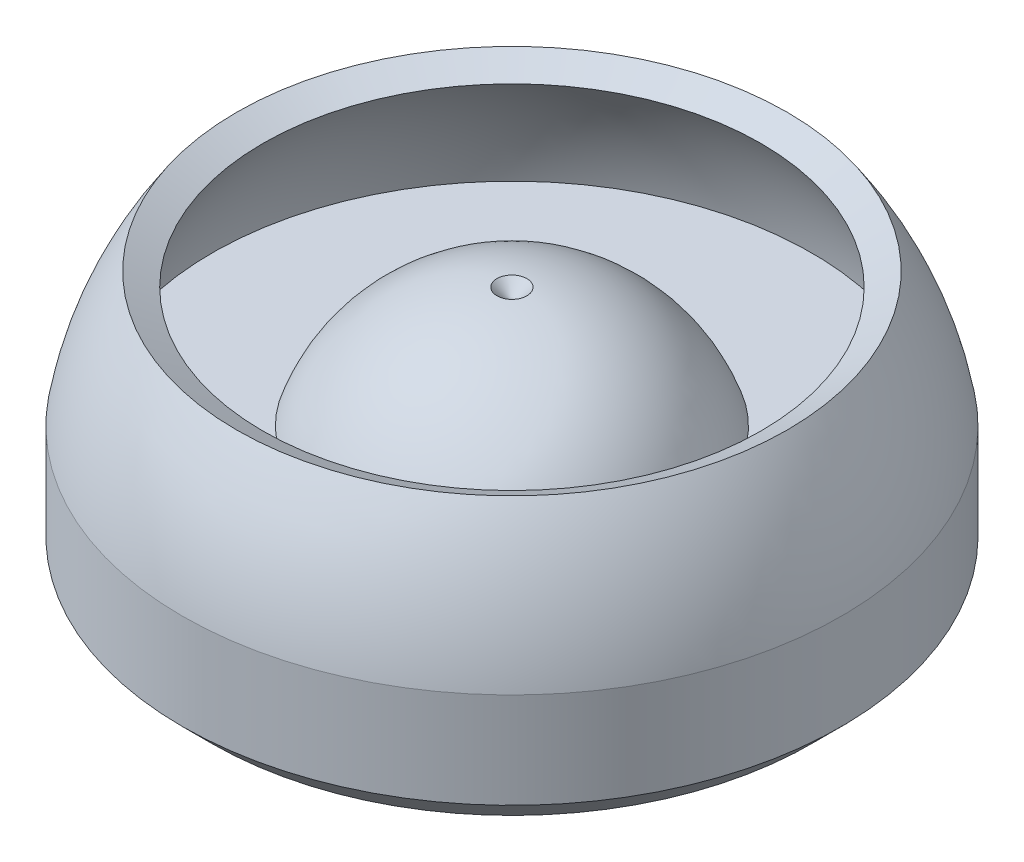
ISO-10303-21;
HEADER;
FILE_DESCRIPTION(('STEP AP214'),'2;1');
FILE_NAME('part.step','',(''),(''),'','','');
FILE_SCHEMA(('AUTOMOTIVE_DESIGN { 1 0 10303 214 1 1 1 1 }'));
ENDSEC;
DATA;
#1=APPLICATION_CONTEXT('core data for automotive mechanical design processes');
#2=APPLICATION_PROTOCOL_DEFINITION('international standard','automotive_design',2000,#1);
#3=PRODUCT_CONTEXT('',#1,'mechanical');
#4=PRODUCT('Part','Part','',(#3));
#5=PRODUCT_RELATED_PRODUCT_CATEGORY('part','',(#4));
#6=PRODUCT_DEFINITION_FORMATION('','',#4);
#7=PRODUCT_DEFINITION_CONTEXT('part definition',#1,'design');
#8=PRODUCT_DEFINITION('design','',#6,#7);
#9=PRODUCT_DEFINITION_SHAPE('','',#8);
#10=(LENGTH_UNIT() NAMED_UNIT(*) SI_UNIT(.MILLI.,.METRE.));
#11=(NAMED_UNIT(*) PLANE_ANGLE_UNIT() SI_UNIT($,.RADIAN.));
#12=(NAMED_UNIT(*) SI_UNIT($,.STERADIAN.) SOLID_ANGLE_UNIT());
#13=UNCERTAINTY_MEASURE_WITH_UNIT(LENGTH_MEASURE(1.E-05),#10,'distance_accuracy_value','');
#14=(GEOMETRIC_REPRESENTATION_CONTEXT(3) GLOBAL_UNCERTAINTY_ASSIGNED_CONTEXT((#13)) GLOBAL_UNIT_ASSIGNED_CONTEXT((#10,
#11,#12)) REPRESENTATION_CONTEXT('',''));
#15=CARTESIAN_POINT('',(0.,0.,0.));
#16=DIRECTION('',(0.,0.,1.));
#17=DIRECTION('',(1.,0.,0.));
#18=AXIS2_PLACEMENT_3D('',#15,#16,#17);
#19=CARTESIAN_POINT('',(0.,1.778,0.));
#20=DIRECTION('',(0.,-1.,0.));
#21=DIRECTION('',(1.,0.,0.));
#22=AXIS2_PLACEMENT_3D('',#19,#20,#21);
#23=CYLINDRICAL_SURFACE('',#22,6.35);
#24=CARTESIAN_POINT('',(3.597275,-0.282575,5.23279204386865));
#25=CARTESIAN_POINT('',(3.45368671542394,-0.426163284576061,5.33150159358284));
#26=CARTESIAN_POINT('',(3.30615936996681,-0.573690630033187,5.42422080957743));
#27=CARTESIAN_POINT('',(3.15494272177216,-0.724907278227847,5.51079272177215));
#28=(BOUNDED_CURVE() B_SPLINE_CURVE(3,(#24,#25,#26,#27),.UNSPECIFIED.,.F.,
.F.) B_SPLINE_CURVE_WITH_KNOTS((4,4),(4.11013661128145,4.19243364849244),
.UNSPECIFIED.) CURVE() GEOMETRIC_REPRESENTATION_ITEM() RATIONAL_B_SPLINE_CURVE((1.,
0.999435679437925,0.999435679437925,1.)) REPRESENTATION_ITEM(''));
#29=CARTESIAN_POINT('',(3.597275,-0.282575,5.23279204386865));
#30=VERTEX_POINT('',#29);
#31=CARTESIAN_POINT('',(3.15494272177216,-0.724907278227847,5.51079272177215));
#32=VERTEX_POINT('',#31);
#33=EDGE_CURVE('E1498',#30,#32,#28,.T.);
#34=ORIENTED_EDGE('',*,*,#33,.F.);
#35=CARTESIAN_POINT('',(0.,-0.282575,0.));
#36=DIRECTION('',(0.,-1.,0.));
#37=DIRECTION('',(1.,0.,0.));
#38=AXIS2_PLACEMENT_3D('',#35,#36,#37);
#39=CIRCLE('',#38,6.35);
#40=CARTESIAN_POINT('',(5.25447727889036,-0.282575,3.565525));
#41=VERTEX_POINT('',#40);
#42=EDGE_CURVE('E1068',#41,#30,#39,.T.);
#43=ORIENTED_EDGE('',*,*,#42,.F.);
#44=CARTESIAN_POINT('',(5.25447727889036,-0.282575,3.565525));
#45=CARTESIAN_POINT('',(5.35383838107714,-0.429002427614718,3.41909757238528));
#46=CARTESIAN_POINT('',(5.44699552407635,-0.579452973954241,3.26864702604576));
#47=CARTESIAN_POINT('',(5.53378605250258,-0.733663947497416,3.11443605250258));
#48=(BOUNDED_CURVE() B_SPLINE_CURVE(3,(#44,#45,#46,#47),.UNSPECIFIED.,.F.,
.F.) B_SPLINE_CURVE_WITH_KNOTS((4,4),(4.11619155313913,4.1997687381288),
.UNSPECIFIED.) CURVE() GEOMETRIC_REPRESENTATION_ITEM() RATIONAL_B_SPLINE_CURVE((1.,
0.999417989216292,0.999417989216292,1.)) REPRESENTATION_ITEM(''));
#49=CARTESIAN_POINT('',(5.53378605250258,-0.733663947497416,3.11443605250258));
#50=VERTEX_POINT('',#49);
#51=EDGE_CURVE('E1707',#41,#50,#48,.T.);
#52=ORIENTED_EDGE('',*,*,#51,.T.);
#53=CARTESIAN_POINT('',(5.984875,-0.282575,2.1222090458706));
#54=CARTESIAN_POINT('',(5.86315269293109,-0.404297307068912,2.46548003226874));
#55=CARTESIAN_POINT('',(5.71241894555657,-0.555031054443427,2.79703791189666));
#56=CARTESIAN_POINT('',(5.53378605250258,-0.733663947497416,3.11443605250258));
#57=(BOUNDED_CURVE() B_SPLINE_CURVE(3,(#53,#54,#55,#56),.UNSPECIFIED.,.F.,
.F.) B_SPLINE_CURVE_WITH_KNOTS((4,4),(3.48235547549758,3.65421289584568),
.UNSPECIFIED.) CURVE() GEOMETRIC_REPRESENTATION_ITEM() RATIONAL_B_SPLINE_CURVE((1.,
0.997540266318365,0.997540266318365,1.)) REPRESENTATION_ITEM(''));
#58=CARTESIAN_POINT('',(5.984875,-0.282575,2.1222090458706));
#59=VERTEX_POINT('',#58);
#60=EDGE_CURVE('E1488',#59,#50,#57,.T.);
#61=ORIENTED_EDGE('',*,*,#60,.F.);
#62=CARTESIAN_POINT('',(0.,-0.282575,0.));
#63=DIRECTION('',(0.,-1.,0.));
#64=DIRECTION('',(1.,0.,0.));
#65=AXIS2_PLACEMENT_3D('',#62,#63,#64);
#66=CIRCLE('',#65,6.35);
#67=CARTESIAN_POINT('',(5.984875,-0.282575,-2.1222090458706));
#68=VERTEX_POINT('',#67);
#69=EDGE_CURVE('E1448',#68,#59,#66,.T.);
#70=ORIENTED_EDGE('',*,*,#69,.F.);
#71=CARTESIAN_POINT('',(5.52461879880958,-0.742831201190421,-3.13066879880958));
#72=CARTESIAN_POINT('',(5.70725797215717,-0.560192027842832,-2.80836967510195));
#73=CARTESIAN_POINT('',(5.86106806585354,-0.406381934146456,-2.47135892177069));
#74=CARTESIAN_POINT('',(5.984875,-0.282575,-2.1222090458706));
#75=(BOUNDED_CURVE() B_SPLINE_CURVE(3,(#71,#72,#73,#74),.UNSPECIFIED.,.F.,
.F.) B_SPLINE_CURVE_WITH_KNOTS((4,4),(2.62603659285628,2.800829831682),
.UNSPECIFIED.) CURVE() GEOMETRIC_REPRESENTATION_ITEM() RATIONAL_B_SPLINE_CURVE((1.,
0.997455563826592,0.997455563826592,1.)) REPRESENTATION_ITEM(''));
#76=CARTESIAN_POINT('',(5.52461879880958,-0.742831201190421,-3.13066879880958));
#77=VERTEX_POINT('',#76);
#78=EDGE_CURVE('E1484',#77,#68,#75,.T.);
#79=ORIENTED_EDGE('',*,*,#78,.F.);
#80=CARTESIAN_POINT('',(5.52461879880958,-0.742831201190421,-3.13066879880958));
#81=CARTESIAN_POINT('',(5.43538498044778,-0.585362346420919,-3.28813765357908));
#82=CARTESIAN_POINT('',(5.33950422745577,-0.431850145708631,-3.44164985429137));
#83=CARTESIAN_POINT('',(5.23715167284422,-0.282575,-3.590925));
#84=(BOUNDED_CURVE() B_SPLINE_CURVE(3,(#80,#81,#82,#83),.UNSPECIFIED.,.F.,
.F.) B_SPLINE_CURVE_WITH_KNOTS((4,4),(2.08635238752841,2.1718357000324),
.UNSPECIFIED.) CURVE() GEOMETRIC_REPRESENTATION_ITEM() RATIONAL_B_SPLINE_CURVE((1.,
0.999391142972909,0.999391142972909,1.)) REPRESENTATION_ITEM(''));
#85=CARTESIAN_POINT('',(5.23715167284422,-0.282575,-3.590925));
#86=VERTEX_POINT('',#85);
#87=EDGE_CURVE('E994',#77,#86,#84,.T.);
#88=ORIENTED_EDGE('',*,*,#87,.T.);
#89=CARTESIAN_POINT('',(0.,-0.282575,0.));
#90=DIRECTION('',(0.,-1.,0.));
#91=DIRECTION('',(1.,0.,0.));
#92=AXIS2_PLACEMENT_3D('',#89,#90,#91);
#93=CIRCLE('',#92,6.35);
#94=CARTESIAN_POINT('',(3.597275,-0.282575,-5.23279204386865));
#95=VERTEX_POINT('',#94);
#96=EDGE_CURVE('E1009',#95,#86,#93,.T.);
#97=ORIENTED_EDGE('',*,*,#96,.F.);
#98=CARTESIAN_POINT('',(3.13877012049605,-0.74107987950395,-5.52002012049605));
#99=CARTESIAN_POINT('',(3.29564007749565,-0.584209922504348,-5.43082139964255));
#100=CARTESIAN_POINT('',(3.44856759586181,-0.431282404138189,-5.33502072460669));
#101=CARTESIAN_POINT('',(3.597275,-0.282575,-5.23279204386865));
#102=(BOUNDED_CURVE() B_SPLINE_CURVE(3,(#98,#99,#100,#101),.UNSPECIFIED.,.F.,
.F.) B_SPLINE_CURVE_WITH_KNOTS((4,4),(2.08781940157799,2.17304869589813),
.UNSPECIFIED.) CURVE() GEOMETRIC_REPRESENTATION_ITEM() RATIONAL_B_SPLINE_CURVE((1.,
0.999394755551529,0.999394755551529,1.)) REPRESENTATION_ITEM(''));
#103=CARTESIAN_POINT('',(3.13877012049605,-0.74107987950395,-5.52002012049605));
#104=VERTEX_POINT('',#103);
#105=EDGE_CURVE('E1490',#104,#95,#102,.T.);
#106=ORIENTED_EDGE('',*,*,#105,.F.);
#107=CARTESIAN_POINT('',(3.13877012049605,-0.74107987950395,-5.52002012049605));
#108=CARTESIAN_POINT('',(2.8195331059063,-0.559556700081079,-5.70154329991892));
#109=CARTESIAN_POINT('',(2.48578597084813,-0.406338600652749,-5.85476139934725));
#110=CARTESIAN_POINT('',(2.14003243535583,-0.282575,-5.978525));
#111=(BOUNDED_CURVE() B_SPLINE_CURVE(3,(#107,#108,#109,#110),.UNSPECIFIED.,.F.,
.F.) B_SPLINE_CURVE_WITH_KNOTS((4,4),(2.6245695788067,2.79785018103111),
.UNSPECIFIED.) CURVE() GEOMETRIC_REPRESENTATION_ITEM() RATIONAL_B_SPLINE_CURVE((1.,
0.997499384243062,0.997499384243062,1.)) REPRESENTATION_ITEM(''));
#112=CARTESIAN_POINT('',(2.14003243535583,-0.282575,-5.978525));
#113=VERTEX_POINT('',#112);
#114=EDGE_CURVE('E1152',#104,#113,#111,.T.);
#115=ORIENTED_EDGE('',*,*,#114,.T.);
#116=CARTESIAN_POINT('',(0.,-0.282575,0.));
#117=DIRECTION('',(0.,-1.,0.));
#118=DIRECTION('',(1.,0.,0.));
#119=AXIS2_PLACEMENT_3D('',#116,#117,#118);
#120=CIRCLE('',#119,6.35);
#121=CARTESIAN_POINT('',(-2.14003243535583,-0.282575,-5.978525));
#122=VERTEX_POINT('',#121);
#123=EDGE_CURVE('E1168',#122,#113,#120,.T.);
#124=ORIENTED_EDGE('',*,*,#123,.F.);
#125=CARTESIAN_POINT('',(-3.11849800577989,-0.729601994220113,-5.53149800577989));
#126=CARTESIAN_POINT('',(-2.8053864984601,-0.553078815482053,-5.70802118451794));
#127=CARTESIAN_POINT('',(-2.47844799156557,-0.40371194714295,-5.85738805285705));
#128=CARTESIAN_POINT('',(-2.14003243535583,-0.282575,-5.978525));
#129=(BOUNDED_CURVE() B_SPLINE_CURVE(3,(#125,#126,#127,#128),.UNSPECIFIED.,.F.,
.F.) B_SPLINE_CURVE_WITH_KNOTS((4,4),(2.62823823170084,2.79785018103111),
.UNSPECIFIED.) CURVE() GEOMETRIC_REPRESENTATION_ITEM() RATIONAL_B_SPLINE_CURVE((1.,
0.997604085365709,0.997604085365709,1.)) REPRESENTATION_ITEM(''));
#130=CARTESIAN_POINT('',(-3.11849800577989,-0.729601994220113,-5.53149800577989));
#131=VERTEX_POINT('',#130);
#132=EDGE_CURVE('E1500',#131,#122,#129,.T.);
#133=ORIENTED_EDGE('',*,*,#132,.F.);
#134=CARTESIAN_POINT('',(-3.565525,-0.282575,-5.25447727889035));
#135=CARTESIAN_POINT('',(-3.42038459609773,-0.427715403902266,-5.35296504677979));
#136=CARTESIAN_POINT('',(-3.27129034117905,-0.576809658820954,-5.4453581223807));
#137=CARTESIAN_POINT('',(-3.11849800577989,-0.729601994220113,-5.53149800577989));
#138=(BOUNDED_CURVE() B_SPLINE_CURVE(3,(#134,#135,#136,#137),.UNSPECIFIED.,.F.,
.F.) B_SPLINE_CURVE_WITH_KNOTS((4,4),(4.11619155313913,4.19903455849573),
.UNSPECIFIED.) CURVE() GEOMETRIC_REPRESENTATION_ITEM() RATIONAL_B_SPLINE_CURVE((1.,
0.99942816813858,0.99942816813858,1.)) REPRESENTATION_ITEM(''));
#139=CARTESIAN_POINT('',(-3.565525,-0.282575,-5.25447727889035));
#140=VERTEX_POINT('',#139);
#141=EDGE_CURVE('E1510',#140,#131,#138,.T.);
#142=ORIENTED_EDGE('',*,*,#141,.F.);
#143=CARTESIAN_POINT('',(0.,-0.282575,0.));
#144=DIRECTION('',(0.,-1.,0.));
#145=DIRECTION('',(1.,0.,0.));
#146=AXIS2_PLACEMENT_3D('',#143,#144,#145);
#147=CIRCLE('',#146,6.35);
#148=CARTESIAN_POINT('',(-5.23715167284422,-0.282575,-3.590925));
#149=VERTEX_POINT('',#148);
#150=EDGE_CURVE('E1474',#149,#140,#147,.T.);
#151=ORIENTED_EDGE('',*,*,#150,.F.);
#152=CARTESIAN_POINT('',(-5.51310332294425,-0.722596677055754,-3.15090332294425));
#153=CARTESIAN_POINT('',(-5.42714698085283,-0.572199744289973,-3.30130025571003));
#154=CARTESIAN_POINT('',(-5.33511176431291,-0.425443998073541,-3.44805600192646));
#155=CARTESIAN_POINT('',(-5.23715167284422,-0.282575,-3.590925));
#156=(BOUNDED_CURVE() B_SPLINE_CURVE(3,(#152,#153,#154,#155),.UNSPECIFIED.,.F.,
.F.) B_SPLINE_CURVE_WITH_KNOTS((4,4),(2.09001881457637,2.1718357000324),
.UNSPECIFIED.) CURVE() GEOMETRIC_REPRESENTATION_ITEM() RATIONAL_B_SPLINE_CURVE((1.,
0.999442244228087,0.999442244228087,1.)) REPRESENTATION_ITEM(''));
#157=CARTESIAN_POINT('',(-5.51310332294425,-0.722596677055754,-3.15090332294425));
#158=VERTEX_POINT('',#157);
#159=EDGE_CURVE('E1518',#158,#149,#156,.T.);
#160=ORIENTED_EDGE('',*,*,#159,.F.);
#161=CARTESIAN_POINT('',(-5.953125,-0.282575,-2.20970648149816));
#162=CARTESIAN_POINT('',(-5.832339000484,-0.403360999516,-2.53511357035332));
#163=CARTESIAN_POINT('',(-5.68533660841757,-0.550363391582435,-2.8495485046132));
#164=CARTESIAN_POINT('',(-5.51310332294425,-0.722596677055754,-3.15090332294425));
#165=(BOUNDED_CURVE() B_SPLINE_CURVE(3,(#161,#162,#163,#164),.UNSPECIFIED.,.F.,
.F.) B_SPLINE_CURVE_WITH_KNOTS((4,4),(3.49701385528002,3.66081514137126),
.UNSPECIFIED.) CURVE() GEOMETRIC_REPRESENTATION_ITEM() RATIONAL_B_SPLINE_CURVE((1.,
0.997765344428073,0.997765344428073,1.)) REPRESENTATION_ITEM(''));
#166=CARTESIAN_POINT('',(-5.953125,-0.282575,-2.20970648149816));
#167=VERTEX_POINT('',#166);
#168=EDGE_CURVE('E1509',#167,#158,#165,.T.);
#169=ORIENTED_EDGE('',*,*,#168,.F.);
#170=CARTESIAN_POINT('',(0.,-0.282575,0.));
#171=DIRECTION('',(0.,-1.,0.));
#172=DIRECTION('',(1.,0.,0.));
#173=AXIS2_PLACEMENT_3D('',#170,#171,#172);
#174=CIRCLE('',#173,6.35);
#175=CARTESIAN_POINT('',(-5.953125,-0.282575,2.20970648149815));
#176=VERTEX_POINT('',#175);
#177=EDGE_CURVE('E1424',#176,#167,#174,.T.);
#178=ORIENTED_EDGE('',*,*,#177,.F.);
#179=CARTESIAN_POINT('',(-5.52232071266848,-0.713379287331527,3.13472071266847));
#180=CARTESIAN_POINT('',(-5.69059476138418,-0.545105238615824,2.83827858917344));
#181=CARTESIAN_POINT('',(-5.83450637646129,-0.40119362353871,2.52927448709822));
#182=CARTESIAN_POINT('',(-5.953125,-0.282575,2.20970648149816));
#183=(BOUNDED_CURVE() B_SPLINE_CURVE(3,(#179,#180,#181,#182),.UNSPECIFIED.,.F.,
.F.) B_SPLINE_CURVE_WITH_KNOTS((4,4),(2.62530301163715,2.78617145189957),
.UNSPECIFIED.) CURVE() GEOMETRIC_REPRESENTATION_ITEM() RATIONAL_B_SPLINE_CURVE((1.,
0.997844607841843,0.997844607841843,1.)) REPRESENTATION_ITEM(''));
#184=CARTESIAN_POINT('',(-5.52232071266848,-0.713379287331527,3.13472071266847));
#185=VERTEX_POINT('',#184);
#186=EDGE_CURVE('E35',#185,#176,#183,.T.);
#187=ORIENTED_EDGE('',*,*,#186,.F.);
#188=CARTESIAN_POINT('',(-5.25447727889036,-0.282575,3.565525));
#189=CARTESIAN_POINT('',(-5.34947362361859,-0.422570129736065,3.42552987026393));
#190=CARTESIAN_POINT('',(-5.43880229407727,-0.566248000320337,3.28185199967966));
#191=CARTESIAN_POINT('',(-5.52232071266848,-0.713379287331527,3.13472071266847));
#192=(BOUNDED_CURVE() B_SPLINE_CURVE(3,(#188,#189,#190,#191),.UNSPECIFIED.,.F.,
.F.) B_SPLINE_CURVE_WITH_KNOTS((4,4),(4.11619155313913,4.19609933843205),
.UNSPECIFIED.) CURVE() GEOMETRIC_REPRESENTATION_ITEM() RATIONAL_B_SPLINE_CURVE((1.,
0.999467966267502,0.999467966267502,1.)) REPRESENTATION_ITEM(''));
#193=CARTESIAN_POINT('',(-5.25447727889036,-0.282575,3.565525));
#194=VERTEX_POINT('',#193);
#195=EDGE_CURVE('E1483',#194,#185,#192,.T.);
#196=ORIENTED_EDGE('',*,*,#195,.F.);
#197=CARTESIAN_POINT('',(0.,-0.282575,0.));
#198=DIRECTION('',(0.,-1.,0.));
#199=DIRECTION('',(1.,0.,0.));
#200=AXIS2_PLACEMENT_3D('',#197,#198,#199);
#201=CIRCLE('',#200,6.35);
#202=CARTESIAN_POINT('',(-3.565525,-0.282575,5.25447727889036));
#203=VERTEX_POINT('',#202);
#204=EDGE_CURVE('E1364',#203,#194,#201,.T.);
#205=ORIENTED_EDGE('',*,*,#204,.F.);
#206=CARTESIAN_POINT('',(-3.13472071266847,-0.713379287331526,5.52232071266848));
#207=CARTESIAN_POINT('',(-3.28185199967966,-0.566248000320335,5.43880229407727));
#208=CARTESIAN_POINT('',(-3.42552987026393,-0.422570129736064,5.34947362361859));
#209=CARTESIAN_POINT('',(-3.565525,-0.282575,5.25447727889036));
#210=(BOUNDED_CURVE() B_SPLINE_CURVE(3,(#206,#207,#208,#209),.UNSPECIFIED.,.F.,
.F.) B_SPLINE_CURVE_WITH_KNOTS((4,4),(2.08708596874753,2.16699375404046),
.UNSPECIFIED.) CURVE() GEOMETRIC_REPRESENTATION_ITEM() RATIONAL_B_SPLINE_CURVE((1.,
0.999467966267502,0.999467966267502,1.)) REPRESENTATION_ITEM(''));
#211=CARTESIAN_POINT('',(-3.13472071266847,-0.713379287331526,5.52232071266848));
#212=VERTEX_POINT('',#211);
#213=EDGE_CURVE('E1609',#212,#203,#210,.T.);
#214=ORIENTED_EDGE('',*,*,#213,.F.);
#215=CARTESIAN_POINT('',(-2.20970648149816,-0.282575,5.953125));
#216=CARTESIAN_POINT('',(-2.52927448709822,-0.40119362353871,5.83450637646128));
#217=CARTESIAN_POINT('',(-2.83827858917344,-0.545105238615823,5.69059476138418));
#218=CARTESIAN_POINT('',(-3.13472071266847,-0.713379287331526,5.52232071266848));
#219=(BOUNDED_CURVE() B_SPLINE_CURVE(3,(#215,#216,#217,#218),.UNSPECIFIED.,.F.,
.F.) B_SPLINE_CURVE_WITH_KNOTS((4,4),(3.49701385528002,3.65788229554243),
.UNSPECIFIED.) CURVE() GEOMETRIC_REPRESENTATION_ITEM() RATIONAL_B_SPLINE_CURVE((1.,
0.997844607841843,0.997844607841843,1.)) REPRESENTATION_ITEM(''));
#220=CARTESIAN_POINT('',(-2.20970648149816,-0.282575,5.953125));
#221=VERTEX_POINT('',#220);
#222=EDGE_CURVE('E1541',#221,#212,#219,.T.);
#223=ORIENTED_EDGE('',*,*,#222,.F.);
#224=CARTESIAN_POINT('',(0.,-0.282575,0.));
#225=DIRECTION('',(0.,-1.,0.));
#226=DIRECTION('',(1.,0.,0.));
#227=AXIS2_PLACEMENT_3D('',#224,#225,#226);
#228=CIRCLE('',#227,6.35);
#229=CARTESIAN_POINT('',(2.20970648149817,-0.282575,5.953125));
#230=VERTEX_POINT('',#229);
#231=EDGE_CURVE('E1156',#230,#221,#228,.T.);
#232=ORIENTED_EDGE('',*,*,#231,.F.);
#233=CARTESIAN_POINT('',(2.20970648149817,-0.282575,5.953125));
#234=CARTESIAN_POINT('',(2.5365727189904,-0.403902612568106,5.83179738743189));
#235=CARTESIAN_POINT('',(2.85236347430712,-0.551679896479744,5.68402010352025));
#236=CARTESIAN_POINT('',(3.15494272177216,-0.724907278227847,5.51079272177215));
#237=(BOUNDED_CURVE() B_SPLINE_CURVE(3,(#233,#234,#235,#236),.UNSPECIFIED.,.F.,
.F.) B_SPLINE_CURVE_WITH_KNOTS((4,4),(3.49701385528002,3.66154798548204),
.UNSPECIFIED.) CURVE() GEOMETRIC_REPRESENTATION_ITEM() RATIONAL_B_SPLINE_CURVE((1.,
0.997745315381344,0.997745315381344,1.)) REPRESENTATION_ITEM(''));
#238=EDGE_CURVE('E26',#230,#32,#237,.T.);
#239=ORIENTED_EDGE('',*,*,#238,.T.);
#240=EDGE_LOOP('',(#34,#43,#52,#61,#70,#79,#88,#97,#106,#115,#124,#133,#142,#151,#160,#169,#178,
#187,#196,#205,#214,#223,#232,#239));
#241=FACE_BOUND('',#240,.T.);
#242=CARTESIAN_POINT('',(0.,0.,0.));
#243=DIRECTION('',(0.,-1.,0.));
#244=DIRECTION('',(0.,0.,-1.));
#245=AXIS2_PLACEMENT_3D('',#242,#243,#244);
#246=CIRCLE('',#245,6.35);
#247=CARTESIAN_POINT('',(0.,0.,-6.35));
#248=VERTEX_POINT('',#247);
#249=EDGE_CURVE('E1993',#248,#248,#246,.T.);
#250=ORIENTED_EDGE('',*,*,#249,.T.);
#251=EDGE_LOOP('',(#250));
#252=FACE_BOUND('',#251,.T.);
#253=ADVANCED_FACE('F15',(#241,#252),#23,.T.);
#254=CARTESIAN_POINT('',(6.351025,-0.282575,1.184275));
#255=DIRECTION('',(0.,0.707106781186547,0.707106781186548));
#256=DIRECTION('',(0.,-0.707106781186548,0.707106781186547));
#257=AXIS2_PLACEMENT_3D('',#254,#255,#256);
#258=PLANE('',#257);
#259=DIRECTION('',(-1.,0.,0.));
#260=VECTOR('',#259,1.);
#261=CARTESIAN_POINT('',(6.351025,-0.282575,1.184275));
#262=LINE('',#261,#260);
#263=CARTESIAN_POINT('',(5.984875,-0.282575,1.184275));
#264=VERTEX_POINT('',#263);
#265=CARTESIAN_POINT('',(3.597275,-0.282575,1.184275));
#266=VERTEX_POINT('',#265);
#267=EDGE_CURVE('E1014',#264,#266,#262,.T.);
#268=ORIENTED_EDGE('',*,*,#267,.F.);
#269=DIRECTION('',(-0.577350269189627,-0.577350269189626,0.577350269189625));
#270=VECTOR('',#269,1.);
#271=CARTESIAN_POINT('',(6.106925,-0.160525,1.062225));
#272=LINE('',#271,#270);
#273=CARTESIAN_POINT('',(4.87045,-1.397,2.2987));
#274=VERTEX_POINT('',#273);
#275=EDGE_CURVE('E1722',#264,#274,#272,.T.);
#276=ORIENTED_EDGE('',*,*,#275,.T.);
#277=DIRECTION('',(-1.,0.,0.));
#278=VECTOR('',#277,1.);
#279=CARTESIAN_POINT('',(6.351025,-1.397,2.2987));
#280=LINE('',#279,#278);
#281=CARTESIAN_POINT('',(4.7117,-1.397,2.2987));
#282=VERTEX_POINT('',#281);
#283=EDGE_CURVE('E1736',#274,#282,#280,.T.);
#284=ORIENTED_EDGE('',*,*,#283,.T.);
#285=DIRECTION('',(-0.577350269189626,0.577350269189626,-0.577350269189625));
#286=VECTOR('',#285,1.);
#287=CARTESIAN_POINT('',(4.51519166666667,-1.20049166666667,2.10219166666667));
#288=LINE('',#287,#286);
#289=EDGE_CURVE('E1739',#282,#266,#288,.T.);
#290=ORIENTED_EDGE('',*,*,#289,.T.);
#291=EDGE_LOOP('',(#268,#276,#284,#290));
#292=FACE_BOUND('',#291,.T.);
#293=ADVANCED_FACE('F524',(#292),#258,.F.);
#294=CARTESIAN_POINT('',(6.351025,-0.282575,1.177925));
#295=DIRECTION('',(0.,0.707106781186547,-0.707106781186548));
#296=DIRECTION('',(0.,0.707106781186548,0.707106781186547));
#297=AXIS2_PLACEMENT_3D('',#294,#295,#296);
#298=PLANE('',#297);
#299=DIRECTION('',(-1.,0.,0.));
#300=VECTOR('',#299,1.);
#301=CARTESIAN_POINT('',(6.351025,-1.397,0.0634999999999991));
#302=LINE('',#301,#300);
#303=CARTESIAN_POINT('',(4.87045,-1.397,0.0634999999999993));
#304=VERTEX_POINT('',#303);
#305=CARTESIAN_POINT('',(4.7117,-1.397,0.0635));
#306=VERTEX_POINT('',#305);
#307=EDGE_CURVE('E1743',#304,#306,#302,.T.);
#308=ORIENTED_EDGE('',*,*,#307,.F.);
#309=DIRECTION('',(0.577350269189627,0.577350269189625,0.577350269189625));
#310=VECTOR('',#309,1.);
#311=CARTESIAN_POINT('',(6.106925,-0.160525,1.299975));
#312=LINE('',#311,#310);
#313=CARTESIAN_POINT('',(5.984875,-0.282575,1.177925));
#314=VERTEX_POINT('',#313);
#315=EDGE_CURVE('E1742',#304,#314,#312,.T.);
#316=ORIENTED_EDGE('',*,*,#315,.T.);
#317=DIRECTION('',(-1.,0.,0.));
#318=VECTOR('',#317,1.);
#319=CARTESIAN_POINT('',(6.351025,-0.282575,1.177925));
#320=LINE('',#319,#318);
#321=CARTESIAN_POINT('',(3.597275,-0.282575,1.177925));
#322=VERTEX_POINT('',#321);
#323=EDGE_CURVE('E1748',#314,#322,#320,.T.);
#324=ORIENTED_EDGE('',*,*,#323,.T.);
#325=DIRECTION('',(0.577350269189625,-0.577350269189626,-0.577350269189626));
#326=VECTOR('',#325,1.);
#327=CARTESIAN_POINT('',(4.51519166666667,-1.20049166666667,0.260008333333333));
#328=LINE('',#327,#326);
#329=EDGE_CURVE('E1751',#322,#306,#328,.T.);
#330=ORIENTED_EDGE('',*,*,#329,.T.);
#331=EDGE_LOOP('',(#308,#316,#324,#330));
#332=FACE_BOUND('',#331,.T.);
#333=ADVANCED_FACE('F530',(#332),#298,.F.);
#334=CARTESIAN_POINT('',(6.351025,-0.282575,-1.203325));
#335=DIRECTION('',(0.,0.707106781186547,0.707106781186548));
#336=DIRECTION('',(0.,-0.707106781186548,0.707106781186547));
#337=AXIS2_PLACEMENT_3D('',#334,#335,#336);
#338=PLANE('',#337);
#339=DIRECTION('',(-1.,0.,0.));
#340=VECTOR('',#339,1.);
#341=CARTESIAN_POINT('',(6.351025,-0.282575,-1.203325));
#342=LINE('',#341,#340);
#343=CARTESIAN_POINT('',(5.984875,-0.282575,-1.203325));
#344=VERTEX_POINT('',#343);
#345=CARTESIAN_POINT('',(3.597275,-0.282575,-1.203325));
#346=VERTEX_POINT('',#345);
#347=EDGE_CURVE('E1041',#344,#346,#342,.T.);
#348=ORIENTED_EDGE('',*,*,#347,.F.);
#349=DIRECTION('',(-0.577350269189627,-0.577350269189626,0.577350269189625));
#350=VECTOR('',#349,1.);
#351=CARTESIAN_POINT('',(6.106925,-0.160525,-1.325375));
#352=LINE('',#351,#350);
#353=CARTESIAN_POINT('',(4.87045,-1.397,-0.0889000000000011));
#354=VERTEX_POINT('',#353);
#355=EDGE_CURVE('E1754',#344,#354,#352,.T.);
#356=ORIENTED_EDGE('',*,*,#355,.T.);
#357=DIRECTION('',(-1.,0.,0.));
#358=VECTOR('',#357,1.);
#359=CARTESIAN_POINT('',(6.351025,-1.397,-0.0889000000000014));
#360=LINE('',#359,#358);
#361=CARTESIAN_POINT('',(4.7117,-1.397,-0.0889000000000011));
#362=VERTEX_POINT('',#361);
#363=EDGE_CURVE('E1758',#354,#362,#360,.T.);
#364=ORIENTED_EDGE('',*,*,#363,.T.);
#365=DIRECTION('',(-0.577350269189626,0.577350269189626,-0.577350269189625));
#366=VECTOR('',#365,1.);
#367=CARTESIAN_POINT('',(4.51519166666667,-1.20049166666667,-0.285408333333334));
#368=LINE('',#367,#366);
#369=EDGE_CURVE('E1761',#362,#346,#368,.T.);
#370=ORIENTED_EDGE('',*,*,#369,.T.);
#371=EDGE_LOOP('',(#348,#356,#364,#370));
#372=FACE_BOUND('',#371,.T.);
#373=ADVANCED_FACE('F541',(#372),#338,.F.);
#374=CARTESIAN_POINT('',(6.351025,-0.282575,-1.209675));
#375=DIRECTION('',(0.,0.707106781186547,-0.707106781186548));
#376=DIRECTION('',(0.,0.707106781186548,0.707106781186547));
#377=AXIS2_PLACEMENT_3D('',#374,#375,#376);
#378=PLANE('',#377);
#379=DIRECTION('',(-1.,0.,0.));
#380=VECTOR('',#379,1.);
#381=CARTESIAN_POINT('',(6.351025,-1.397,-2.3241));
#382=LINE('',#381,#380);
#383=CARTESIAN_POINT('',(4.87045,-1.397,-2.3241));
#384=VERTEX_POINT('',#383);
#385=CARTESIAN_POINT('',(4.7117,-1.397,-2.3241));
#386=VERTEX_POINT('',#385);
#387=EDGE_CURVE('E988',#384,#386,#382,.T.);
#388=ORIENTED_EDGE('',*,*,#387,.F.);
#389=DIRECTION('',(0.577350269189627,0.577350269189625,0.577350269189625));
#390=VECTOR('',#389,1.);
#391=CARTESIAN_POINT('',(6.106925,-0.160525,-1.087625));
#392=LINE('',#391,#390);
#393=CARTESIAN_POINT('',(5.984875,-0.282575,-1.209675));
#394=VERTEX_POINT('',#393);
#395=EDGE_CURVE('E986',#384,#394,#392,.T.);
#396=ORIENTED_EDGE('',*,*,#395,.T.);
#397=DIRECTION('',(-1.,0.,0.));
#398=VECTOR('',#397,1.);
#399=CARTESIAN_POINT('',(6.351025,-0.282575,-1.209675));
#400=LINE('',#399,#398);
#401=CARTESIAN_POINT('',(3.597275,-0.282575,-1.209675));
#402=VERTEX_POINT('',#401);
#403=EDGE_CURVE('E1766',#394,#402,#400,.T.);
#404=ORIENTED_EDGE('',*,*,#403,.T.);
#405=DIRECTION('',(0.577350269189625,-0.577350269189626,-0.577350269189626));
#406=VECTOR('',#405,1.);
#407=CARTESIAN_POINT('',(4.51519166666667,-1.20049166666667,-2.12759166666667));
#408=LINE('',#407,#406);
#409=EDGE_CURVE('E1769',#402,#386,#408,.T.);
#410=ORIENTED_EDGE('',*,*,#409,.T.);
#411=EDGE_LOOP('',(#388,#396,#404,#410));
#412=FACE_BOUND('',#411,.T.);
#413=ADVANCED_FACE('F545',(#412),#378,.F.);
#414=CARTESIAN_POINT('',(6.351025,-0.282575,3.565525));
#415=DIRECTION('',(0.,0.707106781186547,-0.707106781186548));
#416=DIRECTION('',(0.,0.707106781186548,0.707106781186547));
#417=AXIS2_PLACEMENT_3D('',#414,#415,#416);
#418=PLANE('',#417);
#419=DIRECTION('',(-1.,0.,0.));
#420=VECTOR('',#419,1.);
#421=CARTESIAN_POINT('',(6.351025,-1.397,2.4511));
#422=LINE('',#421,#420);
#423=CARTESIAN_POINT('',(4.87045,-1.397,2.4511));
#424=VERTEX_POINT('',#423);
#425=CARTESIAN_POINT('',(4.7117,-1.397,2.4511));
#426=VERTEX_POINT('',#425);
#427=EDGE_CURVE('E1773',#424,#426,#422,.T.);
#428=ORIENTED_EDGE('',*,*,#427,.F.);
#429=DIRECTION('',(0.577350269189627,0.577350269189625,0.577350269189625));
#430=VECTOR('',#429,1.);
#431=CARTESIAN_POINT('',(6.106925,-0.160525,3.687575));
#432=LINE('',#431,#430);
#433=EDGE_CURVE('E1772',#424,#50,#432,.T.);
#434=ORIENTED_EDGE('',*,*,#433,.T.);
#435=ORIENTED_EDGE('',*,*,#51,.F.);
#436=DIRECTION('',(-1.,0.,0.));
#437=VECTOR('',#436,1.);
#438=CARTESIAN_POINT('',(6.351025,-0.282575,3.565525));
#439=LINE('',#438,#437);
#440=CARTESIAN_POINT('',(3.597275,-0.282575,3.565525));
#441=VERTEX_POINT('',#440);
#442=EDGE_CURVE('E1779',#41,#441,#439,.T.);
#443=ORIENTED_EDGE('',*,*,#442,.T.);
#444=DIRECTION('',(0.577350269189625,-0.577350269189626,-0.577350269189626));
#445=VECTOR('',#444,1.);
#446=CARTESIAN_POINT('',(4.51519166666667,-1.20049166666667,2.64760833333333));
#447=LINE('',#446,#445);
#448=EDGE_CURVE('E1782',#441,#426,#447,.T.);
#449=ORIENTED_EDGE('',*,*,#448,.T.);
#450=EDGE_LOOP('',(#428,#434,#435,#443,#449));
#451=FACE_BOUND('',#450,.T.);
#452=ADVANCED_FACE('F549',(#451),#418,.F.);
#453=CARTESIAN_POINT('',(6.351025,-1.397,2.4511));
#454=DIRECTION('',(0.,1.,0.));
#455=DIRECTION('',(-1.,0.,0.));
#456=AXIS2_PLACEMENT_3D('',#453,#454,#455);
#457=PLANE('',#456);
#458=ORIENTED_EDGE('',*,*,#283,.F.);
#459=DIRECTION('',(0.,0.,1.));
#460=VECTOR('',#459,1.);
#461=CARTESIAN_POINT('',(4.87045,-1.397,2.4511));
#462=LINE('',#461,#460);
#463=EDGE_CURVE('E1775',#274,#424,#462,.T.);
#464=ORIENTED_EDGE('',*,*,#463,.T.);
#465=ORIENTED_EDGE('',*,*,#427,.T.);
#466=DIRECTION('',(0.,0.,-1.));
#467=VECTOR('',#466,1.);
#468=CARTESIAN_POINT('',(4.7117,-1.397,2.4511));
#469=LINE('',#468,#467);
#470=EDGE_CURVE('E1776',#426,#282,#469,.T.);
#471=ORIENTED_EDGE('',*,*,#470,.T.);
#472=EDGE_LOOP('',(#458,#464,#465,#471));
#473=FACE_BOUND('',#472,.T.);
#474=ADVANCED_FACE('F553',(#473),#457,.F.);
#475=CARTESIAN_POINT('',(6.351025,-1.397,0.0634999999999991));
#476=DIRECTION('',(0.,1.,0.));
#477=DIRECTION('',(-1.,0.,0.));
#478=AXIS2_PLACEMENT_3D('',#475,#476,#477);
#479=PLANE('',#478);
#480=ORIENTED_EDGE('',*,*,#363,.F.);
#481=DIRECTION('',(0.,0.,1.));
#482=VECTOR('',#481,1.);
#483=CARTESIAN_POINT('',(4.87045,-1.397,0.0634999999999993));
#484=LINE('',#483,#482);
#485=EDGE_CURVE('E1745',#354,#304,#484,.T.);
#486=ORIENTED_EDGE('',*,*,#485,.T.);
#487=ORIENTED_EDGE('',*,*,#307,.T.);
#488=DIRECTION('',(0.,0.,-1.));
#489=VECTOR('',#488,1.);
#490=CARTESIAN_POINT('',(4.7117,-1.397,0.0635));
#491=LINE('',#490,#489);
#492=EDGE_CURVE('E987',#306,#362,#491,.T.);
#493=ORIENTED_EDGE('',*,*,#492,.T.);
#494=EDGE_LOOP('',(#480,#486,#487,#493));
#495=FACE_BOUND('',#494,.T.);
#496=ADVANCED_FACE('F557',(#495),#479,.F.);
#497=CARTESIAN_POINT('',(6.351025,-1.397,-2.3241));
#498=DIRECTION('',(0.,1.,0.));
#499=DIRECTION('',(-1.,0.,0.));
#500=AXIS2_PLACEMENT_3D('',#497,#498,#499);
#501=PLANE('',#500);
#502=DIRECTION('',(-1.,0.,0.));
#503=VECTOR('',#502,1.);
#504=CARTESIAN_POINT('',(6.351025,-1.397,-2.4765));
#505=LINE('',#504,#503);
#506=CARTESIAN_POINT('',(4.87045,-1.397,-2.4765));
#507=VERTEX_POINT('',#506);
#508=CARTESIAN_POINT('',(4.7117,-1.397,-2.4765));
#509=VERTEX_POINT('',#508);
#510=EDGE_CURVE('E991',#507,#509,#505,.T.);
#511=ORIENTED_EDGE('',*,*,#510,.F.);
#512=DIRECTION('',(0.,0.,1.));
#513=VECTOR('',#512,1.);
#514=CARTESIAN_POINT('',(4.87045,-1.397,-2.3241));
#515=LINE('',#514,#513);
#516=EDGE_CURVE('E979',#507,#384,#515,.T.);
#517=ORIENTED_EDGE('',*,*,#516,.T.);
#518=ORIENTED_EDGE('',*,*,#387,.T.);
#519=DIRECTION('',(0.,0.,-1.));
#520=VECTOR('',#519,1.);
#521=CARTESIAN_POINT('',(4.7117,-1.397,-2.3241));
#522=LINE('',#521,#520);
#523=EDGE_CURVE('E995',#386,#509,#522,.T.);
#524=ORIENTED_EDGE('',*,*,#523,.T.);
#525=EDGE_LOOP('',(#511,#517,#518,#524));
#526=FACE_BOUND('',#525,.T.);
#527=ADVANCED_FACE('F561',(#526),#501,.F.);
#528=CARTESIAN_POINT('',(6.351025,-0.282575,-3.590925));
#529=DIRECTION('',(0.,0.707106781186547,0.707106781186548));
#530=DIRECTION('',(0.,-0.707106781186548,0.707106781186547));
#531=AXIS2_PLACEMENT_3D('',#528,#529,#530);
#532=PLANE('',#531);
#533=ORIENTED_EDGE('',*,*,#87,.F.);
#534=DIRECTION('',(-0.577350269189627,-0.577350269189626,0.577350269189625));
#535=VECTOR('',#534,1.);
#536=CARTESIAN_POINT('',(6.106925,-0.160525,-3.712975));
#537=LINE('',#536,#535);
#538=EDGE_CURVE('E982',#77,#507,#537,.T.);
#539=ORIENTED_EDGE('',*,*,#538,.T.);
#540=ORIENTED_EDGE('',*,*,#510,.T.);
#541=DIRECTION('',(-0.577350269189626,0.577350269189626,-0.577350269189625));
#542=VECTOR('',#541,1.);
#543=CARTESIAN_POINT('',(4.51519166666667,-1.20049166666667,-2.67300833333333));
#544=LINE('',#543,#542);
#545=CARTESIAN_POINT('',(3.597275,-0.282575,-3.590925));
#546=VERTEX_POINT('',#545);
#547=EDGE_CURVE('E998',#509,#546,#544,.T.);
#548=ORIENTED_EDGE('',*,*,#547,.T.);
#549=DIRECTION('',(-1.,0.,0.));
#550=VECTOR('',#549,1.);
#551=CARTESIAN_POINT('',(6.351025,-0.282575,-3.590925));
#552=LINE('',#551,#550);
#553=EDGE_CURVE('E1006',#86,#546,#552,.T.);
#554=ORIENTED_EDGE('',*,*,#553,.F.);
#555=EDGE_LOOP('',(#533,#539,#540,#548,#554));
#556=FACE_BOUND('',#555,.T.);
#557=ADVANCED_FACE('F565',(#556),#532,.F.);
#558=CARTESIAN_POINT('',(6.351025,-0.282575,1.184275));
#559=DIRECTION('',(0.,0.707106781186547,0.707106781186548));
#560=DIRECTION('',(0.,-0.707106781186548,0.707106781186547));
#561=AXIS2_PLACEMENT_3D('',#558,#559,#560);
#562=PLANE('',#561);
#563=DIRECTION('',(-1.,0.,0.));
#564=VECTOR('',#563,1.);
#565=CARTESIAN_POINT('',(6.351025,-0.282575,1.184275));
#566=LINE('',#565,#564);
#567=CARTESIAN_POINT('',(1.209675,-0.282575,1.184275));
#568=VERTEX_POINT('',#567);
#569=EDGE_CURVE('E1011',#266,#568,#566,.T.);
#570=ORIENTED_EDGE('',*,*,#569,.F.);
#571=DIRECTION('',(-0.577350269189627,-0.577350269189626,0.577350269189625));
#572=VECTOR('',#571,1.);
#573=CARTESIAN_POINT('',(4.51519166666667,0.635341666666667,0.266358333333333));
#574=LINE('',#573,#572);
#575=CARTESIAN_POINT('',(2.48285,-1.397,2.2987));
#576=VERTEX_POINT('',#575);
#577=EDGE_CURVE('E1005',#266,#576,#574,.T.);
#578=ORIENTED_EDGE('',*,*,#577,.T.);
#579=DIRECTION('',(-1.,0.,0.));
#580=VECTOR('',#579,1.);
#581=CARTESIAN_POINT('',(6.351025,-1.397,2.2987));
#582=LINE('',#581,#580);
#583=CARTESIAN_POINT('',(2.3241,-1.397,2.2987));
#584=VERTEX_POINT('',#583);
#585=EDGE_CURVE('E1018',#576,#584,#582,.T.);
#586=ORIENTED_EDGE('',*,*,#585,.T.);
#587=DIRECTION('',(-0.577350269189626,0.577350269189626,-0.577350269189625));
#588=VECTOR('',#587,1.);
#589=CARTESIAN_POINT('',(2.92345833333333,-1.99635833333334,2.89805833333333));
#590=LINE('',#589,#588);
#591=EDGE_CURVE('E1021',#584,#568,#590,.T.);
#592=ORIENTED_EDGE('',*,*,#591,.T.);
#593=EDGE_LOOP('',(#570,#578,#586,#592));
#594=FACE_BOUND('',#593,.T.);
#595=ADVANCED_FACE('F569',(#594),#562,.F.);
#596=CARTESIAN_POINT('',(6.351025,-0.282575,1.177925));
#597=DIRECTION('',(0.,0.707106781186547,-0.707106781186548));
#598=DIRECTION('',(0.,0.707106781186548,0.707106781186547));
#599=AXIS2_PLACEMENT_3D('',#596,#597,#598);
#600=PLANE('',#599);
#601=DIRECTION('',(-1.,0.,0.));
#602=VECTOR('',#601,1.);
#603=CARTESIAN_POINT('',(6.351025,-1.397,0.0634999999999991));
#604=LINE('',#603,#602);
#605=CARTESIAN_POINT('',(2.48285,-1.397,0.0635));
#606=VERTEX_POINT('',#605);
#607=CARTESIAN_POINT('',(2.3241,-1.397,0.0635));
#608=VERTEX_POINT('',#607);
#609=EDGE_CURVE('E1025',#606,#608,#604,.T.);
#610=ORIENTED_EDGE('',*,*,#609,.F.);
#611=DIRECTION('',(0.577350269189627,0.577350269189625,0.577350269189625));
#612=VECTOR('',#611,1.);
#613=CARTESIAN_POINT('',(4.51519166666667,0.635341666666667,2.09584166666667));
#614=LINE('',#613,#612);
#615=EDGE_CURVE('E1024',#606,#322,#614,.T.);
#616=ORIENTED_EDGE('',*,*,#615,.T.);
#617=DIRECTION('',(-1.,0.,0.));
#618=VECTOR('',#617,1.);
#619=CARTESIAN_POINT('',(6.351025,-0.282575,1.177925));
#620=LINE('',#619,#618);
#621=CARTESIAN_POINT('',(1.209675,-0.282575,1.177925));
#622=VERTEX_POINT('',#621);
#623=EDGE_CURVE('E1031',#322,#622,#620,.T.);
#624=ORIENTED_EDGE('',*,*,#623,.T.);
#625=DIRECTION('',(0.577350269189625,-0.577350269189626,-0.577350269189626));
#626=VECTOR('',#625,1.);
#627=CARTESIAN_POINT('',(2.92345833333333,-1.99635833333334,-0.535858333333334));
#628=LINE('',#627,#626);
#629=EDGE_CURVE('E1034',#622,#608,#628,.T.);
#630=ORIENTED_EDGE('',*,*,#629,.T.);
#631=EDGE_LOOP('',(#610,#616,#624,#630));
#632=FACE_BOUND('',#631,.T.);
#633=ADVANCED_FACE('F573',(#632),#600,.F.);
#634=CARTESIAN_POINT('',(6.351025,-0.282575,-1.203325));
#635=DIRECTION('',(0.,0.707106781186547,0.707106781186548));
#636=DIRECTION('',(0.,-0.707106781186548,0.707106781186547));
#637=AXIS2_PLACEMENT_3D('',#634,#635,#636);
#638=PLANE('',#637);
#639=DIRECTION('',(-1.,0.,0.));
#640=VECTOR('',#639,1.);
#641=CARTESIAN_POINT('',(6.351025,-0.282575,-1.203325));
#642=LINE('',#641,#640);
#643=CARTESIAN_POINT('',(1.209675,-0.282575,-1.203325));
#644=VERTEX_POINT('',#643);
#645=EDGE_CURVE('E1038',#346,#644,#642,.T.);
#646=ORIENTED_EDGE('',*,*,#645,.F.);
#647=DIRECTION('',(-0.577350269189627,-0.577350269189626,0.577350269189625));
#648=VECTOR('',#647,1.);
#649=CARTESIAN_POINT('',(4.51519166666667,0.635341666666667,-2.12124166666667));
#650=LINE('',#649,#648);
#651=CARTESIAN_POINT('',(2.48285,-1.397,-0.0889));
#652=VERTEX_POINT('',#651);
#653=EDGE_CURVE('E1037',#346,#652,#650,.T.);
#654=ORIENTED_EDGE('',*,*,#653,.T.);
#655=DIRECTION('',(-1.,0.,0.));
#656=VECTOR('',#655,1.);
#657=CARTESIAN_POINT('',(6.351025,-1.397,-0.0889000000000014));
#658=LINE('',#657,#656);
#659=CARTESIAN_POINT('',(2.3241,-1.397,-0.0889));
#660=VERTEX_POINT('',#659);
#661=EDGE_CURVE('E1045',#652,#660,#658,.T.);
#662=ORIENTED_EDGE('',*,*,#661,.T.);
#663=DIRECTION('',(-0.577350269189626,0.577350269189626,-0.577350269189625));
#664=VECTOR('',#663,1.);
#665=CARTESIAN_POINT('',(2.92345833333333,-1.99635833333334,0.510458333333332));
#666=LINE('',#665,#664);
#667=EDGE_CURVE('E1048',#660,#644,#666,.T.);
#668=ORIENTED_EDGE('',*,*,#667,.T.);
#669=EDGE_LOOP('',(#646,#654,#662,#668));
#670=FACE_BOUND('',#669,.T.);
#671=ADVANCED_FACE('F577',(#670),#638,.F.);
#672=CARTESIAN_POINT('',(6.351025,-0.282575,-1.209675));
#673=DIRECTION('',(0.,0.707106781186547,-0.707106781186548));
#674=DIRECTION('',(0.,0.707106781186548,0.707106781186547));
#675=AXIS2_PLACEMENT_3D('',#672,#673,#674);
#676=PLANE('',#675);
#677=DIRECTION('',(-1.,0.,0.));
#678=VECTOR('',#677,1.);
#679=CARTESIAN_POINT('',(6.351025,-1.397,-2.3241));
#680=LINE('',#679,#678);
#681=CARTESIAN_POINT('',(2.48285,-1.397,-2.3241));
#682=VERTEX_POINT('',#681);
#683=CARTESIAN_POINT('',(2.3241,-1.397,-2.3241));
#684=VERTEX_POINT('',#683);
#685=EDGE_CURVE('E1052',#682,#684,#680,.T.);
#686=ORIENTED_EDGE('',*,*,#685,.F.);
#687=DIRECTION('',(0.577350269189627,0.577350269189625,0.577350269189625));
#688=VECTOR('',#687,1.);
#689=CARTESIAN_POINT('',(4.51519166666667,0.635341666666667,-0.291758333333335));
#690=LINE('',#689,#688);
#691=EDGE_CURVE('E1051',#682,#402,#690,.T.);
#692=ORIENTED_EDGE('',*,*,#691,.T.);
#693=DIRECTION('',(-1.,0.,0.));
#694=VECTOR('',#693,1.);
#695=CARTESIAN_POINT('',(6.351025,-0.282575,-1.209675));
#696=LINE('',#695,#694);
#697=CARTESIAN_POINT('',(1.209675,-0.282575,-1.209675));
#698=VERTEX_POINT('',#697);
#699=EDGE_CURVE('E1058',#402,#698,#696,.T.);
#700=ORIENTED_EDGE('',*,*,#699,.T.);
#701=DIRECTION('',(0.577350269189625,-0.577350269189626,-0.577350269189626));
#702=VECTOR('',#701,1.);
#703=CARTESIAN_POINT('',(2.92345833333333,-1.99635833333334,-2.92345833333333));
#704=LINE('',#703,#702);
#705=EDGE_CURVE('E1061',#698,#684,#704,.T.);
#706=ORIENTED_EDGE('',*,*,#705,.T.);
#707=EDGE_LOOP('',(#686,#692,#700,#706));
#708=FACE_BOUND('',#707,.T.);
#709=ADVANCED_FACE('F581',(#708),#676,.F.);
#710=CARTESIAN_POINT('',(6.351,-0.282575,3.571875));
#711=DIRECTION('',(0.,0.707106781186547,0.707106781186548));
#712=DIRECTION('',(0.,-0.707106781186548,0.707106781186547));
#713=AXIS2_PLACEMENT_3D('',#710,#711,#712);
#714=PLANE('',#713);
#715=DIRECTION('',(-1.,0.,0.));
#716=VECTOR('',#715,1.);
#717=CARTESIAN_POINT('',(6.351,-0.282575,3.571875));
#718=LINE('',#717,#716);
#719=CARTESIAN_POINT('',(3.597275,-0.282575,3.571875));
#720=VERTEX_POINT('',#719);
#721=CARTESIAN_POINT('',(1.209675,-0.282575,3.571875));
#722=VERTEX_POINT('',#721);
#723=EDGE_CURVE('E1065',#720,#722,#718,.T.);
#724=ORIENTED_EDGE('',*,*,#723,.F.);
#725=DIRECTION('',(-0.577350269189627,-0.577350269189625,0.577350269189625));
#726=VECTOR('',#725,1.);
#727=CARTESIAN_POINT('',(4.51518333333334,0.635333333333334,2.65396666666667));
#728=LINE('',#727,#726);
#729=CARTESIAN_POINT('',(2.48285,-1.397,4.6863));
#730=VERTEX_POINT('',#729);
#731=EDGE_CURVE('E1064',#720,#730,#728,.T.);
#732=ORIENTED_EDGE('',*,*,#731,.T.);
#733=DIRECTION('',(-1.,0.,0.));
#734=VECTOR('',#733,1.);
#735=CARTESIAN_POINT('',(6.351,-1.397,4.6863));
#736=LINE('',#735,#734);
#737=CARTESIAN_POINT('',(2.3241,-1.397,4.6863));
#738=VERTEX_POINT('',#737);
#739=EDGE_CURVE('E1072',#730,#738,#736,.T.);
#740=ORIENTED_EDGE('',*,*,#739,.T.);
#741=DIRECTION('',(-0.577350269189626,0.577350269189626,-0.577350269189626));
#742=VECTOR('',#741,1.);
#743=CARTESIAN_POINT('',(2.92345,-1.99635,5.28565));
#744=LINE('',#743,#742);
#745=EDGE_CURVE('E1075',#738,#722,#744,.T.);
#746=ORIENTED_EDGE('',*,*,#745,.T.);
#747=EDGE_LOOP('',(#724,#732,#740,#746));
#748=FACE_BOUND('',#747,.T.);
#749=ADVANCED_FACE('F585',(#748),#714,.F.);
#750=CARTESIAN_POINT('',(6.351025,-0.282575,3.565525));
#751=DIRECTION('',(0.,0.707106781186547,-0.707106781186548));
#752=DIRECTION('',(0.,0.707106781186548,0.707106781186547));
#753=AXIS2_PLACEMENT_3D('',#750,#751,#752);
#754=PLANE('',#753);
#755=DIRECTION('',(-1.,0.,0.));
#756=VECTOR('',#755,1.);
#757=CARTESIAN_POINT('',(6.351025,-1.397,2.4511));
#758=LINE('',#757,#756);
#759=CARTESIAN_POINT('',(2.48285,-1.397,2.4511));
#760=VERTEX_POINT('',#759);
#761=CARTESIAN_POINT('',(2.3241,-1.397,2.4511));
#762=VERTEX_POINT('',#761);
#763=EDGE_CURVE('E1079',#760,#762,#758,.T.);
#764=ORIENTED_EDGE('',*,*,#763,.F.);
#765=DIRECTION('',(0.577350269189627,0.577350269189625,0.577350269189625));
#766=VECTOR('',#765,1.);
#767=CARTESIAN_POINT('',(4.51519166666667,0.635341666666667,4.48344166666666));
#768=LINE('',#767,#766);
#769=EDGE_CURVE('E1078',#760,#441,#768,.T.);
#770=ORIENTED_EDGE('',*,*,#769,.T.);
#771=DIRECTION('',(-1.,0.,0.));
#772=VECTOR('',#771,1.);
#773=CARTESIAN_POINT('',(6.351025,-0.282575,3.565525));
#774=LINE('',#773,#772);
#775=CARTESIAN_POINT('',(1.209675,-0.282575,3.565525));
#776=VERTEX_POINT('',#775);
#777=EDGE_CURVE('E1085',#441,#776,#774,.T.);
#778=ORIENTED_EDGE('',*,*,#777,.T.);
#779=DIRECTION('',(0.577350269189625,-0.577350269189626,-0.577350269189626));
#780=VECTOR('',#779,1.);
#781=CARTESIAN_POINT('',(2.92345833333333,-1.99635833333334,1.85174166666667));
#782=LINE('',#781,#780);
#783=EDGE_CURVE('E1088',#776,#762,#782,.T.);
#784=ORIENTED_EDGE('',*,*,#783,.T.);
#785=EDGE_LOOP('',(#764,#770,#778,#784));
#786=FACE_BOUND('',#785,.T.);
#787=ADVANCED_FACE('F589',(#786),#754,.F.);
#788=CARTESIAN_POINT('',(6.351025,-1.397,2.4511));
#789=DIRECTION('',(0.,1.,0.));
#790=DIRECTION('',(-1.,0.,0.));
#791=AXIS2_PLACEMENT_3D('',#788,#789,#790);
#792=PLANE('',#791);
#793=ORIENTED_EDGE('',*,*,#585,.F.);
#794=DIRECTION('',(0.,0.,1.));
#795=VECTOR('',#794,1.);
#796=CARTESIAN_POINT('',(2.48285,-1.397,2.4511));
#797=LINE('',#796,#795);
#798=EDGE_CURVE('E1081',#576,#760,#797,.T.);
#799=ORIENTED_EDGE('',*,*,#798,.T.);
#800=ORIENTED_EDGE('',*,*,#763,.T.);
#801=DIRECTION('',(0.,0.,-1.));
#802=VECTOR('',#801,1.);
#803=CARTESIAN_POINT('',(2.3241,-1.397,2.4511));
#804=LINE('',#803,#802);
#805=EDGE_CURVE('E1082',#762,#584,#804,.T.);
#806=ORIENTED_EDGE('',*,*,#805,.T.);
#807=EDGE_LOOP('',(#793,#799,#800,#806));
#808=FACE_BOUND('',#807,.T.);
#809=ADVANCED_FACE('F593',(#808),#792,.F.);
#810=CARTESIAN_POINT('',(6.351025,-1.397,0.0634999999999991));
#811=DIRECTION('',(0.,1.,0.));
#812=DIRECTION('',(-1.,0.,0.));
#813=AXIS2_PLACEMENT_3D('',#810,#811,#812);
#814=PLANE('',#813);
#815=ORIENTED_EDGE('',*,*,#661,.F.);
#816=DIRECTION('',(0.,0.,1.));
#817=VECTOR('',#816,1.);
#818=CARTESIAN_POINT('',(2.48285,-1.397,0.0635));
#819=LINE('',#818,#817);
#820=EDGE_CURVE('E1027',#652,#606,#819,.T.);
#821=ORIENTED_EDGE('',*,*,#820,.T.);
#822=ORIENTED_EDGE('',*,*,#609,.T.);
#823=DIRECTION('',(0.,0.,-1.));
#824=VECTOR('',#823,1.);
#825=CARTESIAN_POINT('',(2.3241,-1.397,0.0635));
#826=LINE('',#825,#824);
#827=EDGE_CURVE('E1028',#608,#660,#826,.T.);
#828=ORIENTED_EDGE('',*,*,#827,.T.);
#829=EDGE_LOOP('',(#815,#821,#822,#828));
#830=FACE_BOUND('',#829,.T.);
#831=ADVANCED_FACE('F597',(#830),#814,.F.);
#832=CARTESIAN_POINT('',(6.351025,-1.397,-2.3241));
#833=DIRECTION('',(0.,1.,0.));
#834=DIRECTION('',(-1.,0.,0.));
#835=AXIS2_PLACEMENT_3D('',#832,#833,#834);
#836=PLANE('',#835);
#837=DIRECTION('',(-1.,0.,0.));
#838=VECTOR('',#837,1.);
#839=CARTESIAN_POINT('',(6.351025,-1.397,-2.4765));
#840=LINE('',#839,#838);
#841=CARTESIAN_POINT('',(2.48285,-1.397,-2.4765));
#842=VERTEX_POINT('',#841);
#843=CARTESIAN_POINT('',(2.3241,-1.397,-2.4765));
#844=VERTEX_POINT('',#843);
#845=EDGE_CURVE('E1099',#842,#844,#840,.T.);
#846=ORIENTED_EDGE('',*,*,#845,.F.);
#847=DIRECTION('',(0.,0.,1.));
#848=VECTOR('',#847,1.);
#849=CARTESIAN_POINT('',(2.48285,-1.397,-2.3241));
#850=LINE('',#849,#848);
#851=EDGE_CURVE('E1054',#842,#682,#850,.T.);
#852=ORIENTED_EDGE('',*,*,#851,.T.);
#853=ORIENTED_EDGE('',*,*,#685,.T.);
#854=DIRECTION('',(0.,0.,-1.));
#855=VECTOR('',#854,1.);
#856=CARTESIAN_POINT('',(2.3241,-1.397,-2.3241));
#857=LINE('',#856,#855);
#858=EDGE_CURVE('E1055',#684,#844,#857,.T.);
#859=ORIENTED_EDGE('',*,*,#858,.T.);
#860=EDGE_LOOP('',(#846,#852,#853,#859));
#861=FACE_BOUND('',#860,.T.);
#862=ADVANCED_FACE('F601',(#861),#836,.F.);
#863=CARTESIAN_POINT('',(6.351025,-0.282575,-3.590925));
#864=DIRECTION('',(0.,0.707106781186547,0.707106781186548));
#865=DIRECTION('',(0.,-0.707106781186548,0.707106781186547));
#866=AXIS2_PLACEMENT_3D('',#863,#864,#865);
#867=PLANE('',#866);
#868=DIRECTION('',(-1.,0.,0.));
#869=VECTOR('',#868,1.);
#870=CARTESIAN_POINT('',(6.351025,-0.282575,-3.590925));
#871=LINE('',#870,#869);
#872=CARTESIAN_POINT('',(1.209675,-0.282575,-3.590925));
#873=VERTEX_POINT('',#872);
#874=EDGE_CURVE('E1010',#546,#873,#871,.T.);
#875=ORIENTED_EDGE('',*,*,#874,.F.);
#876=DIRECTION('',(-0.577350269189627,-0.577350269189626,0.577350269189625));
#877=VECTOR('',#876,1.);
#878=CARTESIAN_POINT('',(4.51519166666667,0.635341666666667,-4.50884166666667));
#879=LINE('',#878,#877);
#880=EDGE_CURVE('E1101',#546,#842,#879,.T.);
#881=ORIENTED_EDGE('',*,*,#880,.T.);
#882=ORIENTED_EDGE('',*,*,#845,.T.);
#883=DIRECTION('',(-0.577350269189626,0.577350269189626,-0.577350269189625));
#884=VECTOR('',#883,1.);
#885=CARTESIAN_POINT('',(2.92345833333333,-1.99635833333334,-1.87714166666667));
#886=LINE('',#885,#884);
#887=EDGE_CURVE('E1102',#844,#873,#886,.T.);
#888=ORIENTED_EDGE('',*,*,#887,.T.);
#889=EDGE_LOOP('',(#875,#881,#882,#888));
#890=FACE_BOUND('',#889,.T.);
#891=ADVANCED_FACE('F605',(#890),#867,.F.);
#892=CARTESIAN_POINT('',(6.351025,-0.282575,-3.597275));
#893=DIRECTION('',(0.,0.707106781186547,-0.707106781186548));
#894=DIRECTION('',(0.,0.707106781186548,0.707106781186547));
#895=AXIS2_PLACEMENT_3D('',#892,#893,#894);
#896=PLANE('',#895);
#897=DIRECTION('',(-1.,0.,0.));
#898=VECTOR('',#897,1.);
#899=CARTESIAN_POINT('',(6.351025,-1.397,-4.7117));
#900=LINE('',#899,#898);
#901=CARTESIAN_POINT('',(2.48285,-1.397,-4.7117));
#902=VERTEX_POINT('',#901);
#903=CARTESIAN_POINT('',(2.3241,-1.397,-4.7117));
#904=VERTEX_POINT('',#903);
#905=EDGE_CURVE('E1115',#902,#904,#900,.T.);
#906=ORIENTED_EDGE('',*,*,#905,.F.);
#907=DIRECTION('',(0.577350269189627,0.577350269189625,0.577350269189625));
#908=VECTOR('',#907,1.);
#909=CARTESIAN_POINT('',(4.51519166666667,0.635341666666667,-2.67935833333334));
#910=LINE('',#909,#908);
#911=CARTESIAN_POINT('',(3.597275,-0.282575,-3.597275));
#912=VERTEX_POINT('',#911);
#913=EDGE_CURVE('E1114',#902,#912,#910,.T.);
#914=ORIENTED_EDGE('',*,*,#913,.T.);
#915=DIRECTION('',(-1.,0.,0.));
#916=VECTOR('',#915,1.);
#917=CARTESIAN_POINT('',(6.351025,-0.282575,-3.597275));
#918=LINE('',#917,#916);
#919=CARTESIAN_POINT('',(1.209675,-0.282575,-3.597275));
#920=VERTEX_POINT('',#919);
#921=EDGE_CURVE('E1121',#912,#920,#918,.T.);
#922=ORIENTED_EDGE('',*,*,#921,.T.);
#923=DIRECTION('',(0.577350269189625,-0.577350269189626,-0.577350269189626));
#924=VECTOR('',#923,1.);
#925=CARTESIAN_POINT('',(2.92345833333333,-1.99635833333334,-5.31105833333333));
#926=LINE('',#925,#924);
#927=EDGE_CURVE('E1124',#920,#904,#926,.T.);
#928=ORIENTED_EDGE('',*,*,#927,.T.);
#929=EDGE_LOOP('',(#906,#914,#922,#928));
#930=FACE_BOUND('',#929,.T.);
#931=ADVANCED_FACE('F609',(#930),#896,.F.);
#932=CARTESIAN_POINT('',(6.351,-0.282575,5.953125));
#933=DIRECTION('',(0.,0.707106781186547,-0.707106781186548));
#934=DIRECTION('',(0.,0.707106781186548,0.707106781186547));
#935=AXIS2_PLACEMENT_3D('',#932,#933,#934);
#936=PLANE('',#935);
#937=DIRECTION('',(-1.,0.,0.));
#938=VECTOR('',#937,1.);
#939=CARTESIAN_POINT('',(6.351,-1.397,4.8387));
#940=LINE('',#939,#938);
#941=CARTESIAN_POINT('',(2.48285,-1.397,4.8387));
#942=VERTEX_POINT('',#941);
#943=CARTESIAN_POINT('',(2.3241,-1.397,4.8387));
#944=VERTEX_POINT('',#943);
#945=EDGE_CURVE('E1128',#942,#944,#940,.T.);
#946=ORIENTED_EDGE('',*,*,#945,.F.);
#947=DIRECTION('',(0.577350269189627,0.577350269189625,0.577350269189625));
#948=VECTOR('',#947,1.);
#949=CARTESIAN_POINT('',(4.51518333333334,0.635333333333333,6.87103333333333));
#950=LINE('',#949,#948);
#951=EDGE_CURVE('E1127',#942,#32,#950,.T.);
#952=ORIENTED_EDGE('',*,*,#951,.T.);
#953=ORIENTED_EDGE('',*,*,#238,.F.);
#954=DIRECTION('',(-1.,0.,0.));
#955=VECTOR('',#954,1.);
#956=CARTESIAN_POINT('',(6.351,-0.282575,5.953125));
#957=LINE('',#956,#955);
#958=CARTESIAN_POINT('',(1.209675,-0.282575,5.953125));
#959=VERTEX_POINT('',#958);
#960=EDGE_CURVE('E1134',#230,#959,#957,.T.);
#961=ORIENTED_EDGE('',*,*,#960,.T.);
#962=DIRECTION('',(0.577350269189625,-0.577350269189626,-0.577350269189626));
#963=VECTOR('',#962,1.);
#964=CARTESIAN_POINT('',(2.92345,-1.99635,4.23935));
#965=LINE('',#964,#963);
#966=EDGE_CURVE('E1137',#959,#944,#965,.T.);
#967=ORIENTED_EDGE('',*,*,#966,.T.);
#968=EDGE_LOOP('',(#946,#952,#953,#961,#967));
#969=FACE_BOUND('',#968,.T.);
#970=ADVANCED_FACE('F613',(#969),#936,.F.);
#971=CARTESIAN_POINT('',(6.351,-1.397,4.8387));
#972=DIRECTION('',(0.,1.,0.));
#973=DIRECTION('',(-1.,0.,0.));
#974=AXIS2_PLACEMENT_3D('',#971,#972,#973);
#975=PLANE('',#974);
#976=ORIENTED_EDGE('',*,*,#739,.F.);
#977=DIRECTION('',(0.,0.,1.));
#978=VECTOR('',#977,1.);
#979=CARTESIAN_POINT('',(2.48285,-1.397,4.8387));
#980=LINE('',#979,#978);
#981=EDGE_CURVE('E1130',#730,#942,#980,.T.);
#982=ORIENTED_EDGE('',*,*,#981,.T.);
#983=ORIENTED_EDGE('',*,*,#945,.T.);
#984=DIRECTION('',(0.,0.,-1.));
#985=VECTOR('',#984,1.);
#986=CARTESIAN_POINT('',(2.3241,-1.397,4.8387));
#987=LINE('',#986,#985);
#988=EDGE_CURVE('E1131',#944,#738,#987,.T.);
#989=ORIENTED_EDGE('',*,*,#988,.T.);
#990=EDGE_LOOP('',(#976,#982,#983,#989));
#991=FACE_BOUND('',#990,.T.);
#992=ADVANCED_FACE('F617',(#991),#975,.F.);
#993=CARTESIAN_POINT('',(6.351025,-1.397,-4.7117));
#994=DIRECTION('',(0.,1.,0.));
#995=DIRECTION('',(-1.,0.,0.));
#996=AXIS2_PLACEMENT_3D('',#993,#994,#995);
#997=PLANE('',#996);
#998=DIRECTION('',(-1.,0.,0.));
#999=VECTOR('',#998,1.);
#1000=CARTESIAN_POINT('',(6.351025,-1.397,-4.8641));
#1001=LINE('',#1000,#999);
#1002=CARTESIAN_POINT('',(2.48285,-1.397,-4.8641));
#1003=VERTEX_POINT('',#1002);
#1004=CARTESIAN_POINT('',(2.3241,-1.397,-4.8641));
#1005=VERTEX_POINT('',#1004);
#1006=EDGE_CURVE('E1144',#1003,#1005,#1001,.T.);
#1007=ORIENTED_EDGE('',*,*,#1006,.F.);
#1008=DIRECTION('',(0.,0.,1.));
#1009=VECTOR('',#1008,1.);
#1010=CARTESIAN_POINT('',(2.48285,-1.397,-4.7117));
#1011=LINE('',#1010,#1009);
#1012=EDGE_CURVE('E1117',#1003,#902,#1011,.T.);
#1013=ORIENTED_EDGE('',*,*,#1012,.T.);
#1014=ORIENTED_EDGE('',*,*,#905,.T.);
#1015=DIRECTION('',(0.,0.,-1.));
#1016=VECTOR('',#1015,1.);
#1017=CARTESIAN_POINT('',(2.3241,-1.397,-4.7117));
#1018=LINE('',#1017,#1016);
#1019=EDGE_CURVE('E1118',#904,#1005,#1018,.T.);
#1020=ORIENTED_EDGE('',*,*,#1019,.T.);
#1021=EDGE_LOOP('',(#1007,#1013,#1014,#1020));
#1022=FACE_BOUND('',#1021,.T.);
#1023=ADVANCED_FACE('F621',(#1022),#997,.F.);
#1024=CARTESIAN_POINT('',(6.351025,-0.282575,-5.978525));
#1025=DIRECTION('',(0.,0.707106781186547,0.707106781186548));
#1026=DIRECTION('',(0.,-0.707106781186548,0.707106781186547));
#1027=AXIS2_PLACEMENT_3D('',#1024,#1025,#1026);
#1028=PLANE('',#1027);
#1029=ORIENTED_EDGE('',*,*,#114,.F.);
#1030=DIRECTION('',(-0.577350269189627,-0.577350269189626,0.577350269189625));
#1031=VECTOR('',#1030,1.);
#1032=CARTESIAN_POINT('',(4.51519166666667,0.635341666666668,-6.89644166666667));
#1033=LINE('',#1032,#1031);
#1034=EDGE_CURVE('E1146',#104,#1003,#1033,.T.);
#1035=ORIENTED_EDGE('',*,*,#1034,.T.);
#1036=ORIENTED_EDGE('',*,*,#1006,.T.);
#1037=DIRECTION('',(-0.577350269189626,0.577350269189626,-0.577350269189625));
#1038=VECTOR('',#1037,1.);
#1039=CARTESIAN_POINT('',(2.92345833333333,-1.99635833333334,-4.26474166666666));
#1040=LINE('',#1039,#1038);
#1041=CARTESIAN_POINT('',(1.209675,-0.282575,-5.978525));
#1042=VERTEX_POINT('',#1041);
#1043=EDGE_CURVE('E1147',#1005,#1042,#1040,.T.);
#1044=ORIENTED_EDGE('',*,*,#1043,.T.);
#1045=DIRECTION('',(-1.,0.,0.));
#1046=VECTOR('',#1045,1.);
#1047=CARTESIAN_POINT('',(6.351025,-0.282575,-5.978525));
#1048=LINE('',#1047,#1046);
#1049=EDGE_CURVE('E1165',#113,#1042,#1048,.T.);
#1050=ORIENTED_EDGE('',*,*,#1049,.F.);
#1051=EDGE_LOOP('',(#1029,#1035,#1036,#1044,#1050));
#1052=FACE_BOUND('',#1051,.T.);
#1053=ADVANCED_FACE('F625',(#1052),#1028,.F.);
#1054=CARTESIAN_POINT('',(6.351025,-0.282575,1.184275));
#1055=DIRECTION('',(0.,0.707106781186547,0.707106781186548));
#1056=DIRECTION('',(0.,-0.707106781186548,0.707106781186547));
#1057=AXIS2_PLACEMENT_3D('',#1054,#1055,#1056);
#1058=PLANE('',#1057);
#1059=DIRECTION('',(-1.,0.,0.));
#1060=VECTOR('',#1059,1.);
#1061=CARTESIAN_POINT('',(6.351025,-0.282575,1.184275));
#1062=LINE('',#1061,#1060);
#1063=CARTESIAN_POINT('',(-1.177925,-0.282575,1.184275));
#1064=VERTEX_POINT('',#1063);
#1065=EDGE_CURVE('E1015',#568,#1064,#1062,.T.);
#1066=ORIENTED_EDGE('',*,*,#1065,.F.);
#1067=DIRECTION('',(-0.577350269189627,-0.577350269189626,0.577350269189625));
#1068=VECTOR('',#1067,1.);
#1069=CARTESIAN_POINT('',(2.92345833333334,1.43120833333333,-0.529508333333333));
#1070=LINE('',#1069,#1068);
#1071=CARTESIAN_POINT('',(0.0952499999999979,-1.397,2.2987));
#1072=VERTEX_POINT('',#1071);
#1073=EDGE_CURVE('E1164',#568,#1072,#1070,.T.);
#1074=ORIENTED_EDGE('',*,*,#1073,.T.);
#1075=DIRECTION('',(-1.,0.,0.));
#1076=VECTOR('',#1075,1.);
#1077=CARTESIAN_POINT('',(6.351025,-1.397,2.2987));
#1078=LINE('',#1077,#1076);
#1079=CARTESIAN_POINT('',(-0.0635,-1.397,2.2987));
#1080=VERTEX_POINT('',#1079);
#1081=EDGE_CURVE('E1175',#1072,#1080,#1078,.T.);
#1082=ORIENTED_EDGE('',*,*,#1081,.T.);
#1083=DIRECTION('',(-0.577350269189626,0.577350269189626,-0.577350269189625));
#1084=VECTOR('',#1083,1.);
#1085=CARTESIAN_POINT('',(1.331725,-2.792225,3.693925));
#1086=LINE('',#1085,#1084);
#1087=EDGE_CURVE('E1178',#1080,#1064,#1086,.T.);
#1088=ORIENTED_EDGE('',*,*,#1087,.T.);
#1089=EDGE_LOOP('',(#1066,#1074,#1082,#1088));
#1090=FACE_BOUND('',#1089,.T.);
#1091=ADVANCED_FACE('F629',(#1090),#1058,.F.);
#1092=CARTESIAN_POINT('',(6.351025,-0.282575,1.177925));
#1093=DIRECTION('',(0.,0.707106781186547,-0.707106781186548));
#1094=DIRECTION('',(0.,0.707106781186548,0.707106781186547));
#1095=AXIS2_PLACEMENT_3D('',#1092,#1093,#1094);
#1096=PLANE('',#1095);
#1097=DIRECTION('',(-1.,0.,0.));
#1098=VECTOR('',#1097,1.);
#1099=CARTESIAN_POINT('',(6.351025,-1.397,0.0634999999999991));
#1100=LINE('',#1099,#1098);
#1101=CARTESIAN_POINT('',(0.0952499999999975,-1.397,0.0635));
#1102=VERTEX_POINT('',#1101);
#1103=CARTESIAN_POINT('',(-0.0635000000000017,-1.397,0.0635));
#1104=VERTEX_POINT('',#1103);
#1105=EDGE_CURVE('E1182',#1102,#1104,#1100,.T.);
#1106=ORIENTED_EDGE('',*,*,#1105,.F.);
#1107=DIRECTION('',(0.577350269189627,0.577350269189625,0.577350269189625));
#1108=VECTOR('',#1107,1.);
#1109=CARTESIAN_POINT('',(2.92345833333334,1.43120833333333,2.89170833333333));
#1110=LINE('',#1109,#1108);
#1111=EDGE_CURVE('E1181',#1102,#622,#1110,.T.);
#1112=ORIENTED_EDGE('',*,*,#1111,.T.);
#1113=DIRECTION('',(-1.,0.,0.));
#1114=VECTOR('',#1113,1.);
#1115=CARTESIAN_POINT('',(6.351025,-0.282575,1.177925));
#1116=LINE('',#1115,#1114);
#1117=CARTESIAN_POINT('',(-1.177925,-0.282575,1.177925));
#1118=VERTEX_POINT('',#1117);
#1119=EDGE_CURVE('E1188',#622,#1118,#1116,.T.);
#1120=ORIENTED_EDGE('',*,*,#1119,.T.);
#1121=DIRECTION('',(0.577350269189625,-0.577350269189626,-0.577350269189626));
#1122=VECTOR('',#1121,1.);
#1123=CARTESIAN_POINT('',(1.331725,-2.792225,-1.331725));
#1124=LINE('',#1123,#1122);
#1125=EDGE_CURVE('E1191',#1118,#1104,#1124,.T.);
#1126=ORIENTED_EDGE('',*,*,#1125,.T.);
#1127=EDGE_LOOP('',(#1106,#1112,#1120,#1126));
#1128=FACE_BOUND('',#1127,.T.);
#1129=ADVANCED_FACE('F633',(#1128),#1096,.F.);
#1130=CARTESIAN_POINT('',(6.351025,-0.282575,-1.203325));
#1131=DIRECTION('',(0.,0.707106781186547,0.707106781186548));
#1132=DIRECTION('',(0.,-0.707106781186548,0.707106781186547));
#1133=AXIS2_PLACEMENT_3D('',#1130,#1131,#1132);
#1134=PLANE('',#1133);
#1135=DIRECTION('',(-1.,0.,0.));
#1136=VECTOR('',#1135,1.);
#1137=CARTESIAN_POINT('',(6.351025,-0.282575,-1.203325));
#1138=LINE('',#1137,#1136);
#1139=CARTESIAN_POINT('',(-1.177925,-0.282575,-1.203325));
#1140=VERTEX_POINT('',#1139);
#1141=EDGE_CURVE('E1042',#644,#1140,#1138,.T.);
#1142=ORIENTED_EDGE('',*,*,#1141,.F.);
#1143=DIRECTION('',(-0.577350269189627,-0.577350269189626,0.577350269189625));
#1144=VECTOR('',#1143,1.);
#1145=CARTESIAN_POINT('',(2.92345833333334,1.43120833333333,-2.91710833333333));
#1146=LINE('',#1145,#1144);
#1147=CARTESIAN_POINT('',(0.0952499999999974,-1.397,-0.0889));
#1148=VERTEX_POINT('',#1147);
#1149=EDGE_CURVE('E1194',#644,#1148,#1146,.T.);
#1150=ORIENTED_EDGE('',*,*,#1149,.T.);
#1151=DIRECTION('',(-1.,0.,0.));
#1152=VECTOR('',#1151,1.);
#1153=CARTESIAN_POINT('',(6.351025,-1.397,-0.0889000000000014));
#1154=LINE('',#1153,#1152);
#1155=CARTESIAN_POINT('',(-0.0635000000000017,-1.397,-0.0889));
#1156=VERTEX_POINT('',#1155);
#1157=EDGE_CURVE('E1200',#1148,#1156,#1154,.T.);
#1158=ORIENTED_EDGE('',*,*,#1157,.T.);
#1159=DIRECTION('',(-0.577350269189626,0.577350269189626,-0.577350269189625));
#1160=VECTOR('',#1159,1.);
#1161=CARTESIAN_POINT('',(1.331725,-2.792225,1.306325));
#1162=LINE('',#1161,#1160);
#1163=EDGE_CURVE('E1203',#1156,#1140,#1162,.T.);
#1164=ORIENTED_EDGE('',*,*,#1163,.T.);
#1165=EDGE_LOOP('',(#1142,#1150,#1158,#1164));
#1166=FACE_BOUND('',#1165,.T.);
#1167=ADVANCED_FACE('F637',(#1166),#1134,.F.);
#1168=CARTESIAN_POINT('',(6.351025,-0.282575,-1.209675));
#1169=DIRECTION('',(0.,0.707106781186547,-0.707106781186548));
#1170=DIRECTION('',(0.,0.707106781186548,0.707106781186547));
#1171=AXIS2_PLACEMENT_3D('',#1168,#1169,#1170);
#1172=PLANE('',#1171);
#1173=DIRECTION('',(-1.,0.,0.));
#1174=VECTOR('',#1173,1.);
#1175=CARTESIAN_POINT('',(6.351025,-1.397,-2.3241));
#1176=LINE('',#1175,#1174);
#1177=CARTESIAN_POINT('',(0.095249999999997,-1.397,-2.3241));
#1178=VERTEX_POINT('',#1177);
#1179=CARTESIAN_POINT('',(-0.0635000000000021,-1.397,-2.3241));
#1180=VERTEX_POINT('',#1179);
#1181=EDGE_CURVE('E1207',#1178,#1180,#1176,.T.);
#1182=ORIENTED_EDGE('',*,*,#1181,.F.);
#1183=DIRECTION('',(0.577350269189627,0.577350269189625,0.577350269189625));
#1184=VECTOR('',#1183,1.);
#1185=CARTESIAN_POINT('',(2.92345833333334,1.43120833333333,0.504108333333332));
#1186=LINE('',#1185,#1184);
#1187=EDGE_CURVE('E1206',#1178,#698,#1186,.T.);
#1188=ORIENTED_EDGE('',*,*,#1187,.T.);
#1189=DIRECTION('',(-1.,0.,0.));
#1190=VECTOR('',#1189,1.);
#1191=CARTESIAN_POINT('',(6.351025,-0.282575,-1.209675));
#1192=LINE('',#1191,#1190);
#1193=CARTESIAN_POINT('',(-1.177925,-0.282575,-1.209675));
#1194=VERTEX_POINT('',#1193);
#1195=EDGE_CURVE('E1213',#698,#1194,#1192,.T.);
#1196=ORIENTED_EDGE('',*,*,#1195,.T.);
#1197=DIRECTION('',(0.577350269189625,-0.577350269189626,-0.577350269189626));
#1198=VECTOR('',#1197,1.);
#1199=CARTESIAN_POINT('',(1.331725,-2.792225,-3.719325));
#1200=LINE('',#1199,#1198);
#1201=EDGE_CURVE('E1216',#1194,#1180,#1200,.T.);
#1202=ORIENTED_EDGE('',*,*,#1201,.T.);
#1203=EDGE_LOOP('',(#1182,#1188,#1196,#1202));
#1204=FACE_BOUND('',#1203,.T.);
#1205=ADVANCED_FACE('F641',(#1204),#1172,.F.);
#1206=CARTESIAN_POINT('',(6.351,-0.282575,3.571875));
#1207=DIRECTION('',(0.,0.707106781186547,0.707106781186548));
#1208=DIRECTION('',(0.,-0.707106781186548,0.707106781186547));
#1209=AXIS2_PLACEMENT_3D('',#1206,#1207,#1208);
#1210=PLANE('',#1209);
#1211=DIRECTION('',(-1.,0.,0.));
#1212=VECTOR('',#1211,1.);
#1213=CARTESIAN_POINT('',(6.351,-0.282575,3.571875));
#1214=LINE('',#1213,#1212);
#1215=CARTESIAN_POINT('',(-1.177925,-0.282575,3.571875));
#1216=VERTEX_POINT('',#1215);
#1217=EDGE_CURVE('E1069',#722,#1216,#1214,.T.);
#1218=ORIENTED_EDGE('',*,*,#1217,.F.);
#1219=DIRECTION('',(-0.577350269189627,-0.577350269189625,0.577350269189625));
#1220=VECTOR('',#1219,1.);
#1221=CARTESIAN_POINT('',(2.92345,1.4312,1.8581));
#1222=LINE('',#1221,#1220);
#1223=CARTESIAN_POINT('',(0.0952499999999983,-1.397,4.6863));
#1224=VERTEX_POINT('',#1223);
#1225=EDGE_CURVE('E1219',#722,#1224,#1222,.T.);
#1226=ORIENTED_EDGE('',*,*,#1225,.T.);
#1227=DIRECTION('',(-1.,0.,0.));
#1228=VECTOR('',#1227,1.);
#1229=CARTESIAN_POINT('',(6.351,-1.397,4.6863));
#1230=LINE('',#1229,#1228);
#1231=CARTESIAN_POINT('',(-0.0634999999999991,-1.397,4.6863));
#1232=VERTEX_POINT('',#1231);
#1233=EDGE_CURVE('E1225',#1224,#1232,#1230,.T.);
#1234=ORIENTED_EDGE('',*,*,#1233,.T.);
#1235=DIRECTION('',(-0.577350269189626,0.577350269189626,-0.577350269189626));
#1236=VECTOR('',#1235,1.);
#1237=CARTESIAN_POINT('',(1.33171666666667,-2.79221666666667,6.08151666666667));
#1238=LINE('',#1237,#1236);
#1239=EDGE_CURVE('E1228',#1232,#1216,#1238,.T.);
#1240=ORIENTED_EDGE('',*,*,#1239,.T.);
#1241=EDGE_LOOP('',(#1218,#1226,#1234,#1240));
#1242=FACE_BOUND('',#1241,.T.);
#1243=ADVANCED_FACE('F645',(#1242),#1210,.F.);
#1244=CARTESIAN_POINT('',(6.351025,-0.282575,3.565525));
#1245=DIRECTION('',(0.,0.707106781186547,-0.707106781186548));
#1246=DIRECTION('',(0.,0.707106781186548,0.707106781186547));
#1247=AXIS2_PLACEMENT_3D('',#1244,#1245,#1246);
#1248=PLANE('',#1247);
#1249=DIRECTION('',(-1.,0.,0.));
#1250=VECTOR('',#1249,1.);
#1251=CARTESIAN_POINT('',(6.351025,-1.397,2.4511));
#1252=LINE('',#1251,#1250);
#1253=CARTESIAN_POINT('',(0.0952499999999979,-1.397,2.4511));
#1254=VERTEX_POINT('',#1253);
#1255=CARTESIAN_POINT('',(-0.0635,-1.397,2.4511));
#1256=VERTEX_POINT('',#1255);
#1257=EDGE_CURVE('E1232',#1254,#1256,#1252,.T.);
#1258=ORIENTED_EDGE('',*,*,#1257,.F.);
#1259=DIRECTION('',(0.577350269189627,0.577350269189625,0.577350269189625));
#1260=VECTOR('',#1259,1.);
#1261=CARTESIAN_POINT('',(2.92345833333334,1.43120833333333,5.27930833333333));
#1262=LINE('',#1261,#1260);
#1263=EDGE_CURVE('E1231',#1254,#776,#1262,.T.);
#1264=ORIENTED_EDGE('',*,*,#1263,.T.);
#1265=DIRECTION('',(-1.,0.,0.));
#1266=VECTOR('',#1265,1.);
#1267=CARTESIAN_POINT('',(6.351025,-0.282575,3.565525));
#1268=LINE('',#1267,#1266);
#1269=CARTESIAN_POINT('',(-1.177925,-0.282575,3.565525));
#1270=VERTEX_POINT('',#1269);
#1271=EDGE_CURVE('E1238',#776,#1270,#1268,.T.);
#1272=ORIENTED_EDGE('',*,*,#1271,.T.);
#1273=DIRECTION('',(0.577350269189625,-0.577350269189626,-0.577350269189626));
#1274=VECTOR('',#1273,1.);
#1275=CARTESIAN_POINT('',(1.331725,-2.792225,1.055875));
#1276=LINE('',#1275,#1274);
#1277=EDGE_CURVE('E1241',#1270,#1256,#1276,.T.);
#1278=ORIENTED_EDGE('',*,*,#1277,.T.);
#1279=EDGE_LOOP('',(#1258,#1264,#1272,#1278));
#1280=FACE_BOUND('',#1279,.T.);
#1281=ADVANCED_FACE('F649',(#1280),#1248,.F.);
#1282=CARTESIAN_POINT('',(6.351025,-1.397,2.4511));
#1283=DIRECTION('',(0.,1.,0.));
#1284=DIRECTION('',(-1.,0.,0.));
#1285=AXIS2_PLACEMENT_3D('',#1282,#1283,#1284);
#1286=PLANE('',#1285);
#1287=ORIENTED_EDGE('',*,*,#1081,.F.);
#1288=DIRECTION('',(0.,0.,1.));
#1289=VECTOR('',#1288,1.);
#1290=CARTESIAN_POINT('',(0.0952499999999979,-1.397,2.4511));
#1291=LINE('',#1290,#1289);
#1292=EDGE_CURVE('E1234',#1072,#1254,#1291,.T.);
#1293=ORIENTED_EDGE('',*,*,#1292,.T.);
#1294=ORIENTED_EDGE('',*,*,#1257,.T.);
#1295=DIRECTION('',(0.,0.,-1.));
#1296=VECTOR('',#1295,1.);
#1297=CARTESIAN_POINT('',(-0.0635,-1.397,2.4511));
#1298=LINE('',#1297,#1296);
#1299=EDGE_CURVE('E1235',#1256,#1080,#1298,.T.);
#1300=ORIENTED_EDGE('',*,*,#1299,.T.);
#1301=EDGE_LOOP('',(#1287,#1293,#1294,#1300));
#1302=FACE_BOUND('',#1301,.T.);
#1303=ADVANCED_FACE('F653',(#1302),#1286,.F.);
#1304=CARTESIAN_POINT('',(6.351025,-1.397,0.0634999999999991));
#1305=DIRECTION('',(0.,1.,0.));
#1306=DIRECTION('',(-1.,0.,0.));
#1307=AXIS2_PLACEMENT_3D('',#1304,#1305,#1306);
#1308=PLANE('',#1307);
#1309=ORIENTED_EDGE('',*,*,#1157,.F.);
#1310=DIRECTION('',(0.,0.,1.));
#1311=VECTOR('',#1310,1.);
#1312=CARTESIAN_POINT('',(0.0952499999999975,-1.397,0.0635));
#1313=LINE('',#1312,#1311);
#1314=EDGE_CURVE('E1184',#1148,#1102,#1313,.T.);
#1315=ORIENTED_EDGE('',*,*,#1314,.T.);
#1316=ORIENTED_EDGE('',*,*,#1105,.T.);
#1317=DIRECTION('',(0.,0.,-1.));
#1318=VECTOR('',#1317,1.);
#1319=CARTESIAN_POINT('',(-0.0635000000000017,-1.397,0.0635));
#1320=LINE('',#1319,#1318);
#1321=EDGE_CURVE('E1185',#1104,#1156,#1320,.T.);
#1322=ORIENTED_EDGE('',*,*,#1321,.T.);
#1323=EDGE_LOOP('',(#1309,#1315,#1316,#1322));
#1324=FACE_BOUND('',#1323,.T.);
#1325=ADVANCED_FACE('F657',(#1324),#1308,.F.);
#1326=CARTESIAN_POINT('',(6.351025,-1.397,-2.3241));
#1327=DIRECTION('',(0.,1.,0.));
#1328=DIRECTION('',(-1.,0.,0.));
#1329=AXIS2_PLACEMENT_3D('',#1326,#1327,#1328);
#1330=PLANE('',#1329);
#1331=DIRECTION('',(-1.,0.,0.));
#1332=VECTOR('',#1331,1.);
#1333=CARTESIAN_POINT('',(6.351025,-1.397,-2.4765));
#1334=LINE('',#1333,#1332);
#1335=CARTESIAN_POINT('',(0.0952499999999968,-1.397,-2.4765));
#1336=VERTEX_POINT('',#1335);
#1337=CARTESIAN_POINT('',(-0.0635000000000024,-1.397,-2.4765));
#1338=VERTEX_POINT('',#1337);
#1339=EDGE_CURVE('E1252',#1336,#1338,#1334,.T.);
#1340=ORIENTED_EDGE('',*,*,#1339,.F.);
#1341=DIRECTION('',(0.,0.,1.));
#1342=VECTOR('',#1341,1.);
#1343=CARTESIAN_POINT('',(0.095249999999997,-1.397,-2.3241));
#1344=LINE('',#1343,#1342);
#1345=EDGE_CURVE('E1209',#1336,#1178,#1344,.T.);
#1346=ORIENTED_EDGE('',*,*,#1345,.T.);
#1347=ORIENTED_EDGE('',*,*,#1181,.T.);
#1348=DIRECTION('',(0.,0.,-1.));
#1349=VECTOR('',#1348,1.);
#1350=CARTESIAN_POINT('',(-0.0635000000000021,-1.397,-2.3241));
#1351=LINE('',#1350,#1349);
#1352=EDGE_CURVE('E1210',#1180,#1338,#1351,.T.);
#1353=ORIENTED_EDGE('',*,*,#1352,.T.);
#1354=EDGE_LOOP('',(#1340,#1346,#1347,#1353));
#1355=FACE_BOUND('',#1354,.T.);
#1356=ADVANCED_FACE('F661',(#1355),#1330,.F.);
#1357=CARTESIAN_POINT('',(6.351025,-0.282575,-3.590925));
#1358=DIRECTION('',(0.,0.707106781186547,0.707106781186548));
#1359=DIRECTION('',(0.,-0.707106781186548,0.707106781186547));
#1360=AXIS2_PLACEMENT_3D('',#1357,#1358,#1359);
#1361=PLANE('',#1360);
#1362=DIRECTION('',(-1.,0.,0.));
#1363=VECTOR('',#1362,1.);
#1364=CARTESIAN_POINT('',(6.351025,-0.282575,-3.590925));
#1365=LINE('',#1364,#1363);
#1366=CARTESIAN_POINT('',(-1.177925,-0.282575,-3.590925));
#1367=VERTEX_POINT('',#1366);
#1368=EDGE_CURVE('E1109',#873,#1367,#1365,.T.);
#1369=ORIENTED_EDGE('',*,*,#1368,.F.);
#1370=DIRECTION('',(-0.577350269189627,-0.577350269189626,0.577350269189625));
#1371=VECTOR('',#1370,1.);
#1372=CARTESIAN_POINT('',(2.92345833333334,1.43120833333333,-5.30470833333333));
#1373=LINE('',#1372,#1371);
#1374=EDGE_CURVE('E1254',#873,#1336,#1373,.T.);
#1375=ORIENTED_EDGE('',*,*,#1374,.T.);
#1376=ORIENTED_EDGE('',*,*,#1339,.T.);
#1377=DIRECTION('',(-0.577350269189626,0.577350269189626,-0.577350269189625));
#1378=VECTOR('',#1377,1.);
#1379=CARTESIAN_POINT('',(1.331725,-2.792225,-1.081275));
#1380=LINE('',#1379,#1378);
#1381=EDGE_CURVE('E1255',#1338,#1367,#1380,.T.);
#1382=ORIENTED_EDGE('',*,*,#1381,.T.);
#1383=EDGE_LOOP('',(#1369,#1375,#1376,#1382));
#1384=FACE_BOUND('',#1383,.T.);
#1385=ADVANCED_FACE('F665',(#1384),#1361,.F.);
#1386=CARTESIAN_POINT('',(6.351025,-0.282575,-3.597275));
#1387=DIRECTION('',(0.,0.707106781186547,-0.707106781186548));
#1388=DIRECTION('',(0.,0.707106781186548,0.707106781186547));
#1389=AXIS2_PLACEMENT_3D('',#1386,#1387,#1388);
#1390=PLANE('',#1389);
#1391=DIRECTION('',(-1.,0.,0.));
#1392=VECTOR('',#1391,1.);
#1393=CARTESIAN_POINT('',(6.351025,-1.397,-4.7117));
#1394=LINE('',#1393,#1392);
#1395=CARTESIAN_POINT('',(0.0952499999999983,-1.397,-4.7117));
#1396=VERTEX_POINT('',#1395);
#1397=CARTESIAN_POINT('',(-0.0635000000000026,-1.397,-4.7117));
#1398=VERTEX_POINT('',#1397);
#1399=EDGE_CURVE('E1268',#1396,#1398,#1394,.T.);
#1400=ORIENTED_EDGE('',*,*,#1399,.F.);
#1401=DIRECTION('',(0.577350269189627,0.577350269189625,0.577350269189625));
#1402=VECTOR('',#1401,1.);
#1403=CARTESIAN_POINT('',(2.92345833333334,1.43120833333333,-1.88349166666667));
#1404=LINE('',#1403,#1402);
#1405=EDGE_CURVE('E1267',#1396,#920,#1404,.T.);
#1406=ORIENTED_EDGE('',*,*,#1405,.T.);
#1407=DIRECTION('',(-1.,0.,0.));
#1408=VECTOR('',#1407,1.);
#1409=CARTESIAN_POINT('',(6.351025,-0.282575,-3.597275));
#1410=LINE('',#1409,#1408);
#1411=CARTESIAN_POINT('',(-1.177925,-0.282575,-3.597275));
#1412=VERTEX_POINT('',#1411);
#1413=EDGE_CURVE('E1274',#920,#1412,#1410,.T.);
#1414=ORIENTED_EDGE('',*,*,#1413,.T.);
#1415=DIRECTION('',(0.577350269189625,-0.577350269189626,-0.577350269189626));
#1416=VECTOR('',#1415,1.);
#1417=CARTESIAN_POINT('',(1.331725,-2.792225,-6.106925));
#1418=LINE('',#1417,#1416);
#1419=EDGE_CURVE('E1277',#1412,#1398,#1418,.T.);
#1420=ORIENTED_EDGE('',*,*,#1419,.T.);
#1421=EDGE_LOOP('',(#1400,#1406,#1414,#1420));
#1422=FACE_BOUND('',#1421,.T.);
#1423=ADVANCED_FACE('F669',(#1422),#1390,.F.);
#1424=CARTESIAN_POINT('',(6.351,-0.282575,5.953125));
#1425=DIRECTION('',(0.,0.707106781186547,-0.707106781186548));
#1426=DIRECTION('',(0.,0.707106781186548,0.707106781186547));
#1427=AXIS2_PLACEMENT_3D('',#1424,#1425,#1426);
#1428=PLANE('',#1427);
#1429=DIRECTION('',(-1.,0.,0.));
#1430=VECTOR('',#1429,1.);
#1431=CARTESIAN_POINT('',(6.351,-1.397,4.8387));
#1432=LINE('',#1431,#1430);
#1433=CARTESIAN_POINT('',(0.0952499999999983,-1.397,4.8387));
#1434=VERTEX_POINT('',#1433);
#1435=CARTESIAN_POINT('',(-0.0634999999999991,-1.397,4.8387));
#1436=VERTEX_POINT('',#1435);
#1437=EDGE_CURVE('E1281',#1434,#1436,#1432,.T.);
#1438=ORIENTED_EDGE('',*,*,#1437,.F.);
#1439=DIRECTION('',(0.577350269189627,0.577350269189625,0.577350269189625));
#1440=VECTOR('',#1439,1.);
#1441=CARTESIAN_POINT('',(2.92345,1.4312,7.6669));
#1442=LINE('',#1441,#1440);
#1443=EDGE_CURVE('E1280',#1434,#959,#1442,.T.);
#1444=ORIENTED_EDGE('',*,*,#1443,.T.);
#1445=DIRECTION('',(-1.,0.,0.));
#1446=VECTOR('',#1445,1.);
#1447=CARTESIAN_POINT('',(6.351,-0.282575,5.953125));
#1448=LINE('',#1447,#1446);
#1449=CARTESIAN_POINT('',(-1.177925,-0.282575,5.953125));
#1450=VERTEX_POINT('',#1449);
#1451=EDGE_CURVE('E1287',#959,#1450,#1448,.T.);
#1452=ORIENTED_EDGE('',*,*,#1451,.T.);
#1453=DIRECTION('',(0.577350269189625,-0.577350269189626,-0.577350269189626));
#1454=VECTOR('',#1453,1.);
#1455=CARTESIAN_POINT('',(1.33171666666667,-2.79221666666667,3.44348333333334));
#1456=LINE('',#1455,#1454);
#1457=EDGE_CURVE('E1290',#1450,#1436,#1456,.T.);
#1458=ORIENTED_EDGE('',*,*,#1457,.T.);
#1459=EDGE_LOOP('',(#1438,#1444,#1452,#1458));
#1460=FACE_BOUND('',#1459,.T.);
#1461=ADVANCED_FACE('F673',(#1460),#1428,.F.);
#1462=CARTESIAN_POINT('',(6.351,-1.397,4.8387));
#1463=DIRECTION('',(0.,1.,0.));
#1464=DIRECTION('',(-1.,0.,0.));
#1465=AXIS2_PLACEMENT_3D('',#1462,#1463,#1464);
#1466=PLANE('',#1465);
#1467=ORIENTED_EDGE('',*,*,#1233,.F.);
#1468=DIRECTION('',(0.,0.,1.));
#1469=VECTOR('',#1468,1.);
#1470=CARTESIAN_POINT('',(0.0952499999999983,-1.397,4.8387));
#1471=LINE('',#1470,#1469);
#1472=EDGE_CURVE('E1283',#1224,#1434,#1471,.T.);
#1473=ORIENTED_EDGE('',*,*,#1472,.T.);
#1474=ORIENTED_EDGE('',*,*,#1437,.T.);
#1475=DIRECTION('',(0.,0.,-1.));
#1476=VECTOR('',#1475,1.);
#1477=CARTESIAN_POINT('',(-0.0634999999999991,-1.397,4.8387));
#1478=LINE('',#1477,#1476);
#1479=EDGE_CURVE('E1284',#1436,#1232,#1478,.T.);
#1480=ORIENTED_EDGE('',*,*,#1479,.T.);
#1481=EDGE_LOOP('',(#1467,#1473,#1474,#1480));
#1482=FACE_BOUND('',#1481,.T.);
#1483=ADVANCED_FACE('F677',(#1482),#1466,.F.);
#1484=CARTESIAN_POINT('',(6.351025,-1.397,-4.7117));
#1485=DIRECTION('',(0.,1.,0.));
#1486=DIRECTION('',(-1.,0.,0.));
#1487=AXIS2_PLACEMENT_3D('',#1484,#1485,#1486);
#1488=PLANE('',#1487);
#1489=DIRECTION('',(-1.,0.,0.));
#1490=VECTOR('',#1489,1.);
#1491=CARTESIAN_POINT('',(6.351025,-1.397,-4.8641));
#1492=LINE('',#1491,#1490);
#1493=CARTESIAN_POINT('',(0.0952499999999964,-1.397,-4.8641));
#1494=VERTEX_POINT('',#1493);
#1495=CARTESIAN_POINT('',(-0.0635000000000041,-1.397,-4.8641));
#1496=VERTEX_POINT('',#1495);
#1497=EDGE_CURVE('E1297',#1494,#1496,#1492,.T.);
#1498=ORIENTED_EDGE('',*,*,#1497,.F.);
#1499=DIRECTION('',(0.,0.,1.));
#1500=VECTOR('',#1499,1.);
#1501=CARTESIAN_POINT('',(0.0952499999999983,-1.397,-4.7117));
#1502=LINE('',#1501,#1500);
#1503=EDGE_CURVE('E1270',#1494,#1396,#1502,.T.);
#1504=ORIENTED_EDGE('',*,*,#1503,.T.);
#1505=ORIENTED_EDGE('',*,*,#1399,.T.);
#1506=DIRECTION('',(0.,0.,-1.));
#1507=VECTOR('',#1506,1.);
#1508=CARTESIAN_POINT('',(-0.0635000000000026,-1.397,-4.7117));
#1509=LINE('',#1508,#1507);
#1510=EDGE_CURVE('E1271',#1398,#1496,#1509,.T.);
#1511=ORIENTED_EDGE('',*,*,#1510,.T.);
#1512=EDGE_LOOP('',(#1498,#1504,#1505,#1511));
#1513=FACE_BOUND('',#1512,.T.);
#1514=ADVANCED_FACE('F681',(#1513),#1488,.F.);
#1515=CARTESIAN_POINT('',(6.351025,-0.282575,-5.978525));
#1516=DIRECTION('',(0.,0.707106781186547,0.707106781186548));
#1517=DIRECTION('',(0.,-0.707106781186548,0.707106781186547));
#1518=AXIS2_PLACEMENT_3D('',#1515,#1516,#1517);
#1519=PLANE('',#1518);
#1520=DIRECTION('',(-1.,0.,0.));
#1521=VECTOR('',#1520,1.);
#1522=CARTESIAN_POINT('',(6.351025,-0.282575,-5.978525));
#1523=LINE('',#1522,#1521);
#1524=CARTESIAN_POINT('',(-1.177925,-0.282575,-5.978525));
#1525=VERTEX_POINT('',#1524);
#1526=EDGE_CURVE('E1169',#1042,#1525,#1523,.T.);
#1527=ORIENTED_EDGE('',*,*,#1526,.F.);
#1528=DIRECTION('',(-0.577350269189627,-0.577350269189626,0.577350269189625));
#1529=VECTOR('',#1528,1.);
#1530=CARTESIAN_POINT('',(2.92345833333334,1.43120833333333,-7.69230833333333));
#1531=LINE('',#1530,#1529);
#1532=EDGE_CURVE('E1299',#1042,#1494,#1531,.T.);
#1533=ORIENTED_EDGE('',*,*,#1532,.T.);
#1534=ORIENTED_EDGE('',*,*,#1497,.T.);
#1535=DIRECTION('',(-0.577350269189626,0.577350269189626,-0.577350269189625));
#1536=VECTOR('',#1535,1.);
#1537=CARTESIAN_POINT('',(1.331725,-2.792225,-3.468875));
#1538=LINE('',#1537,#1536);
#1539=EDGE_CURVE('E1300',#1496,#1525,#1538,.T.);
#1540=ORIENTED_EDGE('',*,*,#1539,.T.);
#1541=EDGE_LOOP('',(#1527,#1533,#1534,#1540));
#1542=FACE_BOUND('',#1541,.T.);
#1543=ADVANCED_FACE('F685',(#1542),#1519,.F.);
#1544=CARTESIAN_POINT('',(6.351025,-0.282575,1.184275));
#1545=DIRECTION('',(0.,0.707106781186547,0.707106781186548));
#1546=DIRECTION('',(0.,-0.707106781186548,0.707106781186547));
#1547=AXIS2_PLACEMENT_3D('',#1544,#1545,#1546);
#1548=PLANE('',#1547);
#1549=DIRECTION('',(-1.,0.,0.));
#1550=VECTOR('',#1549,1.);
#1551=CARTESIAN_POINT('',(6.351025,-0.282575,1.184275));
#1552=LINE('',#1551,#1550);
#1553=CARTESIAN_POINT('',(-3.565525,-0.282575,1.184275));
#1554=VERTEX_POINT('',#1553);
#1555=EDGE_CURVE('E1172',#1064,#1554,#1552,.T.);
#1556=ORIENTED_EDGE('',*,*,#1555,.F.);
#1557=DIRECTION('',(-0.577350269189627,-0.577350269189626,0.577350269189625));
#1558=VECTOR('',#1557,1.);
#1559=CARTESIAN_POINT('',(1.331725,2.227075,-1.325375));
#1560=LINE('',#1559,#1558);
#1561=CARTESIAN_POINT('',(-2.29235,-1.397,2.2987));
#1562=VERTEX_POINT('',#1561);
#1563=EDGE_CURVE('E1312',#1064,#1562,#1560,.T.);
#1564=ORIENTED_EDGE('',*,*,#1563,.T.);
#1565=DIRECTION('',(-1.,0.,0.));
#1566=VECTOR('',#1565,1.);
#1567=CARTESIAN_POINT('',(6.351025,-1.397,2.2987));
#1568=LINE('',#1567,#1566);
#1569=CARTESIAN_POINT('',(-2.4511,-1.397,2.2987));
#1570=VERTEX_POINT('',#1569);
#1571=EDGE_CURVE('E1318',#1562,#1570,#1568,.T.);
#1572=ORIENTED_EDGE('',*,*,#1571,.T.);
#1573=DIRECTION('',(-0.577350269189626,0.577350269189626,-0.577350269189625));
#1574=VECTOR('',#1573,1.);
#1575=CARTESIAN_POINT('',(-0.260008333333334,-3.58809166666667,4.48979166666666));
#1576=LINE('',#1575,#1574);
#1577=EDGE_CURVE('E1321',#1570,#1554,#1576,.T.);
#1578=ORIENTED_EDGE('',*,*,#1577,.T.);
#1579=EDGE_LOOP('',(#1556,#1564,#1572,#1578));
#1580=FACE_BOUND('',#1579,.T.);
#1581=ADVANCED_FACE('F689',(#1580),#1548,.F.);
#1582=CARTESIAN_POINT('',(6.351025,-0.282575,1.177925));
#1583=DIRECTION('',(0.,0.707106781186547,-0.707106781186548));
#1584=DIRECTION('',(0.,0.707106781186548,0.707106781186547));
#1585=AXIS2_PLACEMENT_3D('',#1582,#1583,#1584);
#1586=PLANE('',#1585);
#1587=DIRECTION('',(-1.,0.,0.));
#1588=VECTOR('',#1587,1.);
#1589=CARTESIAN_POINT('',(6.351025,-1.397,0.0634999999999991));
#1590=LINE('',#1589,#1588);
#1591=CARTESIAN_POINT('',(-2.29235,-1.397,0.0635));
#1592=VERTEX_POINT('',#1591);
#1593=CARTESIAN_POINT('',(-2.4511,-1.397,0.0635000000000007));
#1594=VERTEX_POINT('',#1593);
#1595=EDGE_CURVE('E1325',#1592,#1594,#1590,.T.);
#1596=ORIENTED_EDGE('',*,*,#1595,.F.);
#1597=DIRECTION('',(0.577350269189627,0.577350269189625,0.577350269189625));
#1598=VECTOR('',#1597,1.);
#1599=CARTESIAN_POINT('',(1.331725,2.227075,3.687575));
#1600=LINE('',#1599,#1598);
#1601=EDGE_CURVE('E1324',#1592,#1118,#1600,.T.);
#1602=ORIENTED_EDGE('',*,*,#1601,.T.);
#1603=DIRECTION('',(-1.,0.,0.));
#1604=VECTOR('',#1603,1.);
#1605=CARTESIAN_POINT('',(6.351025,-0.282575,1.177925));
#1606=LINE('',#1605,#1604);
#1607=CARTESIAN_POINT('',(-3.565525,-0.282575,1.177925));
#1608=VERTEX_POINT('',#1607);
#1609=EDGE_CURVE('E1331',#1118,#1608,#1606,.T.);
#1610=ORIENTED_EDGE('',*,*,#1609,.T.);
#1611=DIRECTION('',(0.577350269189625,-0.577350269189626,-0.577350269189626));
#1612=VECTOR('',#1611,1.);
#1613=CARTESIAN_POINT('',(-0.260008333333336,-3.58809166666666,-2.12759166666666));
#1614=LINE('',#1613,#1612);
#1615=EDGE_CURVE('E1334',#1608,#1594,#1614,.T.);
#1616=ORIENTED_EDGE('',*,*,#1615,.T.);
#1617=EDGE_LOOP('',(#1596,#1602,#1610,#1616));
#1618=FACE_BOUND('',#1617,.T.);
#1619=ADVANCED_FACE('F693',(#1618),#1586,.F.);
#1620=CARTESIAN_POINT('',(6.351025,-0.282575,-1.203325));
#1621=DIRECTION('',(0.,0.707106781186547,0.707106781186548));
#1622=DIRECTION('',(0.,-0.707106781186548,0.707106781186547));
#1623=AXIS2_PLACEMENT_3D('',#1620,#1621,#1622);
#1624=PLANE('',#1623);
#1625=DIRECTION('',(-1.,0.,0.));
#1626=VECTOR('',#1625,1.);
#1627=CARTESIAN_POINT('',(6.351025,-0.282575,-1.203325));
#1628=LINE('',#1627,#1626);
#1629=CARTESIAN_POINT('',(-3.565525,-0.282575,-1.203325));
#1630=VERTEX_POINT('',#1629);
#1631=EDGE_CURVE('E1197',#1140,#1630,#1628,.T.);
#1632=ORIENTED_EDGE('',*,*,#1631,.F.);
#1633=DIRECTION('',(-0.577350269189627,-0.577350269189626,0.577350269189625));
#1634=VECTOR('',#1633,1.);
#1635=CARTESIAN_POINT('',(1.331725,2.227075,-3.712975));
#1636=LINE('',#1635,#1634);
#1637=CARTESIAN_POINT('',(-2.29235,-1.397,-0.0889));
#1638=VERTEX_POINT('',#1637);
#1639=EDGE_CURVE('E1337',#1140,#1638,#1636,.T.);
#1640=ORIENTED_EDGE('',*,*,#1639,.T.);
#1641=DIRECTION('',(-1.,0.,0.));
#1642=VECTOR('',#1641,1.);
#1643=CARTESIAN_POINT('',(6.351025,-1.397,-0.0889000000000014));
#1644=LINE('',#1643,#1642);
#1645=CARTESIAN_POINT('',(-2.4511,-1.397,-0.0889));
#1646=VERTEX_POINT('',#1645);
#1647=EDGE_CURVE('E1343',#1638,#1646,#1644,.T.);
#1648=ORIENTED_EDGE('',*,*,#1647,.T.);
#1649=DIRECTION('',(-0.577350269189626,0.577350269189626,-0.577350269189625));
#1650=VECTOR('',#1649,1.);
#1651=CARTESIAN_POINT('',(-0.260008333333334,-3.58809166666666,2.10219166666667));
#1652=LINE('',#1651,#1650);
#1653=EDGE_CURVE('E1346',#1646,#1630,#1652,.T.);
#1654=ORIENTED_EDGE('',*,*,#1653,.T.);
#1655=EDGE_LOOP('',(#1632,#1640,#1648,#1654));
#1656=FACE_BOUND('',#1655,.T.);
#1657=ADVANCED_FACE('F697',(#1656),#1624,.F.);
#1658=CARTESIAN_POINT('',(6.351025,-0.282575,-1.209675));
#1659=DIRECTION('',(0.,0.707106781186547,-0.707106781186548));
#1660=DIRECTION('',(0.,0.707106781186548,0.707106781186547));
#1661=AXIS2_PLACEMENT_3D('',#1658,#1659,#1660);
#1662=PLANE('',#1661);
#1663=DIRECTION('',(-1.,0.,0.));
#1664=VECTOR('',#1663,1.);
#1665=CARTESIAN_POINT('',(6.351025,-1.397,-2.3241));
#1666=LINE('',#1665,#1664);
#1667=CARTESIAN_POINT('',(-2.29235,-1.397,-2.3241));
#1668=VERTEX_POINT('',#1667);
#1669=CARTESIAN_POINT('',(-2.4511,-1.397,-2.3241));
#1670=VERTEX_POINT('',#1669);
#1671=EDGE_CURVE('E1350',#1668,#1670,#1666,.T.);
#1672=ORIENTED_EDGE('',*,*,#1671,.F.);
#1673=DIRECTION('',(0.577350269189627,0.577350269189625,0.577350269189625));
#1674=VECTOR('',#1673,1.);
#1675=CARTESIAN_POINT('',(1.331725,2.227075,1.299975));
#1676=LINE('',#1675,#1674);
#1677=EDGE_CURVE('E1349',#1668,#1194,#1676,.T.);
#1678=ORIENTED_EDGE('',*,*,#1677,.T.);
#1679=DIRECTION('',(-1.,0.,0.));
#1680=VECTOR('',#1679,1.);
#1681=CARTESIAN_POINT('',(6.351025,-0.282575,-1.209675));
#1682=LINE('',#1681,#1680);
#1683=CARTESIAN_POINT('',(-3.565525,-0.282575,-1.209675));
#1684=VERTEX_POINT('',#1683);
#1685=EDGE_CURVE('E1356',#1194,#1684,#1682,.T.);
#1686=ORIENTED_EDGE('',*,*,#1685,.T.);
#1687=DIRECTION('',(0.577350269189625,-0.577350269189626,-0.577350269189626));
#1688=VECTOR('',#1687,1.);
#1689=CARTESIAN_POINT('',(-0.260008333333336,-3.58809166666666,-4.51519166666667));
#1690=LINE('',#1689,#1688);
#1691=EDGE_CURVE('E1359',#1684,#1670,#1690,.T.);
#1692=ORIENTED_EDGE('',*,*,#1691,.T.);
#1693=EDGE_LOOP('',(#1672,#1678,#1686,#1692));
#1694=FACE_BOUND('',#1693,.T.);
#1695=ADVANCED_FACE('F701',(#1694),#1662,.F.);
#1696=CARTESIAN_POINT('',(6.351,-0.282575,3.571875));
#1697=DIRECTION('',(0.,0.707106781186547,0.707106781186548));
#1698=DIRECTION('',(0.,-0.707106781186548,0.707106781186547));
#1699=AXIS2_PLACEMENT_3D('',#1696,#1697,#1698);
#1700=PLANE('',#1699);
#1701=DIRECTION('',(-1.,0.,0.));
#1702=VECTOR('',#1701,1.);
#1703=CARTESIAN_POINT('',(6.351,-0.282575,3.571875));
#1704=LINE('',#1703,#1702);
#1705=CARTESIAN_POINT('',(-3.565525,-0.282575,3.571875));
#1706=VERTEX_POINT('',#1705);
#1707=EDGE_CURVE('E1222',#1216,#1706,#1704,.T.);
#1708=ORIENTED_EDGE('',*,*,#1707,.F.);
#1709=DIRECTION('',(-0.577350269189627,-0.577350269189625,0.577350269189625));
#1710=VECTOR('',#1709,1.);
#1711=CARTESIAN_POINT('',(1.33171666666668,2.22706666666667,1.06223333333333));
#1712=LINE('',#1711,#1710);
#1713=CARTESIAN_POINT('',(-2.29235,-1.397,4.6863));
#1714=VERTEX_POINT('',#1713);
#1715=EDGE_CURVE('E1362',#1216,#1714,#1712,.T.);
#1716=ORIENTED_EDGE('',*,*,#1715,.T.);
#1717=DIRECTION('',(-1.,0.,0.));
#1718=VECTOR('',#1717,1.);
#1719=CARTESIAN_POINT('',(6.351,-1.397,4.6863));
#1720=LINE('',#1719,#1718);
#1721=CARTESIAN_POINT('',(-2.4511,-1.397,4.6863));
#1722=VERTEX_POINT('',#1721);
#1723=EDGE_CURVE('E1367',#1714,#1722,#1720,.T.);
#1724=ORIENTED_EDGE('',*,*,#1723,.T.);
#1725=DIRECTION('',(-0.577350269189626,0.577350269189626,-0.577350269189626));
#1726=VECTOR('',#1725,1.);
#1727=CARTESIAN_POINT('',(-0.260016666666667,-3.58808333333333,6.87738333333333));
#1728=LINE('',#1727,#1726);
#1729=EDGE_CURVE('E1370',#1722,#1706,#1728,.T.);
#1730=ORIENTED_EDGE('',*,*,#1729,.T.);
#1731=EDGE_LOOP('',(#1708,#1716,#1724,#1730));
#1732=FACE_BOUND('',#1731,.T.);
#1733=ADVANCED_FACE('F705',(#1732),#1700,.F.);
#1734=CARTESIAN_POINT('',(6.351025,-0.282575,3.565525));
#1735=DIRECTION('',(0.,0.707106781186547,-0.707106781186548));
#1736=DIRECTION('',(0.,0.707106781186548,0.707106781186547));
#1737=AXIS2_PLACEMENT_3D('',#1734,#1735,#1736);
#1738=PLANE('',#1737);
#1739=DIRECTION('',(-1.,0.,0.));
#1740=VECTOR('',#1739,1.);
#1741=CARTESIAN_POINT('',(6.351025,-1.397,2.4511));
#1742=LINE('',#1741,#1740);
#1743=CARTESIAN_POINT('',(-2.29235,-1.397,2.4511));
#1744=VERTEX_POINT('',#1743);
#1745=CARTESIAN_POINT('',(-2.4511,-1.397,2.4511));
#1746=VERTEX_POINT('',#1745);
#1747=EDGE_CURVE('E1374',#1744,#1746,#1742,.T.);
#1748=ORIENTED_EDGE('',*,*,#1747,.F.);
#1749=DIRECTION('',(0.577350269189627,0.577350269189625,0.577350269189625));
#1750=VECTOR('',#1749,1.);
#1751=CARTESIAN_POINT('',(1.331725,2.227075,6.075175));
#1752=LINE('',#1751,#1750);
#1753=EDGE_CURVE('E1373',#1744,#1270,#1752,.T.);
#1754=ORIENTED_EDGE('',*,*,#1753,.T.);
#1755=DIRECTION('',(-1.,0.,0.));
#1756=VECTOR('',#1755,1.);
#1757=CARTESIAN_POINT('',(6.351025,-0.282575,3.565525));
#1758=LINE('',#1757,#1756);
#1759=CARTESIAN_POINT('',(-3.565525,-0.282575,3.565525));
#1760=VERTEX_POINT('',#1759);
#1761=EDGE_CURVE('E1380',#1270,#1760,#1758,.T.);
#1762=ORIENTED_EDGE('',*,*,#1761,.T.);
#1763=DIRECTION('',(0.577350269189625,-0.577350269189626,-0.577350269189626));
#1764=VECTOR('',#1763,1.);
#1765=CARTESIAN_POINT('',(-0.260008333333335,-3.58809166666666,0.260008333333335));
#1766=LINE('',#1765,#1764);
#1767=EDGE_CURVE('E1383',#1760,#1746,#1766,.T.);
#1768=ORIENTED_EDGE('',*,*,#1767,.T.);
#1769=EDGE_LOOP('',(#1748,#1754,#1762,#1768));
#1770=FACE_BOUND('',#1769,.T.);
#1771=ADVANCED_FACE('F709',(#1770),#1738,.F.);
#1772=CARTESIAN_POINT('',(6.351025,-1.397,2.4511));
#1773=DIRECTION('',(0.,1.,0.));
#1774=DIRECTION('',(-1.,0.,0.));
#1775=AXIS2_PLACEMENT_3D('',#1772,#1773,#1774);
#1776=PLANE('',#1775);
#1777=ORIENTED_EDGE('',*,*,#1571,.F.);
#1778=DIRECTION('',(0.,0.,1.));
#1779=VECTOR('',#1778,1.);
#1780=CARTESIAN_POINT('',(-2.29235,-1.397,2.4511));
#1781=LINE('',#1780,#1779);
#1782=EDGE_CURVE('E1376',#1562,#1744,#1781,.T.);
#1783=ORIENTED_EDGE('',*,*,#1782,.T.);
#1784=ORIENTED_EDGE('',*,*,#1747,.T.);
#1785=DIRECTION('',(0.,0.,-1.));
#1786=VECTOR('',#1785,1.);
#1787=CARTESIAN_POINT('',(-2.4511,-1.397,2.4511));
#1788=LINE('',#1787,#1786);
#1789=EDGE_CURVE('E1377',#1746,#1570,#1788,.T.);
#1790=ORIENTED_EDGE('',*,*,#1789,.T.);
#1791=EDGE_LOOP('',(#1777,#1783,#1784,#1790));
#1792=FACE_BOUND('',#1791,.T.);
#1793=ADVANCED_FACE('F713',(#1792),#1776,.F.);
#1794=CARTESIAN_POINT('',(6.351025,-1.397,0.0634999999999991));
#1795=DIRECTION('',(0.,1.,0.));
#1796=DIRECTION('',(-1.,0.,0.));
#1797=AXIS2_PLACEMENT_3D('',#1794,#1795,#1796);
#1798=PLANE('',#1797);
#1799=ORIENTED_EDGE('',*,*,#1647,.F.);
#1800=DIRECTION('',(0.,0.,1.));
#1801=VECTOR('',#1800,1.);
#1802=CARTESIAN_POINT('',(-2.29235,-1.397,0.0635));
#1803=LINE('',#1802,#1801);
#1804=EDGE_CURVE('E1327',#1638,#1592,#1803,.T.);
#1805=ORIENTED_EDGE('',*,*,#1804,.T.);
#1806=ORIENTED_EDGE('',*,*,#1595,.T.);
#1807=DIRECTION('',(0.,0.,-1.));
#1808=VECTOR('',#1807,1.);
#1809=CARTESIAN_POINT('',(-2.4511,-1.397,0.0635000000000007));
#1810=LINE('',#1809,#1808);
#1811=EDGE_CURVE('E1328',#1594,#1646,#1810,.T.);
#1812=ORIENTED_EDGE('',*,*,#1811,.T.);
#1813=EDGE_LOOP('',(#1799,#1805,#1806,#1812));
#1814=FACE_BOUND('',#1813,.T.);
#1815=ADVANCED_FACE('F717',(#1814),#1798,.F.);
#1816=CARTESIAN_POINT('',(6.351025,-1.397,-2.3241));
#1817=DIRECTION('',(0.,1.,0.));
#1818=DIRECTION('',(-1.,0.,0.));
#1819=AXIS2_PLACEMENT_3D('',#1816,#1817,#1818);
#1820=PLANE('',#1819);
#1821=DIRECTION('',(-1.,0.,0.));
#1822=VECTOR('',#1821,1.);
#1823=CARTESIAN_POINT('',(6.351025,-1.397,-2.4765));
#1824=LINE('',#1823,#1822);
#1825=CARTESIAN_POINT('',(-2.29235,-1.397,-2.4765));
#1826=VERTEX_POINT('',#1825);
#1827=CARTESIAN_POINT('',(-2.4511,-1.397,-2.4765));
#1828=VERTEX_POINT('',#1827);
#1829=EDGE_CURVE('E1394',#1826,#1828,#1824,.T.);
#1830=ORIENTED_EDGE('',*,*,#1829,.F.);
#1831=DIRECTION('',(0.,0.,1.));
#1832=VECTOR('',#1831,1.);
#1833=CARTESIAN_POINT('',(-2.29235,-1.397,-2.3241));
#1834=LINE('',#1833,#1832);
#1835=EDGE_CURVE('E1352',#1826,#1668,#1834,.T.);
#1836=ORIENTED_EDGE('',*,*,#1835,.T.);
#1837=ORIENTED_EDGE('',*,*,#1671,.T.);
#1838=DIRECTION('',(0.,0.,-1.));
#1839=VECTOR('',#1838,1.);
#1840=CARTESIAN_POINT('',(-2.4511,-1.397,-2.3241));
#1841=LINE('',#1840,#1839);
#1842=EDGE_CURVE('E1353',#1670,#1828,#1841,.T.);
#1843=ORIENTED_EDGE('',*,*,#1842,.T.);
#1844=EDGE_LOOP('',(#1830,#1836,#1837,#1843));
#1845=FACE_BOUND('',#1844,.T.);
#1846=ADVANCED_FACE('F721',(#1845),#1820,.F.);
#1847=CARTESIAN_POINT('',(6.351025,-0.282575,-3.590925));
#1848=DIRECTION('',(0.,0.707106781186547,0.707106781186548));
#1849=DIRECTION('',(0.,-0.707106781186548,0.707106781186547));
#1850=AXIS2_PLACEMENT_3D('',#1847,#1848,#1849);
#1851=PLANE('',#1850);
#1852=DIRECTION('',(-1.,0.,0.));
#1853=VECTOR('',#1852,1.);
#1854=CARTESIAN_POINT('',(6.351025,-0.282575,-3.590925));
#1855=LINE('',#1854,#1853);
#1856=CARTESIAN_POINT('',(-3.565525,-0.282575,-3.590925));
#1857=VERTEX_POINT('',#1856);
#1858=EDGE_CURVE('E1262',#1367,#1857,#1855,.T.);
#1859=ORIENTED_EDGE('',*,*,#1858,.F.);
#1860=DIRECTION('',(-0.577350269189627,-0.577350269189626,0.577350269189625));
#1861=VECTOR('',#1860,1.);
#1862=CARTESIAN_POINT('',(1.331725,2.227075,-6.100575));
#1863=LINE('',#1862,#1861);
#1864=EDGE_CURVE('E1396',#1367,#1826,#1863,.T.);
#1865=ORIENTED_EDGE('',*,*,#1864,.T.);
#1866=ORIENTED_EDGE('',*,*,#1829,.T.);
#1867=DIRECTION('',(-0.577350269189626,0.577350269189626,-0.577350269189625));
#1868=VECTOR('',#1867,1.);
#1869=CARTESIAN_POINT('',(-0.260008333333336,-3.58809166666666,-0.285408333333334));
#1870=LINE('',#1869,#1868);
#1871=EDGE_CURVE('E1397',#1828,#1857,#1870,.T.);
#1872=ORIENTED_EDGE('',*,*,#1871,.T.);
#1873=EDGE_LOOP('',(#1859,#1865,#1866,#1872));
#1874=FACE_BOUND('',#1873,.T.);
#1875=ADVANCED_FACE('F725',(#1874),#1851,.F.);
#1876=CARTESIAN_POINT('',(6.351025,-0.282575,-3.597275));
#1877=DIRECTION('',(0.,0.707106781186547,-0.707106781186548));
#1878=DIRECTION('',(0.,0.707106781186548,0.707106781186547));
#1879=AXIS2_PLACEMENT_3D('',#1876,#1877,#1878);
#1880=PLANE('',#1879);
#1881=DIRECTION('',(-1.,0.,0.));
#1882=VECTOR('',#1881,1.);
#1883=CARTESIAN_POINT('',(6.351025,-1.397,-4.7117));
#1884=LINE('',#1883,#1882);
#1885=CARTESIAN_POINT('',(-2.29235,-1.397,-4.7117));
#1886=VERTEX_POINT('',#1885);
#1887=CARTESIAN_POINT('',(-2.4511,-1.397,-4.7117));
#1888=VERTEX_POINT('',#1887);
#1889=EDGE_CURVE('E1410',#1886,#1888,#1884,.T.);
#1890=ORIENTED_EDGE('',*,*,#1889,.F.);
#1891=DIRECTION('',(0.577350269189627,0.577350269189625,0.577350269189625));
#1892=VECTOR('',#1891,1.);
#1893=CARTESIAN_POINT('',(1.331725,2.227075,-1.087625));
#1894=LINE('',#1893,#1892);
#1895=EDGE_CURVE('E1409',#1886,#1412,#1894,.T.);
#1896=ORIENTED_EDGE('',*,*,#1895,.T.);
#1897=DIRECTION('',(-1.,0.,0.));
#1898=VECTOR('',#1897,1.);
#1899=CARTESIAN_POINT('',(6.351025,-0.282575,-3.597275));
#1900=LINE('',#1899,#1898);
#1901=CARTESIAN_POINT('',(-3.565525,-0.282575,-3.597275));
#1902=VERTEX_POINT('',#1901);
#1903=EDGE_CURVE('E1416',#1412,#1902,#1900,.T.);
#1904=ORIENTED_EDGE('',*,*,#1903,.T.);
#1905=DIRECTION('',(0.577350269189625,-0.577350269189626,-0.577350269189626));
#1906=VECTOR('',#1905,1.);
#1907=CARTESIAN_POINT('',(-0.260008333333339,-3.58809166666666,-6.90279166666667));
#1908=LINE('',#1907,#1906);
#1909=EDGE_CURVE('E1419',#1902,#1888,#1908,.T.);
#1910=ORIENTED_EDGE('',*,*,#1909,.T.);
#1911=EDGE_LOOP('',(#1890,#1896,#1904,#1910));
#1912=FACE_BOUND('',#1911,.T.);
#1913=ADVANCED_FACE('F729',(#1912),#1880,.F.);
#1914=CARTESIAN_POINT('',(6.351025,-0.282575,1.184275));
#1915=DIRECTION('',(0.,0.707106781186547,0.707106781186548));
#1916=DIRECTION('',(0.,-0.707106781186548,0.707106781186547));
#1917=AXIS2_PLACEMENT_3D('',#1914,#1915,#1916);
#1918=PLANE('',#1917);
#1919=DIRECTION('',(-1.,0.,0.));
#1920=VECTOR('',#1919,1.);
#1921=CARTESIAN_POINT('',(6.351025,-0.282575,1.184275));
#1922=LINE('',#1921,#1920);
#1923=CARTESIAN_POINT('',(-5.953125,-0.282575,1.184275));
#1924=VERTEX_POINT('',#1923);
#1925=EDGE_CURVE('E1315',#1554,#1924,#1922,.T.);
#1926=ORIENTED_EDGE('',*,*,#1925,.F.);
#1927=DIRECTION('',(-0.577350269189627,-0.577350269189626,0.577350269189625));
#1928=VECTOR('',#1927,1.);
#1929=CARTESIAN_POINT('',(-0.26000833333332,3.02294166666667,-2.12124166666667));
#1930=LINE('',#1929,#1928);
#1931=CARTESIAN_POINT('',(-4.67995,-1.397,2.2987));
#1932=VERTEX_POINT('',#1931);
#1933=EDGE_CURVE('E1422',#1554,#1932,#1930,.T.);
#1934=ORIENTED_EDGE('',*,*,#1933,.T.);
#1935=DIRECTION('',(-1.,0.,0.));
#1936=VECTOR('',#1935,1.);
#1937=CARTESIAN_POINT('',(6.351025,-1.397,2.2987));
#1938=LINE('',#1937,#1936);
#1939=CARTESIAN_POINT('',(-4.8387,-1.397,2.2987));
#1940=VERTEX_POINT('',#1939);
#1941=EDGE_CURVE('E1427',#1932,#1940,#1938,.T.);
#1942=ORIENTED_EDGE('',*,*,#1941,.T.);
#1943=DIRECTION('',(-0.577350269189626,0.577350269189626,-0.577350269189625));
#1944=VECTOR('',#1943,1.);
#1945=CARTESIAN_POINT('',(-1.85174166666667,-4.38395833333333,5.28565833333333));
#1946=LINE('',#1945,#1944);
#1947=EDGE_CURVE('E1430',#1940,#1924,#1946,.T.);
#1948=ORIENTED_EDGE('',*,*,#1947,.T.);
#1949=EDGE_LOOP('',(#1926,#1934,#1942,#1948));
#1950=FACE_BOUND('',#1949,.T.);
#1951=ADVANCED_FACE('F733',(#1950),#1918,.F.);
#1952=CARTESIAN_POINT('',(6.351025,-0.282575,1.177925));
#1953=DIRECTION('',(0.,0.707106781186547,-0.707106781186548));
#1954=DIRECTION('',(0.,0.707106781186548,0.707106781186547));
#1955=AXIS2_PLACEMENT_3D('',#1952,#1953,#1954);
#1956=PLANE('',#1955);
#1957=DIRECTION('',(-1.,0.,0.));
#1958=VECTOR('',#1957,1.);
#1959=CARTESIAN_POINT('',(6.351025,-1.397,0.0634999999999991));
#1960=LINE('',#1959,#1958);
#1961=CARTESIAN_POINT('',(-4.67995,-1.397,0.0635000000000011));
#1962=VERTEX_POINT('',#1961);
#1963=CARTESIAN_POINT('',(-4.8387,-1.397,0.0635000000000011));
#1964=VERTEX_POINT('',#1963);
#1965=EDGE_CURVE('E1434',#1962,#1964,#1960,.T.);
#1966=ORIENTED_EDGE('',*,*,#1965,.F.);
#1967=DIRECTION('',(0.577350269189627,0.577350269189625,0.577350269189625));
#1968=VECTOR('',#1967,1.);
#1969=CARTESIAN_POINT('',(-0.26000833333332,3.02294166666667,4.48344166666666));
#1970=LINE('',#1969,#1968);
#1971=EDGE_CURVE('E1433',#1962,#1608,#1970,.T.);
#1972=ORIENTED_EDGE('',*,*,#1971,.T.);
#1973=DIRECTION('',(-1.,0.,0.));
#1974=VECTOR('',#1973,1.);
#1975=CARTESIAN_POINT('',(6.351025,-0.282575,1.177925));
#1976=LINE('',#1975,#1974);
#1977=CARTESIAN_POINT('',(-5.953125,-0.282575,1.177925));
#1978=VERTEX_POINT('',#1977);
#1979=EDGE_CURVE('E1440',#1608,#1978,#1976,.T.);
#1980=ORIENTED_EDGE('',*,*,#1979,.T.);
#1981=DIRECTION('',(0.577350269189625,-0.577350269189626,-0.577350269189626));
#1982=VECTOR('',#1981,1.);
#1983=CARTESIAN_POINT('',(-1.85174166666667,-4.38395833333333,-2.92345833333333));
#1984=LINE('',#1983,#1982);
#1985=EDGE_CURVE('E1443',#1978,#1964,#1984,.T.);
#1986=ORIENTED_EDGE('',*,*,#1985,.T.);
#1987=EDGE_LOOP('',(#1966,#1972,#1980,#1986));
#1988=FACE_BOUND('',#1987,.T.);
#1989=ADVANCED_FACE('F737',(#1988),#1956,.F.);
#1990=CARTESIAN_POINT('',(6.351025,-0.282575,-1.203325));
#1991=DIRECTION('',(0.,0.707106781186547,0.707106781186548));
#1992=DIRECTION('',(0.,-0.707106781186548,0.707106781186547));
#1993=AXIS2_PLACEMENT_3D('',#1990,#1991,#1992);
#1994=PLANE('',#1993);
#1995=DIRECTION('',(-1.,0.,0.));
#1996=VECTOR('',#1995,1.);
#1997=CARTESIAN_POINT('',(6.351025,-0.282575,-1.203325));
#1998=LINE('',#1997,#1996);
#1999=CARTESIAN_POINT('',(-5.953125,-0.282575,-1.203325));
#2000=VERTEX_POINT('',#1999);
#2001=EDGE_CURVE('E1340',#1630,#2000,#1998,.T.);
#2002=ORIENTED_EDGE('',*,*,#2001,.F.);
#2003=DIRECTION('',(-0.577350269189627,-0.577350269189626,0.577350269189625));
#2004=VECTOR('',#2003,1.);
#2005=CARTESIAN_POINT('',(-0.26000833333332,3.02294166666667,-4.50884166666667));
#2006=LINE('',#2005,#2004);
#2007=CARTESIAN_POINT('',(-4.67995,-1.397,-0.0889));
#2008=VERTEX_POINT('',#2007);
#2009=EDGE_CURVE('E1446',#1630,#2008,#2006,.T.);
#2010=ORIENTED_EDGE('',*,*,#2009,.T.);
#2011=DIRECTION('',(-1.,0.,0.));
#2012=VECTOR('',#2011,1.);
#2013=CARTESIAN_POINT('',(6.351025,-1.397,-0.0889000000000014));
#2014=LINE('',#2013,#2012);
#2015=CARTESIAN_POINT('',(-4.8387,-1.397,-0.0889));
#2016=VERTEX_POINT('',#2015);
#2017=EDGE_CURVE('E1451',#2008,#2016,#2014,.T.);
#2018=ORIENTED_EDGE('',*,*,#2017,.T.);
#2019=DIRECTION('',(-0.577350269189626,0.577350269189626,-0.577350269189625));
#2020=VECTOR('',#2019,1.);
#2021=CARTESIAN_POINT('',(-1.85174166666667,-4.38395833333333,2.89805833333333));
#2022=LINE('',#2021,#2020);
#2023=EDGE_CURVE('E1454',#2016,#2000,#2022,.T.);
#2024=ORIENTED_EDGE('',*,*,#2023,.T.);
#2025=EDGE_LOOP('',(#2002,#2010,#2018,#2024));
#2026=FACE_BOUND('',#2025,.T.);
#2027=ADVANCED_FACE('F741',(#2026),#1994,.F.);
#2028=CARTESIAN_POINT('',(6.351025,-0.282575,-1.209675));
#2029=DIRECTION('',(0.,0.707106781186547,-0.707106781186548));
#2030=DIRECTION('',(0.,0.707106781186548,0.707106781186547));
#2031=AXIS2_PLACEMENT_3D('',#2028,#2029,#2030);
#2032=PLANE('',#2031);
#2033=DIRECTION('',(-1.,0.,0.));
#2034=VECTOR('',#2033,1.);
#2035=CARTESIAN_POINT('',(6.351025,-1.397,-2.3241));
#2036=LINE('',#2035,#2034);
#2037=CARTESIAN_POINT('',(-4.67995,-1.397,-2.3241));
#2038=VERTEX_POINT('',#2037);
#2039=CARTESIAN_POINT('',(-4.8387,-1.397,-2.3241));
#2040=VERTEX_POINT('',#2039);
#2041=EDGE_CURVE('E1458',#2038,#2040,#2036,.T.);
#2042=ORIENTED_EDGE('',*,*,#2041,.F.);
#2043=DIRECTION('',(0.577350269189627,0.577350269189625,0.577350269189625));
#2044=VECTOR('',#2043,1.);
#2045=CARTESIAN_POINT('',(-0.26000833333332,3.02294166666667,2.09584166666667));
#2046=LINE('',#2045,#2044);
#2047=EDGE_CURVE('E1457',#2038,#1684,#2046,.T.);
#2048=ORIENTED_EDGE('',*,*,#2047,.T.);
#2049=DIRECTION('',(-1.,0.,0.));
#2050=VECTOR('',#2049,1.);
#2051=CARTESIAN_POINT('',(6.351025,-0.282575,-1.209675));
#2052=LINE('',#2051,#2050);
#2053=CARTESIAN_POINT('',(-5.953125,-0.282575,-1.209675));
#2054=VERTEX_POINT('',#2053);
#2055=EDGE_CURVE('E1464',#1684,#2054,#2052,.T.);
#2056=ORIENTED_EDGE('',*,*,#2055,.T.);
#2057=DIRECTION('',(0.577350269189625,-0.577350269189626,-0.577350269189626));
#2058=VECTOR('',#2057,1.);
#2059=CARTESIAN_POINT('',(-1.85174166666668,-4.38395833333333,-5.31105833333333));
#2060=LINE('',#2059,#2058);
#2061=EDGE_CURVE('E1467',#2054,#2040,#2060,.T.);
#2062=ORIENTED_EDGE('',*,*,#2061,.T.);
#2063=EDGE_LOOP('',(#2042,#2048,#2056,#2062));
#2064=FACE_BOUND('',#2063,.T.);
#2065=ADVANCED_FACE('F745',(#2064),#2032,.F.);
#2066=CARTESIAN_POINT('',(0.,-0.282575,0.));
#2067=DIRECTION('',(0.,-1.,0.));
#2068=DIRECTION('',(1.,0.,0.));
#2069=AXIS2_PLACEMENT_3D('',#2066,#2067,#2068);
#2070=PLANE('',#2069);
#2071=DIRECTION('',(0.,0.,1.));
#2072=VECTOR('',#2071,1.);
#2073=CARTESIAN_POINT('',(-3.565525,-0.282575,-6.35));
#2074=LINE('',#2073,#2072);
#2075=EDGE_CURVE('E1517',#140,#1902,#2074,.T.);
#2076=ORIENTED_EDGE('',*,*,#2075,.T.);
#2077=ORIENTED_EDGE('',*,*,#1903,.F.);
#2078=ORIENTED_EDGE('',*,*,#1413,.F.);
#2079=ORIENTED_EDGE('',*,*,#921,.F.);
#2080=DIRECTION('',(0.,0.,1.));
#2081=VECTOR('',#2080,1.);
#2082=CARTESIAN_POINT('',(3.597275,-0.282575,-6.35));
#2083=LINE('',#2082,#2081);
#2084=EDGE_CURVE('E1499',#95,#912,#2083,.T.);
#2085=ORIENTED_EDGE('',*,*,#2084,.F.);
#2086=ORIENTED_EDGE('',*,*,#96,.T.);
#2087=ORIENTED_EDGE('',*,*,#553,.T.);
#2088=ORIENTED_EDGE('',*,*,#874,.T.);
#2089=ORIENTED_EDGE('',*,*,#1368,.T.);
#2090=ORIENTED_EDGE('',*,*,#1858,.T.);
#2091=DIRECTION('',(-1.,0.,0.));
#2092=VECTOR('',#2091,1.);
#2093=CARTESIAN_POINT('',(6.351025,-0.282575,-3.590925));
#2094=LINE('',#2093,#2092);
#2095=EDGE_CURVE('E1404',#1857,#149,#2094,.T.);
#2096=ORIENTED_EDGE('',*,*,#2095,.T.);
#2097=ORIENTED_EDGE('',*,*,#150,.T.);
#2098=EDGE_LOOP('',(#2076,#2077,#2078,#2079,#2085,#2086,#2087,#2088,#2089,#2090,#2096,#2097));
#2099=FACE_BOUND('',#2098,.T.);
#2100=ADVANCED_FACE('F749',(#2099),#2070,.T.);
#2101=CARTESIAN_POINT('',(0.,-0.282575,0.));
#2102=DIRECTION('',(0.,-1.,0.));
#2103=DIRECTION('',(1.,0.,0.));
#2104=AXIS2_PLACEMENT_3D('',#2101,#2102,#2103);
#2105=PLANE('',#2104);
#2106=ORIENTED_EDGE('',*,*,#123,.T.);
#2107=ORIENTED_EDGE('',*,*,#1049,.T.);
#2108=ORIENTED_EDGE('',*,*,#1526,.T.);
#2109=DIRECTION('',(-1.,0.,0.));
#2110=VECTOR('',#2109,1.);
#2111=CARTESIAN_POINT('',(6.351025,-0.282575,-5.978525));
#2112=LINE('',#2111,#2110);
#2113=EDGE_CURVE('E1307',#1525,#122,#2112,.T.);
#2114=ORIENTED_EDGE('',*,*,#2113,.T.);
#2115=EDGE_LOOP('',(#2106,#2107,#2108,#2114));
#2116=FACE_BOUND('',#2115,.T.);
#2117=ADVANCED_FACE('F753',(#2116),#2105,.T.);
#2118=CARTESIAN_POINT('',(0.,-0.282575,0.));
#2119=DIRECTION('',(0.,-1.,0.));
#2120=DIRECTION('',(1.,0.,0.));
#2121=AXIS2_PLACEMENT_3D('',#2118,#2119,#2120);
#2122=PLANE('',#2121);
#2123=DIRECTION('',(0.,0.,1.));
#2124=VECTOR('',#2123,1.);
#2125=CARTESIAN_POINT('',(-5.953125,-0.282575,-6.35));
#2126=LINE('',#2125,#2124);
#2127=EDGE_CURVE('E1591',#2000,#1978,#2126,.T.);
#2128=ORIENTED_EDGE('',*,*,#2127,.T.);
#2129=ORIENTED_EDGE('',*,*,#1979,.F.);
#2130=ORIENTED_EDGE('',*,*,#1609,.F.);
#2131=ORIENTED_EDGE('',*,*,#1119,.F.);
#2132=ORIENTED_EDGE('',*,*,#623,.F.);
#2133=ORIENTED_EDGE('',*,*,#323,.F.);
#2134=DIRECTION('',(0.,0.,1.));
#2135=VECTOR('',#2134,1.);
#2136=CARTESIAN_POINT('',(5.984875,-0.282575,-6.35));
#2137=LINE('',#2136,#2135);
#2138=EDGE_CURVE('E19',#344,#314,#2137,.T.);
#2139=ORIENTED_EDGE('',*,*,#2138,.F.);
#2140=ORIENTED_EDGE('',*,*,#347,.T.);
#2141=ORIENTED_EDGE('',*,*,#645,.T.);
#2142=ORIENTED_EDGE('',*,*,#1141,.T.);
#2143=ORIENTED_EDGE('',*,*,#1631,.T.);
#2144=ORIENTED_EDGE('',*,*,#2001,.T.);
#2145=EDGE_LOOP('',(#2128,#2129,#2130,#2131,#2132,#2133,#2139,#2140,#2141,#2142,#2143,#2144));
#2146=FACE_BOUND('',#2145,.T.);
#2147=DIRECTION('',(0.,0.,1.));
#2148=VECTOR('',#2147,1.);
#2149=CARTESIAN_POINT('',(-5.953125,-0.282575,-6.35));
#2150=LINE('',#2149,#2148);
#2151=EDGE_CURVE('E1533',#167,#2054,#2150,.T.);
#2152=ORIENTED_EDGE('',*,*,#2151,.T.);
#2153=ORIENTED_EDGE('',*,*,#2055,.F.);
#2154=ORIENTED_EDGE('',*,*,#1685,.F.);
#2155=ORIENTED_EDGE('',*,*,#1195,.F.);
#2156=ORIENTED_EDGE('',*,*,#699,.F.);
#2157=ORIENTED_EDGE('',*,*,#403,.F.);
#2158=DIRECTION('',(0.,0.,1.));
#2159=VECTOR('',#2158,1.);
#2160=CARTESIAN_POINT('',(5.984875,-0.282575,-6.35));
#2161=LINE('',#2160,#2159);
#2162=EDGE_CURVE('E1489',#68,#394,#2161,.T.);
#2163=ORIENTED_EDGE('',*,*,#2162,.F.);
#2164=ORIENTED_EDGE('',*,*,#69,.T.);
#2165=DIRECTION('',(0.,0.,1.));
#2166=VECTOR('',#2165,1.);
#2167=CARTESIAN_POINT('',(5.984875,-0.282575,-6.35));
#2168=LINE('',#2167,#2166);
#2169=EDGE_CURVE('E477',#264,#59,#2168,.T.);
#2170=ORIENTED_EDGE('',*,*,#2169,.F.);
#2171=ORIENTED_EDGE('',*,*,#267,.T.);
#2172=ORIENTED_EDGE('',*,*,#569,.T.);
#2173=ORIENTED_EDGE('',*,*,#1065,.T.);
#2174=ORIENTED_EDGE('',*,*,#1555,.T.);
#2175=ORIENTED_EDGE('',*,*,#1925,.T.);
#2176=DIRECTION('',(0.,0.,1.));
#2177=VECTOR('',#2176,1.);
#2178=CARTESIAN_POINT('',(-5.953125,-0.282575,-6.35));
#2179=LINE('',#2178,#2177);
#2180=EDGE_CURVE('E1593',#1924,#176,#2179,.T.);
#2181=ORIENTED_EDGE('',*,*,#2180,.T.);
#2182=ORIENTED_EDGE('',*,*,#177,.T.);
#2183=EDGE_LOOP('',(#2152,#2153,#2154,#2155,#2156,#2157,#2163,#2164,#2170,#2171,#2172,#2173,
#2174,#2175,#2181,#2182));
#2184=FACE_BOUND('',#2183,.T.);
#2185=ADVANCED_FACE('F757',(#2146,#2184),#2122,.T.);
#2186=CARTESIAN_POINT('',(0.,-0.282575,0.));
#2187=DIRECTION('',(0.,-1.,0.));
#2188=DIRECTION('',(1.,0.,0.));
#2189=AXIS2_PLACEMENT_3D('',#2186,#2187,#2188);
#2190=PLANE('',#2189);
#2191=ORIENTED_EDGE('',*,*,#777,.F.);
#2192=ORIENTED_EDGE('',*,*,#442,.F.);
#2193=ORIENTED_EDGE('',*,*,#42,.T.);
#2194=DIRECTION('',(0.,0.,1.));
#2195=VECTOR('',#2194,1.);
#2196=CARTESIAN_POINT('',(3.597275,-0.282575,-6.35));
#2197=LINE('',#2196,#2195);
#2198=EDGE_CURVE('E1640',#720,#30,#2197,.T.);
#2199=ORIENTED_EDGE('',*,*,#2198,.F.);
#2200=ORIENTED_EDGE('',*,*,#723,.T.);
#2201=ORIENTED_EDGE('',*,*,#1217,.T.);
#2202=ORIENTED_EDGE('',*,*,#1707,.T.);
#2203=DIRECTION('',(0.,0.,1.));
#2204=VECTOR('',#2203,1.);
#2205=CARTESIAN_POINT('',(-3.565525,-0.282575,-6.35));
#2206=LINE('',#2205,#2204);
#2207=EDGE_CURVE('E1606',#1706,#203,#2206,.T.);
#2208=ORIENTED_EDGE('',*,*,#2207,.T.);
#2209=ORIENTED_EDGE('',*,*,#204,.T.);
#2210=DIRECTION('',(-1.,0.,0.));
#2211=VECTOR('',#2210,1.);
#2212=CARTESIAN_POINT('',(6.351025,-0.282575,3.565525));
#2213=LINE('',#2212,#2211);
#2214=EDGE_CURVE('E1479',#1760,#194,#2213,.T.);
#2215=ORIENTED_EDGE('',*,*,#2214,.F.);
#2216=ORIENTED_EDGE('',*,*,#1761,.F.);
#2217=ORIENTED_EDGE('',*,*,#1271,.F.);
#2218=EDGE_LOOP('',(#2191,#2192,#2193,#2199,#2200,#2201,#2202,#2208,#2209,#2215,#2216,#2217));
#2219=FACE_BOUND('',#2218,.T.);
#2220=ADVANCED_FACE('F761',(#2219),#2190,.T.);
#2221=CARTESIAN_POINT('',(0.,-0.282575,0.));
#2222=DIRECTION('',(0.,-1.,0.));
#2223=DIRECTION('',(1.,0.,0.));
#2224=AXIS2_PLACEMENT_3D('',#2221,#2222,#2223);
#2225=PLANE('',#2224);
#2226=ORIENTED_EDGE('',*,*,#1451,.F.);
#2227=ORIENTED_EDGE('',*,*,#960,.F.);
#2228=ORIENTED_EDGE('',*,*,#231,.T.);
#2229=DIRECTION('',(-1.,0.,0.));
#2230=VECTOR('',#2229,1.);
#2231=CARTESIAN_POINT('',(6.351,-0.282575,5.953125));
#2232=LINE('',#2231,#2230);
#2233=EDGE_CURVE('E1534',#1450,#221,#2232,.T.);
#2234=ORIENTED_EDGE('',*,*,#2233,.F.);
#2235=EDGE_LOOP('',(#2226,#2227,#2228,#2234));
#2236=FACE_BOUND('',#2235,.T.);
#2237=ADVANCED_FACE('F764',(#2236),#2225,.T.);
#2238=CARTESIAN_POINT('',(6.351,-0.282575,5.953125));
#2239=DIRECTION('',(0.,0.707106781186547,-0.707106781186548));
#2240=DIRECTION('',(0.,0.707106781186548,0.707106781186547));
#2241=AXIS2_PLACEMENT_3D('',#2238,#2239,#2240);
#2242=PLANE('',#2241);
#2243=DIRECTION('',(-1.,0.,0.));
#2244=VECTOR('',#2243,1.);
#2245=CARTESIAN_POINT('',(6.351,-1.397,4.8387));
#2246=LINE('',#2245,#2244);
#2247=CARTESIAN_POINT('',(-2.29235,-1.397,4.8387));
#2248=VERTEX_POINT('',#2247);
#2249=CARTESIAN_POINT('',(-2.4511,-1.397,4.8387));
#2250=VERTEX_POINT('',#2249);
#2251=EDGE_CURVE('E1542',#2248,#2250,#2246,.T.);
#2252=ORIENTED_EDGE('',*,*,#2251,.F.);
#2253=DIRECTION('',(0.577350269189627,0.577350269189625,0.577350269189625));
#2254=VECTOR('',#2253,1.);
#2255=CARTESIAN_POINT('',(1.33171666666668,2.22706666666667,8.46276666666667));
#2256=LINE('',#2255,#2254);
#2257=EDGE_CURVE('E1540',#2248,#1450,#2256,.T.);
#2258=ORIENTED_EDGE('',*,*,#2257,.T.);
#2259=ORIENTED_EDGE('',*,*,#2233,.T.);
#2260=ORIENTED_EDGE('',*,*,#222,.T.);
#2261=DIRECTION('',(0.577350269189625,-0.577350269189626,-0.577350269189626));
#2262=VECTOR('',#2261,1.);
#2263=CARTESIAN_POINT('',(-0.260016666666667,-3.58808333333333,2.64761666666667));
#2264=LINE('',#2263,#2262);
#2265=EDGE_CURVE('E1549',#212,#2250,#2264,.T.);
#2266=ORIENTED_EDGE('',*,*,#2265,.T.);
#2267=EDGE_LOOP('',(#2252,#2258,#2259,#2260,#2266));
#2268=FACE_BOUND('',#2267,.T.);
#2269=ADVANCED_FACE('F768',(#2268),#2242,.F.);
#2270=CARTESIAN_POINT('',(6.351,-1.397,4.8387));
#2271=DIRECTION('',(0.,1.,0.));
#2272=DIRECTION('',(-1.,0.,0.));
#2273=AXIS2_PLACEMENT_3D('',#2270,#2271,#2272);
#2274=PLANE('',#2273);
#2275=ORIENTED_EDGE('',*,*,#1723,.F.);
#2276=DIRECTION('',(0.,0.,1.));
#2277=VECTOR('',#2276,1.);
#2278=CARTESIAN_POINT('',(-2.29235,-1.397,4.8387));
#2279=LINE('',#2278,#2277);
#2280=EDGE_CURVE('E1544',#1714,#2248,#2279,.T.);
#2281=ORIENTED_EDGE('',*,*,#2280,.T.);
#2282=ORIENTED_EDGE('',*,*,#2251,.T.);
#2283=DIRECTION('',(0.,0.,-1.));
#2284=VECTOR('',#2283,1.);
#2285=CARTESIAN_POINT('',(-2.4511,-1.397,4.8387));
#2286=LINE('',#2285,#2284);
#2287=EDGE_CURVE('E1545',#2250,#1722,#2286,.T.);
#2288=ORIENTED_EDGE('',*,*,#2287,.T.);
#2289=EDGE_LOOP('',(#2275,#2281,#2282,#2288));
#2290=FACE_BOUND('',#2289,.T.);
#2291=ADVANCED_FACE('F777',(#2290),#2274,.F.);
#2292=CARTESIAN_POINT('',(6.351025,-0.282575,3.565525));
#2293=DIRECTION('',(0.,0.707106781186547,-0.707106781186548));
#2294=DIRECTION('',(0.,0.707106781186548,0.707106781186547));
#2295=AXIS2_PLACEMENT_3D('',#2292,#2293,#2294);
#2296=PLANE('',#2295);
#2297=DIRECTION('',(-1.,0.,0.));
#2298=VECTOR('',#2297,1.);
#2299=CARTESIAN_POINT('',(6.351025,-1.397,2.4511));
#2300=LINE('',#2299,#2298);
#2301=CARTESIAN_POINT('',(-4.67995,-1.397,2.4511));
#2302=VERTEX_POINT('',#2301);
#2303=CARTESIAN_POINT('',(-4.8387,-1.397,2.4511));
#2304=VERTEX_POINT('',#2303);
#2305=EDGE_CURVE('E1556',#2302,#2304,#2300,.T.);
#2306=ORIENTED_EDGE('',*,*,#2305,.F.);
#2307=DIRECTION('',(0.577350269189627,0.577350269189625,0.577350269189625));
#2308=VECTOR('',#2307,1.);
#2309=CARTESIAN_POINT('',(-0.260008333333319,3.02294166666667,6.87104166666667));
#2310=LINE('',#2309,#2308);
#2311=EDGE_CURVE('E1482',#2302,#1760,#2310,.T.);
#2312=ORIENTED_EDGE('',*,*,#2311,.T.);
#2313=ORIENTED_EDGE('',*,*,#2214,.T.);
#2314=ORIENTED_EDGE('',*,*,#195,.T.);
#2315=DIRECTION('',(0.577350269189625,-0.577350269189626,-0.577350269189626));
#2316=VECTOR('',#2315,1.);
#2317=CARTESIAN_POINT('',(-1.85174166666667,-4.38395833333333,-0.535858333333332));
#2318=LINE('',#2317,#2316);
#2319=EDGE_CURVE('E1562',#185,#2304,#2318,.T.);
#2320=ORIENTED_EDGE('',*,*,#2319,.T.);
#2321=EDGE_LOOP('',(#2306,#2312,#2313,#2314,#2320));
#2322=FACE_BOUND('',#2321,.T.);
#2323=ADVANCED_FACE('F781',(#2322),#2296,.F.);
#2324=CARTESIAN_POINT('',(6.351025,-1.397,2.4511));
#2325=DIRECTION('',(0.,1.,0.));
#2326=DIRECTION('',(-1.,0.,0.));
#2327=AXIS2_PLACEMENT_3D('',#2324,#2325,#2326);
#2328=PLANE('',#2327);
#2329=ORIENTED_EDGE('',*,*,#1941,.F.);
#2330=DIRECTION('',(0.,0.,1.));
#2331=VECTOR('',#2330,1.);
#2332=CARTESIAN_POINT('',(-4.67995,-1.397,2.4511));
#2333=LINE('',#2332,#2331);
#2334=EDGE_CURVE('E1558',#1932,#2302,#2333,.T.);
#2335=ORIENTED_EDGE('',*,*,#2334,.T.);
#2336=ORIENTED_EDGE('',*,*,#2305,.T.);
#2337=DIRECTION('',(0.,0.,-1.));
#2338=VECTOR('',#2337,1.);
#2339=CARTESIAN_POINT('',(-4.8387,-1.397,2.4511));
#2340=LINE('',#2339,#2338);
#2341=EDGE_CURVE('E1559',#2304,#1940,#2340,.T.);
#2342=ORIENTED_EDGE('',*,*,#2341,.T.);
#2343=EDGE_LOOP('',(#2329,#2335,#2336,#2342));
#2344=FACE_BOUND('',#2343,.T.);
#2345=ADVANCED_FACE('F785',(#2344),#2328,.F.);
#2346=CARTESIAN_POINT('',(6.351025,-1.397,0.0634999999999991));
#2347=DIRECTION('',(0.,1.,0.));
#2348=DIRECTION('',(-1.,0.,0.));
#2349=AXIS2_PLACEMENT_3D('',#2346,#2347,#2348);
#2350=PLANE('',#2349);
#2351=ORIENTED_EDGE('',*,*,#2017,.F.);
#2352=DIRECTION('',(0.,0.,1.));
#2353=VECTOR('',#2352,1.);
#2354=CARTESIAN_POINT('',(-4.67995,-1.397,0.0635000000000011));
#2355=LINE('',#2354,#2353);
#2356=EDGE_CURVE('E1436',#2008,#1962,#2355,.T.);
#2357=ORIENTED_EDGE('',*,*,#2356,.T.);
#2358=ORIENTED_EDGE('',*,*,#1965,.T.);
#2359=DIRECTION('',(0.,0.,-1.));
#2360=VECTOR('',#2359,1.);
#2361=CARTESIAN_POINT('',(-4.8387,-1.397,0.0635000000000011));
#2362=LINE('',#2361,#2360);
#2363=EDGE_CURVE('E1437',#1964,#2016,#2362,.T.);
#2364=ORIENTED_EDGE('',*,*,#2363,.T.);
#2365=EDGE_LOOP('',(#2351,#2357,#2358,#2364));
#2366=FACE_BOUND('',#2365,.T.);
#2367=ADVANCED_FACE('F789',(#2366),#2350,.F.);
#2368=CARTESIAN_POINT('',(6.351025,-1.397,-2.3241));
#2369=DIRECTION('',(0.,1.,0.));
#2370=DIRECTION('',(-1.,0.,0.));
#2371=AXIS2_PLACEMENT_3D('',#2368,#2369,#2370);
#2372=PLANE('',#2371);
#2373=DIRECTION('',(-1.,0.,0.));
#2374=VECTOR('',#2373,1.);
#2375=CARTESIAN_POINT('',(6.351025,-1.397,-2.4765));
#2376=LINE('',#2375,#2374);
#2377=CARTESIAN_POINT('',(-4.67995,-1.397,-2.4765));
#2378=VERTEX_POINT('',#2377);
#2379=CARTESIAN_POINT('',(-4.8387,-1.397,-2.4765));
#2380=VERTEX_POINT('',#2379);
#2381=EDGE_CURVE('E1573',#2378,#2380,#2376,.T.);
#2382=ORIENTED_EDGE('',*,*,#2381,.F.);
#2383=DIRECTION('',(0.,0.,1.));
#2384=VECTOR('',#2383,1.);
#2385=CARTESIAN_POINT('',(-4.67995,-1.397,-2.3241));
#2386=LINE('',#2385,#2384);
#2387=EDGE_CURVE('E1460',#2378,#2038,#2386,.T.);
#2388=ORIENTED_EDGE('',*,*,#2387,.T.);
#2389=ORIENTED_EDGE('',*,*,#2041,.T.);
#2390=DIRECTION('',(0.,0.,-1.));
#2391=VECTOR('',#2390,1.);
#2392=CARTESIAN_POINT('',(-4.8387,-1.397,-2.3241));
#2393=LINE('',#2392,#2391);
#2394=EDGE_CURVE('E1461',#2040,#2380,#2393,.T.);
#2395=ORIENTED_EDGE('',*,*,#2394,.T.);
#2396=EDGE_LOOP('',(#2382,#2388,#2389,#2395));
#2397=FACE_BOUND('',#2396,.T.);
#2398=ADVANCED_FACE('F793',(#2397),#2372,.F.);
#2399=CARTESIAN_POINT('',(6.351025,-0.282575,-3.590925));
#2400=DIRECTION('',(0.,0.707106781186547,0.707106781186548));
#2401=DIRECTION('',(0.,-0.707106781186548,0.707106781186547));
#2402=AXIS2_PLACEMENT_3D('',#2399,#2400,#2401);
#2403=PLANE('',#2402);
#2404=ORIENTED_EDGE('',*,*,#2095,.F.);
#2405=DIRECTION('',(-0.577350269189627,-0.577350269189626,0.577350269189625));
#2406=VECTOR('',#2405,1.);
#2407=CARTESIAN_POINT('',(-0.26000833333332,3.02294166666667,-6.89644166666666));
#2408=LINE('',#2407,#2406);
#2409=EDGE_CURVE('E1575',#1857,#2378,#2408,.T.);
#2410=ORIENTED_EDGE('',*,*,#2409,.T.);
#2411=ORIENTED_EDGE('',*,*,#2381,.T.);
#2412=DIRECTION('',(-0.577350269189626,0.577350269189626,-0.577350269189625));
#2413=VECTOR('',#2412,1.);
#2414=CARTESIAN_POINT('',(-1.85174166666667,-4.38395833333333,0.510458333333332));
#2415=LINE('',#2414,#2413);
#2416=EDGE_CURVE('E1526',#2380,#158,#2415,.T.);
#2417=ORIENTED_EDGE('',*,*,#2416,.T.);
#2418=ORIENTED_EDGE('',*,*,#159,.T.);
#2419=EDGE_LOOP('',(#2404,#2410,#2411,#2417,#2418));
#2420=FACE_BOUND('',#2419,.T.);
#2421=ADVANCED_FACE('F797',(#2420),#2403,.F.);
#2422=CARTESIAN_POINT('',(6.351025,-1.397,-4.7117));
#2423=DIRECTION('',(0.,1.,0.));
#2424=DIRECTION('',(-1.,0.,0.));
#2425=AXIS2_PLACEMENT_3D('',#2422,#2423,#2424);
#2426=PLANE('',#2425);
#2427=DIRECTION('',(-1.,0.,0.));
#2428=VECTOR('',#2427,1.);
#2429=CARTESIAN_POINT('',(6.351025,-1.397,-4.8641));
#2430=LINE('',#2429,#2428);
#2431=CARTESIAN_POINT('',(-2.29235,-1.397,-4.8641));
#2432=VERTEX_POINT('',#2431);
#2433=CARTESIAN_POINT('',(-2.4511,-1.397,-4.8641));
#2434=VERTEX_POINT('',#2433);
#2435=EDGE_CURVE('E461',#2432,#2434,#2430,.T.);
#2436=ORIENTED_EDGE('',*,*,#2435,.F.);
#2437=DIRECTION('',(0.,0.,1.));
#2438=VECTOR('',#2437,1.);
#2439=CARTESIAN_POINT('',(-2.29235,-1.397,-4.7117));
#2440=LINE('',#2439,#2438);
#2441=EDGE_CURVE('E1412',#2432,#1886,#2440,.T.);
#2442=ORIENTED_EDGE('',*,*,#2441,.T.);
#2443=ORIENTED_EDGE('',*,*,#1889,.T.);
#2444=DIRECTION('',(0.,0.,-1.));
#2445=VECTOR('',#2444,1.);
#2446=CARTESIAN_POINT('',(-2.4511,-1.397,-4.7117));
#2447=LINE('',#2446,#2445);
#2448=EDGE_CURVE('E1413',#1888,#2434,#2447,.T.);
#2449=ORIENTED_EDGE('',*,*,#2448,.T.);
#2450=EDGE_LOOP('',(#2436,#2442,#2443,#2449));
#2451=FACE_BOUND('',#2450,.T.);
#2452=ADVANCED_FACE('F801',(#2451),#2426,.F.);
#2453=CARTESIAN_POINT('',(6.351025,-0.282575,-5.978525));
#2454=DIRECTION('',(0.,0.707106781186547,0.707106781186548));
#2455=DIRECTION('',(0.,-0.707106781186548,0.707106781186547));
#2456=AXIS2_PLACEMENT_3D('',#2453,#2454,#2455);
#2457=PLANE('',#2456);
#2458=ORIENTED_EDGE('',*,*,#2113,.F.);
#2459=DIRECTION('',(-0.577350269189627,-0.577350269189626,0.577350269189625));
#2460=VECTOR('',#2459,1.);
#2461=CARTESIAN_POINT('',(1.331725,2.227075,-8.488175));
#2462=LINE('',#2461,#2460);
#2463=EDGE_CURVE('E1585',#1525,#2432,#2462,.T.);
#2464=ORIENTED_EDGE('',*,*,#2463,.T.);
#2465=ORIENTED_EDGE('',*,*,#2435,.T.);
#2466=DIRECTION('',(-0.577350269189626,0.577350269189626,-0.577350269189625));
#2467=VECTOR('',#2466,1.);
#2468=CARTESIAN_POINT('',(-0.260008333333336,-3.58809166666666,-2.67300833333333));
#2469=LINE('',#2468,#2467);
#2470=EDGE_CURVE('E1508',#2434,#131,#2469,.T.);
#2471=ORIENTED_EDGE('',*,*,#2470,.T.);
#2472=ORIENTED_EDGE('',*,*,#132,.T.);
#2473=EDGE_LOOP('',(#2458,#2464,#2465,#2471,#2472));
#2474=FACE_BOUND('',#2473,.T.);
#2475=ADVANCED_FACE('F805',(#2474),#2457,.F.);
#2476=CARTESIAN_POINT('',(-5.953125,-0.282575,-6.35));
#2477=DIRECTION('',(0.707106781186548,0.707106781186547,0.));
#2478=DIRECTION('',(-0.707106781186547,0.707106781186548,0.));
#2479=AXIS2_PLACEMENT_3D('',#2476,#2477,#2478);
#2480=PLANE('',#2479);
#2481=ORIENTED_EDGE('',*,*,#168,.T.);
#2482=ORIENTED_EDGE('',*,*,#2416,.F.);
#2483=ORIENTED_EDGE('',*,*,#2394,.F.);
#2484=ORIENTED_EDGE('',*,*,#2061,.F.);
#2485=ORIENTED_EDGE('',*,*,#2151,.F.);
#2486=EDGE_LOOP('',(#2481,#2482,#2483,#2484,#2485));
#2487=FACE_BOUND('',#2486,.T.);
#2488=ADVANCED_FACE('F808',(#2487),#2480,.F.);
#2489=CARTESIAN_POINT('',(-5.953125,-0.282575,-6.35));
#2490=DIRECTION('',(0.707106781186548,0.707106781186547,0.));
#2491=DIRECTION('',(-0.707106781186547,0.707106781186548,0.));
#2492=AXIS2_PLACEMENT_3D('',#2489,#2490,#2491);
#2493=PLANE('',#2492);
#2494=ORIENTED_EDGE('',*,*,#2127,.F.);
#2495=ORIENTED_EDGE('',*,*,#2023,.F.);
#2496=ORIENTED_EDGE('',*,*,#2363,.F.);
#2497=ORIENTED_EDGE('',*,*,#1985,.F.);
#2498=EDGE_LOOP('',(#2494,#2495,#2496,#2497));
#2499=FACE_BOUND('',#2498,.T.);
#2500=ADVANCED_FACE('F811',(#2499),#2493,.F.);
#2501=CARTESIAN_POINT('',(-5.953125,-0.282575,-6.35));
#2502=DIRECTION('',(0.707106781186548,0.707106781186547,0.));
#2503=DIRECTION('',(-0.707106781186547,0.707106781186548,0.));
#2504=AXIS2_PLACEMENT_3D('',#2501,#2502,#2503);
#2505=PLANE('',#2504);
#2506=ORIENTED_EDGE('',*,*,#186,.T.);
#2507=ORIENTED_EDGE('',*,*,#2180,.F.);
#2508=ORIENTED_EDGE('',*,*,#1947,.F.);
#2509=ORIENTED_EDGE('',*,*,#2341,.F.);
#2510=ORIENTED_EDGE('',*,*,#2319,.F.);
#2511=EDGE_LOOP('',(#2506,#2507,#2508,#2509,#2510));
#2512=FACE_BOUND('',#2511,.T.);
#2513=ADVANCED_FACE('F815',(#2512),#2505,.F.);
#2514=CARTESIAN_POINT('',(-3.565525,-0.282575,-6.35));
#2515=DIRECTION('',(0.707106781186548,0.707106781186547,0.));
#2516=DIRECTION('',(-0.707106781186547,0.707106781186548,0.));
#2517=AXIS2_PLACEMENT_3D('',#2514,#2515,#2516);
#2518=PLANE('',#2517);
#2519=ORIENTED_EDGE('',*,*,#141,.T.);
#2520=ORIENTED_EDGE('',*,*,#2470,.F.);
#2521=ORIENTED_EDGE('',*,*,#2448,.F.);
#2522=ORIENTED_EDGE('',*,*,#1909,.F.);
#2523=ORIENTED_EDGE('',*,*,#2075,.F.);
#2524=EDGE_LOOP('',(#2519,#2520,#2521,#2522,#2523));
#2525=FACE_BOUND('',#2524,.T.);
#2526=ADVANCED_FACE('F819',(#2525),#2518,.F.);
#2527=CARTESIAN_POINT('',(-3.565525,-0.282575,-6.35));
#2528=DIRECTION('',(-0.707106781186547,0.707106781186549,0.));
#2529=DIRECTION('',(-0.707106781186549,-0.707106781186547,0.));
#2530=AXIS2_PLACEMENT_3D('',#2527,#2528,#2529);
#2531=PLANE('',#2530);
#2532=ORIENTED_EDGE('',*,*,#2387,.F.);
#2533=ORIENTED_EDGE('',*,*,#2409,.F.);
#2534=DIRECTION('',(0.,0.,1.));
#2535=VECTOR('',#2534,1.);
#2536=CARTESIAN_POINT('',(-3.565525,-0.282575,-6.35));
#2537=LINE('',#2536,#2535);
#2538=EDGE_CURVE('E1597',#1857,#1684,#2537,.T.);
#2539=ORIENTED_EDGE('',*,*,#2538,.T.);
#2540=ORIENTED_EDGE('',*,*,#2047,.F.);
#2541=EDGE_LOOP('',(#2532,#2533,#2539,#2540));
#2542=FACE_BOUND('',#2541,.T.);
#2543=ADVANCED_FACE('F823',(#2542),#2531,.F.);
#2544=CARTESIAN_POINT('',(-3.565525,-0.282575,-6.35));
#2545=DIRECTION('',(0.707106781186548,0.707106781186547,0.));
#2546=DIRECTION('',(-0.707106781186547,0.707106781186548,0.));
#2547=AXIS2_PLACEMENT_3D('',#2544,#2545,#2546);
#2548=PLANE('',#2547);
#2549=ORIENTED_EDGE('',*,*,#2538,.F.);
#2550=ORIENTED_EDGE('',*,*,#1871,.F.);
#2551=ORIENTED_EDGE('',*,*,#1842,.F.);
#2552=ORIENTED_EDGE('',*,*,#1691,.F.);
#2553=EDGE_LOOP('',(#2549,#2550,#2551,#2552));
#2554=FACE_BOUND('',#2553,.T.);
#2555=ADVANCED_FACE('F827',(#2554),#2548,.F.);
#2556=CARTESIAN_POINT('',(-3.565525,-0.282575,-6.35));
#2557=DIRECTION('',(-0.707106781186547,0.707106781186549,0.));
#2558=DIRECTION('',(-0.707106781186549,-0.707106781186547,0.));
#2559=AXIS2_PLACEMENT_3D('',#2556,#2557,#2558);
#2560=PLANE('',#2559);
#2561=ORIENTED_EDGE('',*,*,#2356,.F.);
#2562=ORIENTED_EDGE('',*,*,#2009,.F.);
#2563=DIRECTION('',(0.,0.,1.));
#2564=VECTOR('',#2563,1.);
#2565=CARTESIAN_POINT('',(-3.565525,-0.282575,-6.35));
#2566=LINE('',#2565,#2564);
#2567=EDGE_CURVE('E1600',#1630,#1608,#2566,.T.);
#2568=ORIENTED_EDGE('',*,*,#2567,.T.);
#2569=ORIENTED_EDGE('',*,*,#1971,.F.);
#2570=EDGE_LOOP('',(#2561,#2562,#2568,#2569));
#2571=FACE_BOUND('',#2570,.T.);
#2572=ADVANCED_FACE('F831',(#2571),#2560,.F.);
#2573=CARTESIAN_POINT('',(-3.565525,-0.282575,-6.35));
#2574=DIRECTION('',(0.707106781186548,0.707106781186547,0.));
#2575=DIRECTION('',(-0.707106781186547,0.707106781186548,0.));
#2576=AXIS2_PLACEMENT_3D('',#2573,#2574,#2575);
#2577=PLANE('',#2576);
#2578=ORIENTED_EDGE('',*,*,#2567,.F.);
#2579=ORIENTED_EDGE('',*,*,#1653,.F.);
#2580=ORIENTED_EDGE('',*,*,#1811,.F.);
#2581=ORIENTED_EDGE('',*,*,#1615,.F.);
#2582=EDGE_LOOP('',(#2578,#2579,#2580,#2581));
#2583=FACE_BOUND('',#2582,.T.);
#2584=ADVANCED_FACE('F835',(#2583),#2577,.F.);
#2585=CARTESIAN_POINT('',(-3.565525,-0.282575,-6.35));
#2586=DIRECTION('',(-0.707106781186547,0.707106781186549,0.));
#2587=DIRECTION('',(-0.707106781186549,-0.707106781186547,0.));
#2588=AXIS2_PLACEMENT_3D('',#2585,#2586,#2587);
#2589=PLANE('',#2588);
#2590=DIRECTION('',(0.,0.,1.));
#2591=VECTOR('',#2590,1.);
#2592=CARTESIAN_POINT('',(-3.565525,-0.282575,-6.35));
#2593=LINE('',#2592,#2591);
#2594=EDGE_CURVE('E1603',#1554,#1760,#2593,.T.);
#2595=ORIENTED_EDGE('',*,*,#2594,.T.);
#2596=ORIENTED_EDGE('',*,*,#2311,.F.);
#2597=ORIENTED_EDGE('',*,*,#2334,.F.);
#2598=ORIENTED_EDGE('',*,*,#1933,.F.);
#2599=EDGE_LOOP('',(#2595,#2596,#2597,#2598));
#2600=FACE_BOUND('',#2599,.T.);
#2601=ADVANCED_FACE('F839',(#2600),#2589,.F.);
#2602=CARTESIAN_POINT('',(-3.565525,-0.282575,-6.35));
#2603=DIRECTION('',(0.707106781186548,0.707106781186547,0.));
#2604=DIRECTION('',(-0.707106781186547,0.707106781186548,0.));
#2605=AXIS2_PLACEMENT_3D('',#2602,#2603,#2604);
#2606=PLANE('',#2605);
#2607=ORIENTED_EDGE('',*,*,#1789,.F.);
#2608=ORIENTED_EDGE('',*,*,#1767,.F.);
#2609=ORIENTED_EDGE('',*,*,#2594,.F.);
#2610=ORIENTED_EDGE('',*,*,#1577,.F.);
#2611=EDGE_LOOP('',(#2607,#2608,#2609,#2610));
#2612=FACE_BOUND('',#2611,.T.);
#2613=ADVANCED_FACE('F843',(#2612),#2606,.F.);
#2614=CARTESIAN_POINT('',(-3.565525,-0.282575,-6.35));
#2615=DIRECTION('',(0.707106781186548,0.707106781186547,0.));
#2616=DIRECTION('',(-0.707106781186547,0.707106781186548,0.));
#2617=AXIS2_PLACEMENT_3D('',#2614,#2615,#2616);
#2618=PLANE('',#2617);
#2619=ORIENTED_EDGE('',*,*,#213,.T.);
#2620=ORIENTED_EDGE('',*,*,#2207,.F.);
#2621=ORIENTED_EDGE('',*,*,#1729,.F.);
#2622=ORIENTED_EDGE('',*,*,#2287,.F.);
#2623=ORIENTED_EDGE('',*,*,#2265,.F.);
#2624=EDGE_LOOP('',(#2619,#2620,#2621,#2622,#2623));
#2625=FACE_BOUND('',#2624,.T.);
#2626=ADVANCED_FACE('F847',(#2625),#2618,.F.);
#2627=CARTESIAN_POINT('',(-1.177925,-0.282575,-6.35));
#2628=DIRECTION('',(-0.707106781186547,0.707106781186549,0.));
#2629=DIRECTION('',(-0.707106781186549,-0.707106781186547,0.));
#2630=AXIS2_PLACEMENT_3D('',#2627,#2628,#2629);
#2631=PLANE('',#2630);
#2632=ORIENTED_EDGE('',*,*,#2441,.F.);
#2633=ORIENTED_EDGE('',*,*,#2463,.F.);
#2634=DIRECTION('',(0.,0.,1.));
#2635=VECTOR('',#2634,1.);
#2636=CARTESIAN_POINT('',(-1.177925,-0.282575,-6.35));
#2637=LINE('',#2636,#2635);
#2638=EDGE_CURVE('E1610',#1525,#1412,#2637,.T.);
#2639=ORIENTED_EDGE('',*,*,#2638,.T.);
#2640=ORIENTED_EDGE('',*,*,#1895,.F.);
#2641=EDGE_LOOP('',(#2632,#2633,#2639,#2640));
#2642=FACE_BOUND('',#2641,.T.);
#2643=ADVANCED_FACE('F851',(#2642),#2631,.F.);
#2644=CARTESIAN_POINT('',(-1.177925,-0.282575,-6.35));
#2645=DIRECTION('',(0.707106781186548,0.707106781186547,0.));
#2646=DIRECTION('',(-0.707106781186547,0.707106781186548,0.));
#2647=AXIS2_PLACEMENT_3D('',#2644,#2645,#2646);
#2648=PLANE('',#2647);
#2649=ORIENTED_EDGE('',*,*,#2638,.F.);
#2650=ORIENTED_EDGE('',*,*,#1539,.F.);
#2651=ORIENTED_EDGE('',*,*,#1510,.F.);
#2652=ORIENTED_EDGE('',*,*,#1419,.F.);
#2653=EDGE_LOOP('',(#2649,#2650,#2651,#2652));
#2654=FACE_BOUND('',#2653,.T.);
#2655=ADVANCED_FACE('F855',(#2654),#2648,.F.);
#2656=CARTESIAN_POINT('',(-1.177925,-0.282575,-6.35));
#2657=DIRECTION('',(-0.707106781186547,0.707106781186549,0.));
#2658=DIRECTION('',(-0.707106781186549,-0.707106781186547,0.));
#2659=AXIS2_PLACEMENT_3D('',#2656,#2657,#2658);
#2660=PLANE('',#2659);
#2661=DIRECTION('',(0.,0.,1.));
#2662=VECTOR('',#2661,1.);
#2663=CARTESIAN_POINT('',(-1.177925,-0.282575,-6.35));
#2664=LINE('',#2663,#2662);
#2665=EDGE_CURVE('E1613',#1216,#1450,#2664,.T.);
#2666=ORIENTED_EDGE('',*,*,#2665,.T.);
#2667=ORIENTED_EDGE('',*,*,#2257,.F.);
#2668=ORIENTED_EDGE('',*,*,#2280,.F.);
#2669=ORIENTED_EDGE('',*,*,#1715,.F.);
#2670=EDGE_LOOP('',(#2666,#2667,#2668,#2669));
#2671=FACE_BOUND('',#2670,.T.);
#2672=ADVANCED_FACE('F859',(#2671),#2660,.F.);
#2673=CARTESIAN_POINT('',(-1.177925,-0.282575,-6.35));
#2674=DIRECTION('',(0.707106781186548,0.707106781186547,0.));
#2675=DIRECTION('',(-0.707106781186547,0.707106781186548,0.));
#2676=AXIS2_PLACEMENT_3D('',#2673,#2674,#2675);
#2677=PLANE('',#2676);
#2678=ORIENTED_EDGE('',*,*,#1479,.F.);
#2679=ORIENTED_EDGE('',*,*,#1457,.F.);
#2680=ORIENTED_EDGE('',*,*,#2665,.F.);
#2681=ORIENTED_EDGE('',*,*,#1239,.F.);
#2682=EDGE_LOOP('',(#2678,#2679,#2680,#2681));
#2683=FACE_BOUND('',#2682,.T.);
#2684=ADVANCED_FACE('F863',(#2683),#2677,.F.);
#2685=CARTESIAN_POINT('',(-1.177925,-0.282575,-6.35));
#2686=DIRECTION('',(-0.707106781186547,0.707106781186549,0.));
#2687=DIRECTION('',(-0.707106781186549,-0.707106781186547,0.));
#2688=AXIS2_PLACEMENT_3D('',#2685,#2686,#2687);
#2689=PLANE('',#2688);
#2690=ORIENTED_EDGE('',*,*,#1835,.F.);
#2691=ORIENTED_EDGE('',*,*,#1864,.F.);
#2692=DIRECTION('',(0.,0.,1.));
#2693=VECTOR('',#2692,1.);
#2694=CARTESIAN_POINT('',(-1.177925,-0.282575,-6.35));
#2695=LINE('',#2694,#2693);
#2696=EDGE_CURVE('E1616',#1367,#1194,#2695,.T.);
#2697=ORIENTED_EDGE('',*,*,#2696,.T.);
#2698=ORIENTED_EDGE('',*,*,#1677,.F.);
#2699=EDGE_LOOP('',(#2690,#2691,#2697,#2698));
#2700=FACE_BOUND('',#2699,.T.);
#2701=ADVANCED_FACE('F867',(#2700),#2689,.F.);
#2702=CARTESIAN_POINT('',(-1.177925,-0.282575,-6.35));
#2703=DIRECTION('',(0.707106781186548,0.707106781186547,0.));
#2704=DIRECTION('',(-0.707106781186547,0.707106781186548,0.));
#2705=AXIS2_PLACEMENT_3D('',#2702,#2703,#2704);
#2706=PLANE('',#2705);
#2707=ORIENTED_EDGE('',*,*,#2696,.F.);
#2708=ORIENTED_EDGE('',*,*,#1381,.F.);
#2709=ORIENTED_EDGE('',*,*,#1352,.F.);
#2710=ORIENTED_EDGE('',*,*,#1201,.F.);
#2711=EDGE_LOOP('',(#2707,#2708,#2709,#2710));
#2712=FACE_BOUND('',#2711,.T.);
#2713=ADVANCED_FACE('F871',(#2712),#2706,.F.);
#2714=CARTESIAN_POINT('',(-1.177925,-0.282575,-6.35));
#2715=DIRECTION('',(-0.707106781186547,0.707106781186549,0.));
#2716=DIRECTION('',(-0.707106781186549,-0.707106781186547,0.));
#2717=AXIS2_PLACEMENT_3D('',#2714,#2715,#2716);
#2718=PLANE('',#2717);
#2719=ORIENTED_EDGE('',*,*,#1804,.F.);
#2720=ORIENTED_EDGE('',*,*,#1639,.F.);
#2721=DIRECTION('',(0.,0.,1.));
#2722=VECTOR('',#2721,1.);
#2723=CARTESIAN_POINT('',(-1.177925,-0.282575,-6.35));
#2724=LINE('',#2723,#2722);
#2725=EDGE_CURVE('E1619',#1140,#1118,#2724,.T.);
#2726=ORIENTED_EDGE('',*,*,#2725,.T.);
#2727=ORIENTED_EDGE('',*,*,#1601,.F.);
#2728=EDGE_LOOP('',(#2719,#2720,#2726,#2727));
#2729=FACE_BOUND('',#2728,.T.);
#2730=ADVANCED_FACE('F875',(#2729),#2718,.F.);
#2731=CARTESIAN_POINT('',(-1.177925,-0.282575,-6.35));
#2732=DIRECTION('',(0.707106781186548,0.707106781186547,0.));
#2733=DIRECTION('',(-0.707106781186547,0.707106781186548,0.));
#2734=AXIS2_PLACEMENT_3D('',#2731,#2732,#2733);
#2735=PLANE('',#2734);
#2736=ORIENTED_EDGE('',*,*,#2725,.F.);
#2737=ORIENTED_EDGE('',*,*,#1163,.F.);
#2738=ORIENTED_EDGE('',*,*,#1321,.F.);
#2739=ORIENTED_EDGE('',*,*,#1125,.F.);
#2740=EDGE_LOOP('',(#2736,#2737,#2738,#2739));
#2741=FACE_BOUND('',#2740,.T.);
#2742=ADVANCED_FACE('F879',(#2741),#2735,.F.);
#2743=CARTESIAN_POINT('',(-1.177925,-0.282575,-6.35));
#2744=DIRECTION('',(0.707106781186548,0.707106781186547,0.));
#2745=DIRECTION('',(-0.707106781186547,0.707106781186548,0.));
#2746=AXIS2_PLACEMENT_3D('',#2743,#2744,#2745);
#2747=PLANE('',#2746);
#2748=ORIENTED_EDGE('',*,*,#1299,.F.);
#2749=ORIENTED_EDGE('',*,*,#1277,.F.);
#2750=DIRECTION('',(0.,0.,1.));
#2751=VECTOR('',#2750,1.);
#2752=CARTESIAN_POINT('',(-1.177925,-0.282575,-6.35));
#2753=LINE('',#2752,#2751);
#2754=EDGE_CURVE('E1622',#1064,#1270,#2753,.T.);
#2755=ORIENTED_EDGE('',*,*,#2754,.F.);
#2756=ORIENTED_EDGE('',*,*,#1087,.F.);
#2757=EDGE_LOOP('',(#2748,#2749,#2755,#2756));
#2758=FACE_BOUND('',#2757,.T.);
#2759=ADVANCED_FACE('F883',(#2758),#2747,.F.);
#2760=CARTESIAN_POINT('',(-1.177925,-0.282575,-6.35));
#2761=DIRECTION('',(-0.707106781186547,0.707106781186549,0.));
#2762=DIRECTION('',(-0.707106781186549,-0.707106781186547,0.));
#2763=AXIS2_PLACEMENT_3D('',#2760,#2761,#2762);
#2764=PLANE('',#2763);
#2765=ORIENTED_EDGE('',*,*,#2754,.T.);
#2766=ORIENTED_EDGE('',*,*,#1753,.F.);
#2767=ORIENTED_EDGE('',*,*,#1782,.F.);
#2768=ORIENTED_EDGE('',*,*,#1563,.F.);
#2769=EDGE_LOOP('',(#2765,#2766,#2767,#2768));
#2770=FACE_BOUND('',#2769,.T.);
#2771=ADVANCED_FACE('F887',(#2770),#2764,.F.);
#2772=CARTESIAN_POINT('',(1.209675,-0.282575,-6.35));
#2773=DIRECTION('',(-0.707106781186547,0.707106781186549,0.));
#2774=DIRECTION('',(-0.707106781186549,-0.707106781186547,0.));
#2775=AXIS2_PLACEMENT_3D('',#2772,#2773,#2774);
#2776=PLANE('',#2775);
#2777=ORIENTED_EDGE('',*,*,#1503,.F.);
#2778=ORIENTED_EDGE('',*,*,#1532,.F.);
#2779=DIRECTION('',(0.,0.,1.));
#2780=VECTOR('',#2779,1.);
#2781=CARTESIAN_POINT('',(1.209675,-0.282575,-6.35));
#2782=LINE('',#2781,#2780);
#2783=EDGE_CURVE('E1625',#1042,#920,#2782,.T.);
#2784=ORIENTED_EDGE('',*,*,#2783,.T.);
#2785=ORIENTED_EDGE('',*,*,#1405,.F.);
#2786=EDGE_LOOP('',(#2777,#2778,#2784,#2785));
#2787=FACE_BOUND('',#2786,.T.);
#2788=ADVANCED_FACE('F891',(#2787),#2776,.F.);
#2789=CARTESIAN_POINT('',(1.209675,-0.282575,-6.35));
#2790=DIRECTION('',(0.707106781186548,0.707106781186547,0.));
#2791=DIRECTION('',(-0.707106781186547,0.707106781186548,0.));
#2792=AXIS2_PLACEMENT_3D('',#2789,#2790,#2791);
#2793=PLANE('',#2792);
#2794=ORIENTED_EDGE('',*,*,#2783,.F.);
#2795=ORIENTED_EDGE('',*,*,#1043,.F.);
#2796=ORIENTED_EDGE('',*,*,#1019,.F.);
#2797=ORIENTED_EDGE('',*,*,#927,.F.);
#2798=EDGE_LOOP('',(#2794,#2795,#2796,#2797));
#2799=FACE_BOUND('',#2798,.T.);
#2800=ADVANCED_FACE('F895',(#2799),#2793,.F.);
#2801=CARTESIAN_POINT('',(1.209675,-0.282575,-6.35));
#2802=DIRECTION('',(-0.707106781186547,0.707106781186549,0.));
#2803=DIRECTION('',(-0.707106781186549,-0.707106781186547,0.));
#2804=AXIS2_PLACEMENT_3D('',#2801,#2802,#2803);
#2805=PLANE('',#2804);
#2806=DIRECTION('',(0.,0.,1.));
#2807=VECTOR('',#2806,1.);
#2808=CARTESIAN_POINT('',(1.209675,-0.282575,-6.35));
#2809=LINE('',#2808,#2807);
#2810=EDGE_CURVE('E1628',#722,#959,#2809,.T.);
#2811=ORIENTED_EDGE('',*,*,#2810,.T.);
#2812=ORIENTED_EDGE('',*,*,#1443,.F.);
#2813=ORIENTED_EDGE('',*,*,#1472,.F.);
#2814=ORIENTED_EDGE('',*,*,#1225,.F.);
#2815=EDGE_LOOP('',(#2811,#2812,#2813,#2814));
#2816=FACE_BOUND('',#2815,.T.);
#2817=ADVANCED_FACE('F899',(#2816),#2805,.F.);
#2818=CARTESIAN_POINT('',(1.209675,-0.282575,-6.35));
#2819=DIRECTION('',(0.707106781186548,0.707106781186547,0.));
#2820=DIRECTION('',(-0.707106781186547,0.707106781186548,0.));
#2821=AXIS2_PLACEMENT_3D('',#2818,#2819,#2820);
#2822=PLANE('',#2821);
#2823=ORIENTED_EDGE('',*,*,#988,.F.);
#2824=ORIENTED_EDGE('',*,*,#966,.F.);
#2825=ORIENTED_EDGE('',*,*,#2810,.F.);
#2826=ORIENTED_EDGE('',*,*,#745,.F.);
#2827=EDGE_LOOP('',(#2823,#2824,#2825,#2826));
#2828=FACE_BOUND('',#2827,.T.);
#2829=ADVANCED_FACE('F903',(#2828),#2822,.F.);
#2830=CARTESIAN_POINT('',(1.209675,-0.282575,-6.35));
#2831=DIRECTION('',(-0.707106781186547,0.707106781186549,0.));
#2832=DIRECTION('',(-0.707106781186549,-0.707106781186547,0.));
#2833=AXIS2_PLACEMENT_3D('',#2830,#2831,#2832);
#2834=PLANE('',#2833);
#2835=ORIENTED_EDGE('',*,*,#1345,.F.);
#2836=ORIENTED_EDGE('',*,*,#1374,.F.);
#2837=DIRECTION('',(0.,0.,1.));
#2838=VECTOR('',#2837,1.);
#2839=CARTESIAN_POINT('',(1.209675,-0.282575,-6.35));
#2840=LINE('',#2839,#2838);
#2841=EDGE_CURVE('E1631',#873,#698,#2840,.T.);
#2842=ORIENTED_EDGE('',*,*,#2841,.T.);
#2843=ORIENTED_EDGE('',*,*,#1187,.F.);
#2844=EDGE_LOOP('',(#2835,#2836,#2842,#2843));
#2845=FACE_BOUND('',#2844,.T.);
#2846=ADVANCED_FACE('F907',(#2845),#2834,.F.);
#2847=CARTESIAN_POINT('',(1.209675,-0.282575,-6.35));
#2848=DIRECTION('',(0.707106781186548,0.707106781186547,0.));
#2849=DIRECTION('',(-0.707106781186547,0.707106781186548,0.));
#2850=AXIS2_PLACEMENT_3D('',#2847,#2848,#2849);
#2851=PLANE('',#2850);
#2852=ORIENTED_EDGE('',*,*,#2841,.F.);
#2853=ORIENTED_EDGE('',*,*,#887,.F.);
#2854=ORIENTED_EDGE('',*,*,#858,.F.);
#2855=ORIENTED_EDGE('',*,*,#705,.F.);
#2856=EDGE_LOOP('',(#2852,#2853,#2854,#2855));
#2857=FACE_BOUND('',#2856,.T.);
#2858=ADVANCED_FACE('F911',(#2857),#2851,.F.);
#2859=CARTESIAN_POINT('',(1.209675,-0.282575,-6.35));
#2860=DIRECTION('',(-0.707106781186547,0.707106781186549,0.));
#2861=DIRECTION('',(-0.707106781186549,-0.707106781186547,0.));
#2862=AXIS2_PLACEMENT_3D('',#2859,#2860,#2861);
#2863=PLANE('',#2862);
#2864=ORIENTED_EDGE('',*,*,#1314,.F.);
#2865=ORIENTED_EDGE('',*,*,#1149,.F.);
#2866=DIRECTION('',(0.,0.,1.));
#2867=VECTOR('',#2866,1.);
#2868=CARTESIAN_POINT('',(1.209675,-0.282575,-6.35));
#2869=LINE('',#2868,#2867);
#2870=EDGE_CURVE('E1634',#644,#622,#2869,.T.);
#2871=ORIENTED_EDGE('',*,*,#2870,.T.);
#2872=ORIENTED_EDGE('',*,*,#1111,.F.);
#2873=EDGE_LOOP('',(#2864,#2865,#2871,#2872));
#2874=FACE_BOUND('',#2873,.T.);
#2875=ADVANCED_FACE('F915',(#2874),#2863,.F.);
#2876=CARTESIAN_POINT('',(1.209675,-0.282575,-6.35));
#2877=DIRECTION('',(0.707106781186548,0.707106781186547,0.));
#2878=DIRECTION('',(-0.707106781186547,0.707106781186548,0.));
#2879=AXIS2_PLACEMENT_3D('',#2876,#2877,#2878);
#2880=PLANE('',#2879);
#2881=ORIENTED_EDGE('',*,*,#2870,.F.);
#2882=ORIENTED_EDGE('',*,*,#667,.F.);
#2883=ORIENTED_EDGE('',*,*,#827,.F.);
#2884=ORIENTED_EDGE('',*,*,#629,.F.);
#2885=EDGE_LOOP('',(#2881,#2882,#2883,#2884));
#2886=FACE_BOUND('',#2885,.T.);
#2887=ADVANCED_FACE('F919',(#2886),#2880,.F.);
#2888=CARTESIAN_POINT('',(1.209675,-0.282575,-6.35));
#2889=DIRECTION('',(0.707106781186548,0.707106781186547,0.));
#2890=DIRECTION('',(-0.707106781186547,0.707106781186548,0.));
#2891=AXIS2_PLACEMENT_3D('',#2888,#2889,#2890);
#2892=PLANE('',#2891);
#2893=ORIENTED_EDGE('',*,*,#805,.F.);
#2894=ORIENTED_EDGE('',*,*,#783,.F.);
#2895=DIRECTION('',(0.,0.,1.));
#2896=VECTOR('',#2895,1.);
#2897=CARTESIAN_POINT('',(1.209675,-0.282575,-6.35));
#2898=LINE('',#2897,#2896);
#2899=EDGE_CURVE('E1637',#568,#776,#2898,.T.);
#2900=ORIENTED_EDGE('',*,*,#2899,.F.);
#2901=ORIENTED_EDGE('',*,*,#591,.F.);
#2902=EDGE_LOOP('',(#2893,#2894,#2900,#2901));
#2903=FACE_BOUND('',#2902,.T.);
#2904=ADVANCED_FACE('F923',(#2903),#2892,.F.);
#2905=CARTESIAN_POINT('',(1.209675,-0.282575,-6.35));
#2906=DIRECTION('',(-0.707106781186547,0.707106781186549,0.));
#2907=DIRECTION('',(-0.707106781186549,-0.707106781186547,0.));
#2908=AXIS2_PLACEMENT_3D('',#2905,#2906,#2907);
#2909=PLANE('',#2908);
#2910=ORIENTED_EDGE('',*,*,#2899,.T.);
#2911=ORIENTED_EDGE('',*,*,#1263,.F.);
#2912=ORIENTED_EDGE('',*,*,#1292,.F.);
#2913=ORIENTED_EDGE('',*,*,#1073,.F.);
#2914=EDGE_LOOP('',(#2910,#2911,#2912,#2913));
#2915=FACE_BOUND('',#2914,.T.);
#2916=ADVANCED_FACE('F927',(#2915),#2909,.F.);
#2917=CARTESIAN_POINT('',(3.597275,-0.282575,-6.35));
#2918=DIRECTION('',(-0.707106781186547,0.707106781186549,0.));
#2919=DIRECTION('',(-0.707106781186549,-0.707106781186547,0.));
#2920=AXIS2_PLACEMENT_3D('',#2917,#2918,#2919);
#2921=PLANE('',#2920);
#2922=ORIENTED_EDGE('',*,*,#2198,.T.);
#2923=ORIENTED_EDGE('',*,*,#33,.T.);
#2924=ORIENTED_EDGE('',*,*,#951,.F.);
#2925=ORIENTED_EDGE('',*,*,#981,.F.);
#2926=ORIENTED_EDGE('',*,*,#731,.F.);
#2927=EDGE_LOOP('',(#2922,#2923,#2924,#2925,#2926));
#2928=FACE_BOUND('',#2927,.T.);
#2929=ADVANCED_FACE('F931',(#2928),#2921,.F.);
#2930=CARTESIAN_POINT('',(3.597275,-0.282575,-6.35));
#2931=DIRECTION('',(-0.707106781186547,0.707106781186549,0.));
#2932=DIRECTION('',(-0.707106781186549,-0.707106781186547,0.));
#2933=AXIS2_PLACEMENT_3D('',#2930,#2931,#2932);
#2934=PLANE('',#2933);
#2935=ORIENTED_EDGE('',*,*,#1012,.F.);
#2936=ORIENTED_EDGE('',*,*,#1034,.F.);
#2937=ORIENTED_EDGE('',*,*,#105,.T.);
#2938=ORIENTED_EDGE('',*,*,#2084,.T.);
#2939=ORIENTED_EDGE('',*,*,#913,.F.);
#2940=EDGE_LOOP('',(#2935,#2936,#2937,#2938,#2939));
#2941=FACE_BOUND('',#2940,.T.);
#2942=ADVANCED_FACE('F935',(#2941),#2934,.F.);
#2943=CARTESIAN_POINT('',(3.597275,-0.282575,-6.35));
#2944=DIRECTION('',(-0.707106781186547,0.707106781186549,0.));
#2945=DIRECTION('',(-0.707106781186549,-0.707106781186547,0.));
#2946=AXIS2_PLACEMENT_3D('',#2943,#2944,#2945);
#2947=PLANE('',#2946);
#2948=ORIENTED_EDGE('',*,*,#851,.F.);
#2949=ORIENTED_EDGE('',*,*,#880,.F.);
#2950=DIRECTION('',(0.,0.,1.));
#2951=VECTOR('',#2950,1.);
#2952=CARTESIAN_POINT('',(3.597275,-0.282575,-6.35));
#2953=LINE('',#2952,#2951);
#2954=EDGE_CURVE('E1645',#546,#402,#2953,.T.);
#2955=ORIENTED_EDGE('',*,*,#2954,.T.);
#2956=ORIENTED_EDGE('',*,*,#691,.F.);
#2957=EDGE_LOOP('',(#2948,#2949,#2955,#2956));
#2958=FACE_BOUND('',#2957,.T.);
#2959=ADVANCED_FACE('F939',(#2958),#2947,.F.);
#2960=CARTESIAN_POINT('',(3.597275,-0.282575,-6.35));
#2961=DIRECTION('',(0.707106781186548,0.707106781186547,0.));
#2962=DIRECTION('',(-0.707106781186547,0.707106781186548,0.));
#2963=AXIS2_PLACEMENT_3D('',#2960,#2961,#2962);
#2964=PLANE('',#2963);
#2965=ORIENTED_EDGE('',*,*,#2954,.F.);
#2966=ORIENTED_EDGE('',*,*,#547,.F.);
#2967=ORIENTED_EDGE('',*,*,#523,.F.);
#2968=ORIENTED_EDGE('',*,*,#409,.F.);
#2969=EDGE_LOOP('',(#2965,#2966,#2967,#2968));
#2970=FACE_BOUND('',#2969,.T.);
#2971=ADVANCED_FACE('F943',(#2970),#2964,.F.);
#2972=CARTESIAN_POINT('',(3.597275,-0.282575,-6.35));
#2973=DIRECTION('',(-0.707106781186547,0.707106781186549,0.));
#2974=DIRECTION('',(-0.707106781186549,-0.707106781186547,0.));
#2975=AXIS2_PLACEMENT_3D('',#2972,#2973,#2974);
#2976=PLANE('',#2975);
#2977=ORIENTED_EDGE('',*,*,#820,.F.);
#2978=ORIENTED_EDGE('',*,*,#653,.F.);
#2979=DIRECTION('',(0.,0.,1.));
#2980=VECTOR('',#2979,1.);
#2981=CARTESIAN_POINT('',(3.597275,-0.282575,-6.35));
#2982=LINE('',#2981,#2980);
#2983=EDGE_CURVE('E1648',#346,#322,#2982,.T.);
#2984=ORIENTED_EDGE('',*,*,#2983,.T.);
#2985=ORIENTED_EDGE('',*,*,#615,.F.);
#2986=EDGE_LOOP('',(#2977,#2978,#2984,#2985));
#2987=FACE_BOUND('',#2986,.T.);
#2988=ADVANCED_FACE('F947',(#2987),#2976,.F.);
#2989=CARTESIAN_POINT('',(3.597275,-0.282575,-6.35));
#2990=DIRECTION('',(0.707106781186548,0.707106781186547,0.));
#2991=DIRECTION('',(-0.707106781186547,0.707106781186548,0.));
#2992=AXIS2_PLACEMENT_3D('',#2989,#2990,#2991);
#2993=PLANE('',#2992);
#2994=ORIENTED_EDGE('',*,*,#2983,.F.);
#2995=ORIENTED_EDGE('',*,*,#369,.F.);
#2996=ORIENTED_EDGE('',*,*,#492,.F.);
#2997=ORIENTED_EDGE('',*,*,#329,.F.);
#2998=EDGE_LOOP('',(#2994,#2995,#2996,#2997));
#2999=FACE_BOUND('',#2998,.T.);
#3000=ADVANCED_FACE('F951',(#2999),#2993,.F.);
#3001=CARTESIAN_POINT('',(3.597275,-0.282575,-6.35));
#3002=DIRECTION('',(0.707106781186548,0.707106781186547,0.));
#3003=DIRECTION('',(-0.707106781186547,0.707106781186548,0.));
#3004=AXIS2_PLACEMENT_3D('',#3001,#3002,#3003);
#3005=PLANE('',#3004);
#3006=ORIENTED_EDGE('',*,*,#470,.F.);
#3007=ORIENTED_EDGE('',*,*,#448,.F.);
#3008=DIRECTION('',(0.,0.,1.));
#3009=VECTOR('',#3008,1.);
#3010=CARTESIAN_POINT('',(3.597275,-0.282575,-6.35));
#3011=LINE('',#3010,#3009);
#3012=EDGE_CURVE('E1651',#266,#441,#3011,.T.);
#3013=ORIENTED_EDGE('',*,*,#3012,.F.);
#3014=ORIENTED_EDGE('',*,*,#289,.F.);
#3015=EDGE_LOOP('',(#3006,#3007,#3013,#3014));
#3016=FACE_BOUND('',#3015,.T.);
#3017=ADVANCED_FACE('F955',(#3016),#3005,.F.);
#3018=CARTESIAN_POINT('',(3.597275,-0.282575,-6.35));
#3019=DIRECTION('',(-0.707106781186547,0.707106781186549,0.));
#3020=DIRECTION('',(-0.707106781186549,-0.707106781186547,0.));
#3021=AXIS2_PLACEMENT_3D('',#3018,#3019,#3020);
#3022=PLANE('',#3021);
#3023=ORIENTED_EDGE('',*,*,#3012,.T.);
#3024=ORIENTED_EDGE('',*,*,#769,.F.);
#3025=ORIENTED_EDGE('',*,*,#798,.F.);
#3026=ORIENTED_EDGE('',*,*,#577,.F.);
#3027=EDGE_LOOP('',(#3023,#3024,#3025,#3026));
#3028=FACE_BOUND('',#3027,.T.);
#3029=ADVANCED_FACE('F959',(#3028),#3022,.F.);
#3030=CARTESIAN_POINT('',(5.984875,-0.282575,-6.35));
#3031=DIRECTION('',(-0.707106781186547,0.707106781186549,0.));
#3032=DIRECTION('',(-0.707106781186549,-0.707106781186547,0.));
#3033=AXIS2_PLACEMENT_3D('',#3030,#3031,#3032);
#3034=PLANE('',#3033);
#3035=ORIENTED_EDGE('',*,*,#2169,.T.);
#3036=ORIENTED_EDGE('',*,*,#60,.T.);
#3037=ORIENTED_EDGE('',*,*,#433,.F.);
#3038=ORIENTED_EDGE('',*,*,#463,.F.);
#3039=ORIENTED_EDGE('',*,*,#275,.F.);
#3040=EDGE_LOOP('',(#3035,#3036,#3037,#3038,#3039));
#3041=FACE_BOUND('',#3040,.T.);
#3042=ADVANCED_FACE('F963',(#3041),#3034,.F.);
#3043=CARTESIAN_POINT('',(5.984875,-0.282575,-6.35));
#3044=DIRECTION('',(-0.707106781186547,0.707106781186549,0.));
#3045=DIRECTION('',(-0.707106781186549,-0.707106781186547,0.));
#3046=AXIS2_PLACEMENT_3D('',#3043,#3044,#3045);
#3047=PLANE('',#3046);
#3048=ORIENTED_EDGE('',*,*,#516,.F.);
#3049=ORIENTED_EDGE('',*,*,#538,.F.);
#3050=ORIENTED_EDGE('',*,*,#78,.T.);
#3051=ORIENTED_EDGE('',*,*,#2162,.T.);
#3052=ORIENTED_EDGE('',*,*,#395,.F.);
#3053=EDGE_LOOP('',(#3048,#3049,#3050,#3051,#3052));
#3054=FACE_BOUND('',#3053,.T.);
#3055=ADVANCED_FACE('F966',(#3054),#3047,.F.);
#3056=CARTESIAN_POINT('',(5.984875,-0.282575,-6.35));
#3057=DIRECTION('',(-0.707106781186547,0.707106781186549,0.));
#3058=DIRECTION('',(-0.707106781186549,-0.707106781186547,0.));
#3059=AXIS2_PLACEMENT_3D('',#3056,#3057,#3058);
#3060=PLANE('',#3059);
#3061=ORIENTED_EDGE('',*,*,#485,.F.);
#3062=ORIENTED_EDGE('',*,*,#355,.F.);
#3063=ORIENTED_EDGE('',*,*,#2138,.T.);
#3064=ORIENTED_EDGE('',*,*,#315,.F.);
#3065=EDGE_LOOP('',(#3061,#3062,#3063,#3064));
#3066=FACE_BOUND('',#3065,.T.);
#3067=ADVANCED_FACE('F17',(#3066),#3060,.F.);
#3068=CARTESIAN_POINT('',(0.,1.8542,0.));
#3069=DIRECTION('',(-1.,0.,0.));
#3070=DIRECTION('',(0.,0.,-1.));
#3071=AXIS2_PLACEMENT_3D('',#3068,#3069,#3070);
#3072=SPHERICAL_SURFACE('',#3071,4.6736);
#3073=CARTESIAN_POINT('',(0.,1.8542,0.));
#3074=DIRECTION('',(0.,1.,0.));
#3075=DIRECTION('',(0.,0.,1.));
#3076=AXIS2_PLACEMENT_3D('',#3073,#3074,#3075);
#3077=SPHERICAL_SURFACE('',#3076,4.6736);
#3078=CARTESIAN_POINT('',(0.,6.51097257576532,0.));
#3079=DIRECTION('',(0.,1.,0.));
#3080=DIRECTION('',(0.,0.,1.));
#3081=AXIS2_PLACEMENT_3D('',#3078,#3079,#3080);
#3082=CIRCLE('',#3081,0.39624);
#3083=CARTESIAN_POINT('',(0.,6.51097257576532,0.39624));
#3084=VERTEX_POINT('',#3083);
#3085=EDGE_CURVE('E1664',#3084,#3084,#3082,.T.);
#3086=ORIENTED_EDGE('',*,*,#3085,.F.);
#3087=EDGE_LOOP('',(#3086));
#3088=FACE_BOUND('',#3087,.T.);
#3089=CARTESIAN_POINT('',(0.,3.3274,0.));
#3090=DIRECTION('',(0.,1.,0.));
#3091=DIRECTION('',(0.,0.,1.));
#3092=AXIS2_PLACEMENT_3D('',#3089,#3090,#3091);
#3093=CIRCLE('',#3092,4.43533749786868);
#3094=CARTESIAN_POINT('',(0.,3.3274,4.43533749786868));
#3095=VERTEX_POINT('',#3094);
#3096=EDGE_CURVE('E1659',#3095,#3095,#3093,.T.);
#3097=ORIENTED_EDGE('',*,*,#3096,.T.);
#3098=EDGE_LOOP('',(#3097));
#3099=FACE_BOUND('',#3098,.T.);
#3100=ADVANCED_FACE('F508',(#3088,#3099),#3077,.T.);
#3101=CARTESIAN_POINT('',(0.,6.51097257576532,0.));
#3102=DIRECTION('',(0.,1.,0.));
#3103=DIRECTION('',(0.,0.,1.));
#3104=AXIS2_PLACEMENT_3D('',#3101,#3102,#3103);
#3105=CONICAL_SURFACE('',#3104,0.39624,0.785398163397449);
#3106=ORIENTED_EDGE('',*,*,#3085,.T.);
#3107=EDGE_LOOP('',(#3106));
#3108=FACE_BOUND('',#3107,.T.);
#3109=CARTESIAN_POINT('',(0.,6.11473257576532,0.));
#3110=VERTEX_POINT('',#3109);
#3111=VERTEX_LOOP('',#3110);
#3112=FACE_BOUND('',#3111,.T.);
#3113=ADVANCED_FACE('F505',(#3108,#3112),#3105,.F.);
#3114=CARTESIAN_POINT('',(0.,1.8542,0.));
#3115=DIRECTION('',(1.,0.,0.));
#3116=DIRECTION('',(0.,0.,1.));
#3117=AXIS2_PLACEMENT_3D('',#3114,#3115,#3116);
#3118=SPHERICAL_SURFACE('',#3117,8.86092387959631);
#3119=CARTESIAN_POINT('',(0.,1.8542,0.));
#3120=DIRECTION('',(0.,1.,0.));
#3121=DIRECTION('',(0.,0.,1.));
#3122=AXIS2_PLACEMENT_3D('',#3119,#3120,#3121);
#3123=SPHERICAL_SURFACE('',#3122,8.86092387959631);
#3124=CARTESIAN_POINT('',(0.,6.88026752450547,0.));
#3125=DIRECTION('',(0.,1.,0.));
#3126=DIRECTION('',(0.,0.,1.));
#3127=AXIS2_PLACEMENT_3D('',#3124,#3125,#3126);
#3128=CIRCLE('',#3127,7.29757612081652);
#3129=CARTESIAN_POINT('',(0.,6.88026752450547,7.29757612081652));
#3130=VERTEX_POINT('',#3129);
#3131=EDGE_CURVE('E1983',#3130,#3130,#3128,.T.);
#3132=ORIENTED_EDGE('',*,*,#3131,.F.);
#3133=EDGE_LOOP('',(#3132));
#3134=FACE_BOUND('',#3133,.T.);
#3135=CARTESIAN_POINT('',(0.,3.3274,0.));
#3136=DIRECTION('',(0.,1.,0.));
#3137=DIRECTION('',(0.,0.,1.));
#3138=AXIS2_PLACEMENT_3D('',#3135,#3136,#3137);
#3139=CIRCLE('',#3138,8.7376);
#3140=CARTESIAN_POINT('',(0.,3.3274,8.7376));
#3141=VERTEX_POINT('',#3140);
#3142=EDGE_CURVE('E2005',#3141,#3141,#3139,.T.);
#3143=ORIENTED_EDGE('',*,*,#3142,.T.);
#3144=EDGE_LOOP('',(#3143));
#3145=FACE_BOUND('',#3144,.T.);
#3146=ADVANCED_FACE('F507',(#3134,#3145),#3123,.T.);
#3147=CARTESIAN_POINT('',(0.,6.51125572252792,0.));
#3148=DIRECTION('',(0.,1.,0.));
#3149=DIRECTION('',(0.,0.,1.));
#3150=AXIS2_PLACEMENT_3D('',#3147,#3148,#3149);
#3151=CONICAL_SURFACE('',#3150,6.60356585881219,1.08210413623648);
#3152=ORIENTED_EDGE('',*,*,#3131,.T.);
#3153=EDGE_LOOP('',(#3152));
#3154=FACE_BOUND('',#3153,.T.);
#3155=CARTESIAN_POINT('',(0.,6.51125572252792,0.));
#3156=DIRECTION('',(0.,1.,0.));
#3157=DIRECTION('',(0.,0.,1.));
#3158=AXIS2_PLACEMENT_3D('',#3155,#3156,#3157);
#3159=CIRCLE('',#3158,6.60356585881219);
#3160=CARTESIAN_POINT('',(0.,6.51125572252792,6.60356585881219));
#3161=VERTEX_POINT('',#3160);
#3162=EDGE_CURVE('E1990',#3161,#3161,#3159,.T.);
#3163=ORIENTED_EDGE('',*,*,#3162,.F.);
#3164=EDGE_LOOP('',(#3163));
#3165=FACE_BOUND('',#3164,.T.);
#3166=ADVANCED_FACE('F517',(#3154,#3165),#3151,.F.);
#3167=CARTESIAN_POINT('',(0.,1.8542,0.));
#3168=DIRECTION('',(1.,0.,0.));
#3169=DIRECTION('',(0.,0.,1.));
#3170=AXIS2_PLACEMENT_3D('',#3167,#3168,#3169);
#3171=SPHERICAL_SURFACE('',#3170,8.08054763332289);
#3172=CARTESIAN_POINT('',(0.,1.8542,0.));
#3173=DIRECTION('',(0.,1.,0.));
#3174=DIRECTION('',(0.,0.,1.));
#3175=AXIS2_PLACEMENT_3D('',#3172,#3173,#3174);
#3176=SPHERICAL_SURFACE('',#3175,8.08054763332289);
#3177=ORIENTED_EDGE('',*,*,#3162,.T.);
#3178=EDGE_LOOP('',(#3177));
#3179=FACE_BOUND('',#3178,.T.);
#3180=CARTESIAN_POINT('',(0.,3.3274,0.));
#3181=DIRECTION('',(0.,1.,0.));
#3182=DIRECTION('',(0.,0.,1.));
#3183=AXIS2_PLACEMENT_3D('',#3180,#3181,#3182);
#3184=CIRCLE('',#3183,7.94512);
#3185=CARTESIAN_POINT('',(0.,3.3274,7.94512));
#3186=VERTEX_POINT('',#3185);
#3187=EDGE_CURVE('E1979',#3186,#3186,#3184,.T.);
#3188=ORIENTED_EDGE('',*,*,#3187,.F.);
#3189=EDGE_LOOP('',(#3188));
#3190=FACE_BOUND('',#3189,.T.);
#3191=ADVANCED_FACE('F1957',(#3179,#3190),#3176,.F.);
#3192=CARTESIAN_POINT('',(0.,35.5529737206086,0.));
#3193=DIRECTION('',(0.,1.,0.));
#3194=DIRECTION('',(0.,0.,1.));
#3195=AXIS2_PLACEMENT_3D('',#3192,#3193,#3194);
#3196=CYLINDRICAL_SURFACE('',#3195,8.7376);
#3197=ORIENTED_EDGE('',*,*,#3142,.F.);
#3198=EDGE_LOOP('',(#3197));
#3199=FACE_BOUND('',#3198,.T.);
#3200=CARTESIAN_POINT('',(0.,0.79248,0.));
#3201=DIRECTION('',(0.,1.,0.));
#3202=DIRECTION('',(0.,0.,1.));
#3203=AXIS2_PLACEMENT_3D('',#3200,#3201,#3202);
#3204=CIRCLE('',#3203,8.7376);
#3205=CARTESIAN_POINT('',(0.,0.79248,8.7376));
#3206=VERTEX_POINT('',#3205);
#3207=EDGE_CURVE('E1995',#3206,#3206,#3204,.T.);
#3208=ORIENTED_EDGE('',*,*,#3207,.T.);
#3209=EDGE_LOOP('',(#3208));
#3210=FACE_BOUND('',#3209,.T.);
#3211=ADVANCED_FACE('F1959',(#3199,#3210),#3196,.T.);
#3212=CARTESIAN_POINT('',(0.,0.,0.));
#3213=DIRECTION('',(0.,1.,0.));
#3214=DIRECTION('',(0.,0.,1.));
#3215=AXIS2_PLACEMENT_3D('',#3212,#3213,#3214);
#3216=CONICAL_SURFACE('',#3215,7.94512,0.785398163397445);
#3217=ORIENTED_EDGE('',*,*,#3207,.F.);
#3218=EDGE_LOOP('',(#3217));
#3219=FACE_BOUND('',#3218,.T.);
#3220=CARTESIAN_POINT('',(0.,0.,0.));
#3221=DIRECTION('',(0.,1.,0.));
#3222=DIRECTION('',(0.,0.,1.));
#3223=AXIS2_PLACEMENT_3D('',#3220,#3221,#3222);
#3224=CIRCLE('',#3223,7.94512);
#3225=CARTESIAN_POINT('',(0.,0.,7.94512));
#3226=VERTEX_POINT('',#3225);
#3227=EDGE_CURVE('E1668',#3226,#3226,#3224,.T.);
#3228=ORIENTED_EDGE('',*,*,#3227,.T.);
#3229=EDGE_LOOP('',(#3228));
#3230=FACE_BOUND('',#3229,.T.);
#3231=ADVANCED_FACE('F1962',(#3219,#3230),#3216,.T.);
#3232=CARTESIAN_POINT('',(0.,0.,0.));
#3233=DIRECTION('',(0.,1.,0.));
#3234=DIRECTION('',(0.,0.,1.));
#3235=AXIS2_PLACEMENT_3D('',#3232,#3233,#3234);
#3236=PLANE('',#3235);
#3237=ORIENTED_EDGE('',*,*,#249,.F.);
#3238=EDGE_LOOP('',(#3237));
#3239=FACE_BOUND('',#3238,.T.);
#3240=ORIENTED_EDGE('',*,*,#3227,.F.);
#3241=EDGE_LOOP('',(#3240));
#3242=FACE_BOUND('',#3241,.T.);
#3243=ADVANCED_FACE('F1966',(#3239,#3242),#3236,.F.);
#3244=CARTESIAN_POINT('',(0.,3.3274,-7.9375));
#3245=DIRECTION('',(0.,-1.,0.));
#3246=DIRECTION('',(0.,0.,-1.));
#3247=AXIS2_PLACEMENT_3D('',#3244,#3245,#3246);
#3248=PLANE('',#3247);
#3249=ORIENTED_EDGE('',*,*,#3187,.T.);
#3250=EDGE_LOOP('',(#3249));
#3251=FACE_BOUND('',#3250,.T.);
#3252=ORIENTED_EDGE('',*,*,#3096,.F.);
#3253=EDGE_LOOP('',(#3252));
#3254=FACE_BOUND('',#3253,.T.);
#3255=ADVANCED_FACE('F1969',(#3251,#3254),#3248,.F.);
#3256=CLOSED_SHELL('',(#253,#293,#333,#373,#413,#452,#474,#496,#527,#557,#595,#633,#671,#709,
#749,#787,#809,#831,#862,#891,#931,#970,#992,#1023,#1053,#1091,#1129,#1167,#1205,#1243,#1281,
#1303,#1325,#1356,#1385,#1423,#1461,#1483,#1514,#1543,#1581,#1619,#1657,#1695,#1733,#1771,#1793,
#1815,#1846,#1875,#1913,#1951,#1989,#2027,#2065,#2100,#2117,#2185,#2220,#2237,#2269,#2291,#2323,
#2345,#2367,#2398,#2421,#2452,#2475,#2488,#2500,#2513,#2526,#2543,#2555,#2572,#2584,#2601,#2613,
#2626,#2643,#2655,#2672,#2684,#2701,#2713,#2730,#2742,#2759,#2771,#2788,#2800,#2817,#2829,#2846,
#2858,#2875,#2887,#2904,#2916,#2929,#2942,#2959,#2971,#2988,#3000,#3017,#3029,#3042,#3055,#3067,
#3100,#3113,#3146,#3166,#3191,#3211,#3231,#3243,#3255));
#3257=CARTESIAN_POINT('',(0.,1.27,0.));
#3258=DIRECTION('',(0.,1.,0.));
#3259=DIRECTION('',(-1.,0.,0.));
#3260=AXIS2_PLACEMENT_3D('',#3257,#3258,#3259);
#3261=PLANE('',#3260);
#3262=CARTESIAN_POINT('',(0.,1.27,0.));
#3263=DIRECTION('',(0.,1.,0.));
#3264=DIRECTION('',(-1.,0.,0.));
#3265=AXIS2_PLACEMENT_3D('',#3262,#3263,#3264);
#3266=CIRCLE('',#3265,6.096);
#3267=CARTESIAN_POINT('',(-6.096,1.27,0.));
#3268=VERTEX_POINT('',#3267);
#3269=EDGE_CURVE('E9',#3268,#3268,#3266,.T.);
#3270=ORIENTED_EDGE('',*,*,#3269,.F.);
#3271=EDGE_LOOP('',(#3270));
#3272=FACE_BOUND('',#3271,.T.);
#3273=CARTESIAN_POINT('',(0.,1.27,0.));
#3274=DIRECTION('',(0.,1.,0.));
#3275=DIRECTION('',(-1.,0.,0.));
#3276=AXIS2_PLACEMENT_3D('',#3273,#3274,#3275);
#3277=CIRCLE('',#3276,6.35);
#3278=CARTESIAN_POINT('',(-6.35,1.27,0.));
#3279=VERTEX_POINT('',#3278);
#3280=EDGE_CURVE('E1655',#3279,#3279,#3277,.T.);
#3281=ORIENTED_EDGE('',*,*,#3280,.T.);
#3282=EDGE_LOOP('',(#3281));
#3283=FACE_BOUND('',#3282,.T.);
#3284=ADVANCED_FACE('F770',(#3272,#3283),#3261,.T.);
#3285=CARTESIAN_POINT('',(0.,1.778,0.));
#3286=DIRECTION('',(0.,-1.,0.));
#3287=DIRECTION('',(1.,0.,0.));
#3288=AXIS2_PLACEMENT_3D('',#3285,#3286,#3287);
#3289=CONICAL_SURFACE('',#3288,5.588,0.785398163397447);
#3290=ORIENTED_EDGE('',*,*,#3269,.T.);
#3291=EDGE_LOOP('',(#3290));
#3292=FACE_BOUND('',#3291,.T.);
#3293=CARTESIAN_POINT('',(0.,1.778,0.));
#3294=DIRECTION('',(0.,1.,0.));
#3295=DIRECTION('',(1.,0.,0.));
#3296=AXIS2_PLACEMENT_3D('',#3293,#3294,#3295);
#3297=CIRCLE('',#3296,5.588);
#3298=CARTESIAN_POINT('',(5.588,1.778,0.));
#3299=VERTEX_POINT('',#3298);
#3300=EDGE_CURVE('E1548',#3299,#3299,#3297,.T.);
#3301=ORIENTED_EDGE('',*,*,#3300,.F.);
#3302=EDGE_LOOP('',(#3301));
#3303=FACE_BOUND('',#3302,.T.);
#3304=ADVANCED_FACE('F536',(#3292,#3303),#3289,.T.);
#3305=CARTESIAN_POINT('',(0.,1.778,0.));
#3306=DIRECTION('',(0.,-1.,0.));
#3307=DIRECTION('',(0.,0.,-1.));
#3308=AXIS2_PLACEMENT_3D('',#3305,#3306,#3307);
#3309=CYLINDRICAL_SURFACE('',#3308,6.35);
#3310=ORIENTED_EDGE('',*,*,#3280,.F.);
#3311=EDGE_LOOP('',(#3310));
#3312=FACE_BOUND('',#3311,.T.);
#3313=CARTESIAN_POINT('',(0.,1.778,0.));
#3314=DIRECTION('',(0.,-1.,0.));
#3315=DIRECTION('',(0.,0.,-1.));
#3316=AXIS2_PLACEMENT_3D('',#3313,#3314,#3315);
#3317=CIRCLE('',#3316,6.35);
#3318=CARTESIAN_POINT('',(0.,1.778,-6.35));
#3319=VERTEX_POINT('',#3318);
#3320=EDGE_CURVE('E1986',#3319,#3319,#3317,.T.);
#3321=ORIENTED_EDGE('',*,*,#3320,.F.);
#3322=EDGE_LOOP('',(#3321));
#3323=FACE_BOUND('',#3322,.T.);
#3324=ADVANCED_FACE('F1940',(#3312,#3323),#3309,.F.);
#3325=CARTESIAN_POINT('',(0.,1.778,0.));
#3326=DIRECTION('',(0.,-1.,0.));
#3327=DIRECTION('',(0.,0.,-1.));
#3328=AXIS2_PLACEMENT_3D('',#3325,#3326,#3327);
#3329=PLANE('',#3328);
#3330=ORIENTED_EDGE('',*,*,#3300,.T.);
#3331=EDGE_LOOP('',(#3330));
#3332=FACE_BOUND('',#3331,.T.);
#3333=ORIENTED_EDGE('',*,*,#3320,.T.);
#3334=EDGE_LOOP('',(#3333));
#3335=FACE_BOUND('',#3334,.T.);
#3336=ADVANCED_FACE('F1936',(#3332,#3335),#3329,.T.);
#3337=CLOSED_SHELL('',(#3284,#3304,#3324,#3336));
#3338=ORIENTED_CLOSED_SHELL('',*,#3337,.T.);
#3339=BREP_WITH_VOIDS('B1',#3256,(#3338));
#3340=ADVANCED_BREP_SHAPE_REPRESENTATION('',(#18,#3339),#14);
#3341=SHAPE_DEFINITION_REPRESENTATION(#9,#3340);
ENDSEC;
END-ISO-10303-21;
